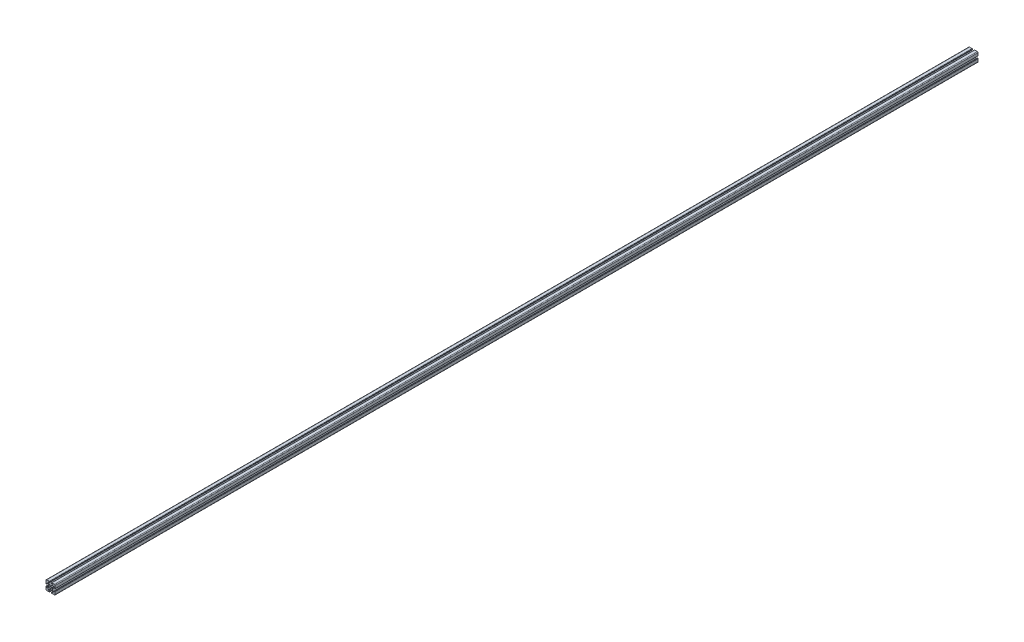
ISO-10303-21;
HEADER;
FILE_DESCRIPTION(('STEP AP214'),'2;1');
FILE_NAME('part.step','',(''),(''),'','','');
FILE_SCHEMA(('AUTOMOTIVE_DESIGN { 1 0 10303 214 1 1 1 1 }'));
ENDSEC;
DATA;
#1=APPLICATION_CONTEXT('core data for automotive mechanical design processes');
#2=APPLICATION_PROTOCOL_DEFINITION('international standard','automotive_design',2000,#1);
#3=PRODUCT_CONTEXT('',#1,'mechanical');
#4=PRODUCT('Part','Part','',(#3));
#5=PRODUCT_RELATED_PRODUCT_CATEGORY('part','',(#4));
#6=PRODUCT_DEFINITION_FORMATION('','',#4);
#7=PRODUCT_DEFINITION_CONTEXT('part definition',#1,'design');
#8=PRODUCT_DEFINITION('design','',#6,#7);
#9=PRODUCT_DEFINITION_SHAPE('','',#8);
#10=(LENGTH_UNIT() NAMED_UNIT(*) SI_UNIT(.MILLI.,.METRE.));
#11=(NAMED_UNIT(*) PLANE_ANGLE_UNIT() SI_UNIT($,.RADIAN.));
#12=(NAMED_UNIT(*) SI_UNIT($,.STERADIAN.) SOLID_ANGLE_UNIT());
#13=UNCERTAINTY_MEASURE_WITH_UNIT(LENGTH_MEASURE(1.E-05),#10,'distance_accuracy_value','');
#14=(GEOMETRIC_REPRESENTATION_CONTEXT(3) GLOBAL_UNCERTAINTY_ASSIGNED_CONTEXT((#13)) GLOBAL_UNIT_ASSIGNED_CONTEXT((#10,
#11,#12)) REPRESENTATION_CONTEXT('',''));
#15=CARTESIAN_POINT('',(0.,0.,0.));
#16=DIRECTION('',(0.,0.,1.));
#17=DIRECTION('',(1.,0.,0.));
#18=AXIS2_PLACEMENT_3D('',#15,#16,#17);
#19=CARTESIAN_POINT('',(-5.62999999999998,-17.0946150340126,-4000.));
#20=DIRECTION('',(0.,0.,1.));
#21=DIRECTION('',(1.,0.,0.));
#22=AXIS2_PLACEMENT_3D('',#19,#20,#21);
#23=CYLINDRICAL_SURFACE('',#22,1.56999999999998);
#24=CARTESIAN_POINT('',(-5.62999999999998,-17.0946150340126,0.));
#25=DIRECTION('',(0.,0.,1.));
#26=DIRECTION('',(-1.,0.,0.));
#27=AXIS2_PLACEMENT_3D('',#24,#25,#26);
#28=CIRCLE('',#27,1.56999999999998);
#29=CARTESIAN_POINT('',(-4.06,-17.0946150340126,0.));
#30=VERTEX_POINT('',#29);
#31=CARTESIAN_POINT('',(-5.62999999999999,-15.5246150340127,0.));
#32=VERTEX_POINT('',#31);
#33=EDGE_CURVE('E610',#30,#32,#28,.T.);
#34=ORIENTED_EDGE('',*,*,#33,.F.);
#35=DIRECTION('',(0.,0.,1.));
#36=VECTOR('',#35,1.);
#37=CARTESIAN_POINT('',(-4.06,-17.0946150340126,-4000.));
#38=LINE('',#37,#36);
#39=CARTESIAN_POINT('',(-4.06,-17.0946150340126,-4000.));
#40=VERTEX_POINT('',#39);
#41=EDGE_CURVE('E11',#40,#30,#38,.T.);
#42=ORIENTED_EDGE('',*,*,#41,.F.);
#43=CARTESIAN_POINT('',(-5.62999999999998,-17.0946150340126,-4000.));
#44=DIRECTION('',(0.,0.,1.));
#45=DIRECTION('',(-1.,0.,0.));
#46=AXIS2_PLACEMENT_3D('',#43,#44,#45);
#47=CIRCLE('',#46,1.56999999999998);
#48=CARTESIAN_POINT('',(-5.62999999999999,-15.5246150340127,-4000.));
#49=VERTEX_POINT('',#48);
#50=EDGE_CURVE('E871',#40,#49,#47,.T.);
#51=ORIENTED_EDGE('',*,*,#50,.T.);
#52=DIRECTION('',(0.,0.,1.));
#53=VECTOR('',#52,1.);
#54=CARTESIAN_POINT('',(-5.62999999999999,-15.5246150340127,-4000.));
#55=LINE('',#54,#53);
#56=EDGE_CURVE('E36',#49,#32,#55,.T.);
#57=ORIENTED_EDGE('',*,*,#56,.T.);
#58=EDGE_LOOP('',(#34,#42,#51,#57));
#59=FACE_BOUND('',#58,.T.);
#60=ADVANCED_FACE('F33',(#59),#23,.T.);
#61=CARTESIAN_POINT('',(-4.06,-18.43,-4000.));
#62=DIRECTION('',(1.,0.,0.));
#63=DIRECTION('',(0.,0.,-1.));
#64=AXIS2_PLACEMENT_3D('',#61,#62,#63);
#65=PLANE('',#64);
#66=DIRECTION('',(0.,1.,0.));
#67=VECTOR('',#66,1.);
#68=CARTESIAN_POINT('',(-4.06,-18.43,0.));
#69=LINE('',#68,#67);
#70=CARTESIAN_POINT('',(-4.05999999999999,-18.43,0.));
#71=VERTEX_POINT('',#70);
#72=EDGE_CURVE('E869',#71,#30,#69,.T.);
#73=ORIENTED_EDGE('',*,*,#72,.F.);
#74=DIRECTION('',(0.,0.,1.));
#75=VECTOR('',#74,1.);
#76=CARTESIAN_POINT('',(-4.05999999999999,-18.43,-4000.));
#77=LINE('',#76,#75);
#78=CARTESIAN_POINT('',(-4.05999999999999,-18.43,-4000.));
#79=VERTEX_POINT('',#78);
#80=EDGE_CURVE('E42',#79,#71,#77,.T.);
#81=ORIENTED_EDGE('',*,*,#80,.F.);
#82=DIRECTION('',(0.,1.,0.));
#83=VECTOR('',#82,1.);
#84=CARTESIAN_POINT('',(-4.06,-18.43,-4000.));
#85=LINE('',#84,#83);
#86=EDGE_CURVE('E600',#79,#40,#85,.T.);
#87=ORIENTED_EDGE('',*,*,#86,.T.);
#88=ORIENTED_EDGE('',*,*,#41,.T.);
#89=EDGE_LOOP('',(#73,#81,#87,#88));
#90=FACE_BOUND('',#89,.T.);
#91=ADVANCED_FACE('F1047',(#90),#65,.T.);
#92=CARTESIAN_POINT('',(-5.62999999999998,-18.43,-4000.));
#93=DIRECTION('',(0.,0.,1.));
#94=DIRECTION('',(1.,0.,0.));
#95=AXIS2_PLACEMENT_3D('',#92,#93,#94);
#96=CYLINDRICAL_SURFACE('',#95,1.56999999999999);
#97=CARTESIAN_POINT('',(-5.62999999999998,-18.43,0.));
#98=DIRECTION('',(0.,0.,1.));
#99=DIRECTION('',(-1.,0.,0.));
#100=AXIS2_PLACEMENT_3D('',#97,#98,#99);
#101=CIRCLE('',#100,1.56999999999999);
#102=CARTESIAN_POINT('',(-5.62999999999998,-20.,0.));
#103=VERTEX_POINT('',#102);
#104=EDGE_CURVE('E587',#103,#71,#101,.T.);
#105=ORIENTED_EDGE('',*,*,#104,.F.);
#106=DIRECTION('',(0.,0.,1.));
#107=VECTOR('',#106,1.);
#108=CARTESIAN_POINT('',(-5.62999999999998,-20.,-4000.));
#109=LINE('',#108,#107);
#110=CARTESIAN_POINT('',(-5.62999999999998,-20.,-4000.));
#111=VERTEX_POINT('',#110);
#112=EDGE_CURVE('E582',#111,#103,#109,.T.);
#113=ORIENTED_EDGE('',*,*,#112,.F.);
#114=CARTESIAN_POINT('',(-5.62999999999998,-18.43,-4000.));
#115=DIRECTION('',(0.,0.,1.));
#116=DIRECTION('',(-1.,0.,0.));
#117=AXIS2_PLACEMENT_3D('',#114,#115,#116);
#118=CIRCLE('',#117,1.56999999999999);
#119=EDGE_CURVE('E585',#111,#79,#118,.T.);
#120=ORIENTED_EDGE('',*,*,#119,.T.);
#121=ORIENTED_EDGE('',*,*,#80,.T.);
#122=EDGE_LOOP('',(#105,#113,#120,#121));
#123=FACE_BOUND('',#122,.T.);
#124=ADVANCED_FACE('F584',(#123),#96,.T.);
#125=CARTESIAN_POINT('',(-16.6746150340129,-20.,-4000.));
#126=DIRECTION('',(0.,-1.,0.));
#127=DIRECTION('',(1.,0.,0.));
#128=AXIS2_PLACEMENT_3D('',#125,#126,#127);
#129=PLANE('',#128);
#130=DIRECTION('',(1.,0.,0.));
#131=VECTOR('',#130,1.);
#132=CARTESIAN_POINT('',(-16.6746150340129,-20.,0.));
#133=LINE('',#132,#131);
#134=CARTESIAN_POINT('',(-16.6746150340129,-20.,0.));
#135=VERTEX_POINT('',#134);
#136=EDGE_CURVE('E866',#135,#103,#133,.T.);
#137=ORIENTED_EDGE('',*,*,#136,.F.);
#138=DIRECTION('',(0.,0.,1.));
#139=VECTOR('',#138,1.);
#140=CARTESIAN_POINT('',(-16.6746150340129,-20.,-4000.));
#141=LINE('',#140,#139);
#142=CARTESIAN_POINT('',(-16.6746150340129,-20.,-4000.));
#143=VERTEX_POINT('',#142);
#144=EDGE_CURVE('E592',#143,#135,#141,.T.);
#145=ORIENTED_EDGE('',*,*,#144,.F.);
#146=DIRECTION('',(1.,0.,0.));
#147=VECTOR('',#146,1.);
#148=CARTESIAN_POINT('',(-16.6746150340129,-20.,-4000.));
#149=LINE('',#148,#147);
#150=EDGE_CURVE('E598',#143,#111,#149,.T.);
#151=ORIENTED_EDGE('',*,*,#150,.T.);
#152=ORIENTED_EDGE('',*,*,#112,.T.);
#153=EDGE_LOOP('',(#137,#145,#151,#152));
#154=FACE_BOUND('',#153,.T.);
#155=ADVANCED_FACE('F602',(#154),#129,.T.);
#156=CARTESIAN_POINT('',(-16.8353614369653,-16.8340782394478,-4000.));
#157=DIRECTION('',(0.,0.,1.));
#158=DIRECTION('',(1.,0.,0.));
#159=AXIS2_PLACEMENT_3D('',#156,#157,#158);
#160=CYLINDRICAL_SURFACE('',#159,3.16999999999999);
#161=CARTESIAN_POINT('',(-16.8353614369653,-16.8340782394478,0.));
#162=DIRECTION('',(0.,0.,1.));
#163=DIRECTION('',(1.,0.,0.));
#164=AXIS2_PLACEMENT_3D('',#161,#162,#163);
#165=CIRCLE('',#164,3.16999999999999);
#166=CARTESIAN_POINT('',(-20.0000000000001,-17.0183681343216,0.));
#167=VERTEX_POINT('',#166);
#168=EDGE_CURVE('E863',#167,#135,#165,.T.);
#169=ORIENTED_EDGE('',*,*,#168,.F.);
#170=DIRECTION('',(0.,0.,1.));
#171=VECTOR('',#170,1.);
#172=CARTESIAN_POINT('',(-20.0000000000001,-17.0183681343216,-4000.));
#173=LINE('',#172,#171);
#174=CARTESIAN_POINT('',(-20.0000000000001,-17.0183681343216,-4000.));
#175=VERTEX_POINT('',#174);
#176=EDGE_CURVE('E875',#175,#167,#173,.T.);
#177=ORIENTED_EDGE('',*,*,#176,.F.);
#178=CARTESIAN_POINT('',(-16.8353614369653,-16.8340782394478,-4000.));
#179=DIRECTION('',(0.,0.,1.));
#180=DIRECTION('',(1.,0.,0.));
#181=AXIS2_PLACEMENT_3D('',#178,#179,#180);
#182=CIRCLE('',#181,3.16999999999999);
#183=EDGE_CURVE('E603',#175,#143,#182,.T.);
#184=ORIENTED_EDGE('',*,*,#183,.T.);
#185=ORIENTED_EDGE('',*,*,#144,.T.);
#186=EDGE_LOOP('',(#169,#177,#184,#185));
#187=FACE_BOUND('',#186,.T.);
#188=ADVANCED_FACE('F1060',(#187),#160,.T.);
#189=CARTESIAN_POINT('',(-20.0000000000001,-17.0183681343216,-4000.));
#190=DIRECTION('',(-1.,0.,0.));
#191=DIRECTION('',(0.,-1.,0.));
#192=AXIS2_PLACEMENT_3D('',#189,#190,#191);
#193=PLANE('',#192);
#194=DIRECTION('',(0.,-1.,0.));
#195=VECTOR('',#194,1.);
#196=CARTESIAN_POINT('',(-20.0000000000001,-17.0183681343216,0.));
#197=LINE('',#196,#195);
#198=CARTESIAN_POINT('',(-20.0000000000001,-5.75791880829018,0.));
#199=VERTEX_POINT('',#198);
#200=EDGE_CURVE('E860',#199,#167,#197,.T.);
#201=ORIENTED_EDGE('',*,*,#200,.F.);
#202=DIRECTION('',(0.,0.,1.));
#203=VECTOR('',#202,1.);
#204=CARTESIAN_POINT('',(-20.0000000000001,-5.75791880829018,-4000.));
#205=LINE('',#204,#203);
#206=CARTESIAN_POINT('',(-20.0000000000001,-5.75791880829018,-4000.));
#207=VERTEX_POINT('',#206);
#208=EDGE_CURVE('E877',#207,#199,#205,.T.);
#209=ORIENTED_EDGE('',*,*,#208,.F.);
#210=DIRECTION('',(0.,-1.,0.));
#211=VECTOR('',#210,1.);
#212=CARTESIAN_POINT('',(-20.0000000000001,-17.0183681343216,-4000.));
#213=LINE('',#212,#211);
#214=EDGE_CURVE('E605',#207,#175,#213,.T.);
#215=ORIENTED_EDGE('',*,*,#214,.T.);
#216=ORIENTED_EDGE('',*,*,#176,.T.);
#217=EDGE_LOOP('',(#201,#209,#215,#216));
#218=FACE_BOUND('',#217,.T.);
#219=ADVANCED_FACE('F1063',(#218),#193,.T.);
#220=CARTESIAN_POINT('',(-18.4314504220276,-5.69044865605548,-4000.));
#221=DIRECTION('',(0.,0.,1.));
#222=DIRECTION('',(1.,0.,0.));
#223=AXIS2_PLACEMENT_3D('',#220,#221,#222);
#224=CYLINDRICAL_SURFACE('',#223,1.57000000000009);
#225=CARTESIAN_POINT('',(-18.4314504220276,-5.69044865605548,0.));
#226=DIRECTION('',(0.,0.,1.));
#227=DIRECTION('',(1.,0.,0.));
#228=AXIS2_PLACEMENT_3D('',#225,#226,#227);
#229=CIRCLE('',#228,1.57000000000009);
#230=CARTESIAN_POINT('',(-18.43,-4.12044932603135,0.));
#231=VERTEX_POINT('',#230);
#232=EDGE_CURVE('E857',#231,#199,#229,.T.);
#233=ORIENTED_EDGE('',*,*,#232,.F.);
#234=DIRECTION('',(0.,0.,1.));
#235=VECTOR('',#234,1.);
#236=CARTESIAN_POINT('',(-18.43,-4.12044932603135,-4000.));
#237=LINE('',#236,#235);
#238=CARTESIAN_POINT('',(-18.43,-4.12044932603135,-4000.));
#239=VERTEX_POINT('',#238);
#240=EDGE_CURVE('E879',#239,#231,#237,.T.);
#241=ORIENTED_EDGE('',*,*,#240,.F.);
#242=CARTESIAN_POINT('',(-18.4314504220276,-5.69044865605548,-4000.));
#243=DIRECTION('',(0.,0.,1.));
#244=DIRECTION('',(1.,0.,0.));
#245=AXIS2_PLACEMENT_3D('',#242,#243,#244);
#246=CIRCLE('',#245,1.57000000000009);
#247=EDGE_CURVE('E1654',#239,#207,#246,.T.);
#248=ORIENTED_EDGE('',*,*,#247,.T.);
#249=ORIENTED_EDGE('',*,*,#208,.T.);
#250=EDGE_LOOP('',(#233,#241,#248,#249));
#251=FACE_BOUND('',#250,.T.);
#252=ADVANCED_FACE('F1067',(#251),#224,.T.);
#253=CARTESIAN_POINT('',(-17.25,-4.12044932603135,-4000.));
#254=DIRECTION('',(0.,1.,0.));
#255=DIRECTION('',(0.,0.,1.));
#256=AXIS2_PLACEMENT_3D('',#253,#254,#255);
#257=PLANE('',#256);
#258=DIRECTION('',(-1.,0.,0.));
#259=VECTOR('',#258,1.);
#260=CARTESIAN_POINT('',(-17.25,-4.12044932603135,0.));
#261=LINE('',#260,#259);
#262=CARTESIAN_POINT('',(-17.25,-4.12044932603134,0.));
#263=VERTEX_POINT('',#262);
#264=EDGE_CURVE('E854',#263,#231,#261,.T.);
#265=ORIENTED_EDGE('',*,*,#264,.F.);
#266=DIRECTION('',(0.,0.,1.));
#267=VECTOR('',#266,1.);
#268=CARTESIAN_POINT('',(-17.25,-4.12044932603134,-4000.));
#269=LINE('',#268,#267);
#270=CARTESIAN_POINT('',(-17.25,-4.12044932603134,-4000.));
#271=VERTEX_POINT('',#270);
#272=EDGE_CURVE('E881',#271,#263,#269,.T.);
#273=ORIENTED_EDGE('',*,*,#272,.F.);
#274=DIRECTION('',(-1.,0.,0.));
#275=VECTOR('',#274,1.);
#276=CARTESIAN_POINT('',(-17.25,-4.12044932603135,-4000.));
#277=LINE('',#276,#275);
#278=EDGE_CURVE('E1651',#271,#239,#277,.T.);
#279=ORIENTED_EDGE('',*,*,#278,.T.);
#280=ORIENTED_EDGE('',*,*,#240,.T.);
#281=EDGE_LOOP('',(#265,#273,#279,#280));
#282=FACE_BOUND('',#281,.T.);
#283=ADVANCED_FACE('F1071',(#282),#257,.T.);
#284=CARTESIAN_POINT('',(-17.2485458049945,-5.6904486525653,-4000.));
#285=DIRECTION('',(0.,0.,1.));
#286=DIRECTION('',(1.,0.,0.));
#287=AXIS2_PLACEMENT_3D('',#284,#285,#286);
#288=CYLINDRICAL_SURFACE('',#287,1.57000000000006);
#289=CARTESIAN_POINT('',(-17.2485458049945,-5.6904486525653,0.));
#290=DIRECTION('',(0.,0.,1.));
#291=DIRECTION('',(1.,0.,0.));
#292=AXIS2_PLACEMENT_3D('',#289,#290,#291);
#293=CIRCLE('',#292,1.57000000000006);
#294=CARTESIAN_POINT('',(-15.6799962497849,-5.75791933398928,0.));
#295=VERTEX_POINT('',#294);
#296=EDGE_CURVE('E851',#295,#263,#293,.T.);
#297=ORIENTED_EDGE('',*,*,#296,.F.);
#298=DIRECTION('',(0.,0.,1.));
#299=VECTOR('',#298,1.);
#300=CARTESIAN_POINT('',(-15.6799962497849,-5.75791933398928,-4000.));
#301=LINE('',#300,#299);
#302=CARTESIAN_POINT('',(-15.6799962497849,-5.75791933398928,-4000.));
#303=VERTEX_POINT('',#302);
#304=EDGE_CURVE('E883',#303,#295,#301,.T.);
#305=ORIENTED_EDGE('',*,*,#304,.F.);
#306=CARTESIAN_POINT('',(-17.2485458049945,-5.6904486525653,-4000.));
#307=DIRECTION('',(0.,0.,1.));
#308=DIRECTION('',(1.,0.,0.));
#309=AXIS2_PLACEMENT_3D('',#306,#307,#308);
#310=CIRCLE('',#309,1.57000000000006);
#311=EDGE_CURVE('E1648',#303,#271,#310,.T.);
#312=ORIENTED_EDGE('',*,*,#311,.T.);
#313=ORIENTED_EDGE('',*,*,#272,.T.);
#314=EDGE_LOOP('',(#297,#305,#312,#313));
#315=FACE_BOUND('',#314,.T.);
#316=ADVANCED_FACE('F1075',(#315),#288,.T.);
#317=CARTESIAN_POINT('',(-15.6799962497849,-8.71539949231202,-4000.));
#318=DIRECTION('',(1.,0.,0.));
#319=DIRECTION('',(0.,0.,-1.));
#320=AXIS2_PLACEMENT_3D('',#317,#318,#319);
#321=PLANE('',#320);
#322=DIRECTION('',(0.,1.,0.));
#323=VECTOR('',#322,1.);
#324=CARTESIAN_POINT('',(-15.6799962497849,-8.71539949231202,0.));
#325=LINE('',#324,#323);
#326=CARTESIAN_POINT('',(-15.6799962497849,-8.71539949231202,0.));
#327=VERTEX_POINT('',#326);
#328=EDGE_CURVE('E848',#327,#295,#325,.T.);
#329=ORIENTED_EDGE('',*,*,#328,.F.);
#330=DIRECTION('',(0.,0.,1.));
#331=VECTOR('',#330,1.);
#332=CARTESIAN_POINT('',(-15.6799962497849,-8.71539949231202,-4000.));
#333=LINE('',#332,#331);
#334=CARTESIAN_POINT('',(-15.6799962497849,-8.71539949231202,-4000.));
#335=VERTEX_POINT('',#334);
#336=EDGE_CURVE('E885',#335,#327,#333,.T.);
#337=ORIENTED_EDGE('',*,*,#336,.F.);
#338=DIRECTION('',(0.,1.,0.));
#339=VECTOR('',#338,1.);
#340=CARTESIAN_POINT('',(-15.6799962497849,-8.71539949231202,-4000.));
#341=LINE('',#340,#339);
#342=EDGE_CURVE('E1645',#335,#303,#341,.T.);
#343=ORIENTED_EDGE('',*,*,#342,.T.);
#344=ORIENTED_EDGE('',*,*,#304,.T.);
#345=EDGE_LOOP('',(#329,#337,#343,#344));
#346=FACE_BOUND('',#345,.T.);
#347=ADVANCED_FACE('F1079',(#346),#321,.T.);
#348=CARTESIAN_POINT('',(-14.1099962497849,-8.71539949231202,-4000.));
#349=DIRECTION('',(0.,0.,1.));
#350=DIRECTION('',(1.,0.,0.));
#351=AXIS2_PLACEMENT_3D('',#348,#349,#350);
#352=CYLINDRICAL_SURFACE('',#351,1.56999999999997);
#353=CARTESIAN_POINT('',(-14.1099962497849,-8.71539949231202,0.));
#354=DIRECTION('',(0.,0.,-1.));
#355=DIRECTION('',(1.,0.,0.));
#356=AXIS2_PLACEMENT_3D('',#353,#354,#355);
#357=CIRCLE('',#356,1.56999999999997);
#358=CARTESIAN_POINT('',(-14.1099962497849,-10.285399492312,0.));
#359=VERTEX_POINT('',#358);
#360=EDGE_CURVE('E845',#359,#327,#357,.T.);
#361=ORIENTED_EDGE('',*,*,#360,.F.);
#362=DIRECTION('',(0.,0.,1.));
#363=VECTOR('',#362,1.);
#364=CARTESIAN_POINT('',(-14.1099962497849,-10.285399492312,-4000.));
#365=LINE('',#364,#363);
#366=CARTESIAN_POINT('',(-14.1099962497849,-10.285399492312,-4000.));
#367=VERTEX_POINT('',#366);
#368=EDGE_CURVE('E887',#367,#359,#365,.T.);
#369=ORIENTED_EDGE('',*,*,#368,.F.);
#370=CARTESIAN_POINT('',(-14.1099962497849,-8.71539949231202,-4000.));
#371=DIRECTION('',(0.,0.,-1.));
#372=DIRECTION('',(1.,0.,0.));
#373=AXIS2_PLACEMENT_3D('',#370,#371,#372);
#374=CIRCLE('',#373,1.56999999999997);
#375=EDGE_CURVE('E1642',#367,#335,#374,.T.);
#376=ORIENTED_EDGE('',*,*,#375,.T.);
#377=ORIENTED_EDGE('',*,*,#336,.T.);
#378=EDGE_LOOP('',(#361,#369,#376,#377));
#379=FACE_BOUND('',#378,.T.);
#380=ADVANCED_FACE('F1083',(#379),#352,.F.);
#381=CARTESIAN_POINT('',(-14.1099962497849,-10.285399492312,-4000.));
#382=DIRECTION('',(0.,1.,0.));
#383=DIRECTION('',(0.,0.,1.));
#384=AXIS2_PLACEMENT_3D('',#381,#382,#383);
#385=PLANE('',#384);
#386=DIRECTION('',(-1.,0.,0.));
#387=VECTOR('',#386,1.);
#388=CARTESIAN_POINT('',(-14.1099962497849,-10.285399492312,0.));
#389=LINE('',#388,#387);
#390=CARTESIAN_POINT('',(-13.8168988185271,-10.285399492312,0.));
#391=VERTEX_POINT('',#390);
#392=EDGE_CURVE('E842',#391,#359,#389,.T.);
#393=ORIENTED_EDGE('',*,*,#392,.F.);
#394=DIRECTION('',(0.,0.,1.));
#395=VECTOR('',#394,1.);
#396=CARTESIAN_POINT('',(-13.8168988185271,-10.285399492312,-4000.));
#397=LINE('',#396,#395);
#398=CARTESIAN_POINT('',(-13.8168988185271,-10.285399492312,-4000.));
#399=VERTEX_POINT('',#398);
#400=EDGE_CURVE('E889',#399,#391,#397,.T.);
#401=ORIENTED_EDGE('',*,*,#400,.F.);
#402=DIRECTION('',(-1.,0.,0.));
#403=VECTOR('',#402,1.);
#404=CARTESIAN_POINT('',(-14.1099962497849,-10.285399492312,-4000.));
#405=LINE('',#404,#403);
#406=EDGE_CURVE('E1639',#399,#367,#405,.T.);
#407=ORIENTED_EDGE('',*,*,#406,.T.);
#408=ORIENTED_EDGE('',*,*,#368,.T.);
#409=EDGE_LOOP('',(#393,#401,#407,#408));
#410=FACE_BOUND('',#409,.T.);
#411=ADVANCED_FACE('F1087',(#410),#385,.T.);
#412=CARTESIAN_POINT('',(-13.8169030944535,-9.52539949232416,-4000.));
#413=DIRECTION('',(0.,0.,1.));
#414=DIRECTION('',(1.,0.,0.));
#415=AXIS2_PLACEMENT_3D('',#412,#413,#414);
#416=CYLINDRICAL_SURFACE('',#415,0.759999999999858);
#417=CARTESIAN_POINT('',(-13.8169030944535,-9.52539949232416,0.));
#418=DIRECTION('',(0.,0.,-1.));
#419=DIRECTION('',(1.,0.,0.));
#420=AXIS2_PLACEMENT_3D('',#417,#418,#419);
#421=CIRCLE('',#420,0.759999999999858);
#422=CARTESIAN_POINT('',(-13.2795019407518,-10.0628006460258,0.));
#423=VERTEX_POINT('',#422);
#424=EDGE_CURVE('E839',#423,#391,#421,.T.);
#425=ORIENTED_EDGE('',*,*,#424,.F.);
#426=DIRECTION('',(0.,0.,1.));
#427=VECTOR('',#426,1.);
#428=CARTESIAN_POINT('',(-13.2795019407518,-10.0628006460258,-4000.));
#429=LINE('',#428,#427);
#430=CARTESIAN_POINT('',(-13.2795019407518,-10.0628006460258,-4000.));
#431=VERTEX_POINT('',#430);
#432=EDGE_CURVE('E891',#431,#423,#429,.T.);
#433=ORIENTED_EDGE('',*,*,#432,.F.);
#434=CARTESIAN_POINT('',(-13.8169030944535,-9.52539949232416,-4000.));
#435=DIRECTION('',(0.,0.,-1.));
#436=DIRECTION('',(1.,0.,0.));
#437=AXIS2_PLACEMENT_3D('',#434,#435,#436);
#438=CIRCLE('',#437,0.759999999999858);
#439=EDGE_CURVE('E1636',#431,#399,#438,.T.);
#440=ORIENTED_EDGE('',*,*,#439,.T.);
#441=ORIENTED_EDGE('',*,*,#400,.T.);
#442=EDGE_LOOP('',(#425,#433,#440,#441));
#443=FACE_BOUND('',#442,.T.);
#444=ADVANCED_FACE('F1091',(#443),#416,.F.);
#445=CARTESIAN_POINT('',(-9.0762427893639,-5.85954149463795,-4000.));
#446=DIRECTION('',(-0.707106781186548,0.707106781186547,0.));
#447=DIRECTION('',(-0.707106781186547,-0.707106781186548,0.));
#448=AXIS2_PLACEMENT_3D('',#445,#446,#447);
#449=PLANE('',#448);
#450=DIRECTION('',(-0.707106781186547,-0.707106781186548,0.));
#451=VECTOR('',#450,1.);
#452=CARTESIAN_POINT('',(-9.0762427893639,-5.85954149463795,0.));
#453=LINE('',#452,#451);
#454=CARTESIAN_POINT('',(-9.0762427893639,-5.85954149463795,0.));
#455=VERTEX_POINT('',#454);
#456=EDGE_CURVE('E836',#455,#423,#453,.T.);
#457=ORIENTED_EDGE('',*,*,#456,.F.);
#458=DIRECTION('',(0.,0.,1.));
#459=VECTOR('',#458,1.);
#460=CARTESIAN_POINT('',(-9.0762427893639,-5.85954149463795,-4000.));
#461=LINE('',#460,#459);
#462=CARTESIAN_POINT('',(-9.0762427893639,-5.85954149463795,-4000.));
#463=VERTEX_POINT('',#462);
#464=EDGE_CURVE('E893',#463,#455,#461,.T.);
#465=ORIENTED_EDGE('',*,*,#464,.F.);
#466=DIRECTION('',(-0.707106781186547,-0.707106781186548,0.));
#467=VECTOR('',#466,1.);
#468=CARTESIAN_POINT('',(-9.0762427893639,-5.85954149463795,-4000.));
#469=LINE('',#468,#467);
#470=EDGE_CURVE('E1633',#463,#431,#469,.T.);
#471=ORIENTED_EDGE('',*,*,#470,.T.);
#472=ORIENTED_EDGE('',*,*,#432,.T.);
#473=EDGE_LOOP('',(#457,#465,#471,#472));
#474=FACE_BOUND('',#473,.T.);
#475=ADVANCED_FACE('F1095',(#474),#449,.T.);
#476=CARTESIAN_POINT('',(-12.435,-2.50078428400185,-4000.));
#477=DIRECTION('',(0.,0.,1.));
#478=DIRECTION('',(1.,0.,0.));
#479=AXIS2_PLACEMENT_3D('',#476,#477,#478);
#480=CYLINDRICAL_SURFACE('',#479,4.75);
#481=CARTESIAN_POINT('',(-12.435,-2.50078428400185,0.));
#482=DIRECTION('',(0.,0.,-1.));
#483=DIRECTION('',(1.,0.,0.));
#484=AXIS2_PLACEMENT_3D('',#481,#482,#483);
#485=CIRCLE('',#484,4.75);
#486=CARTESIAN_POINT('',(-7.685,-2.50078428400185,0.));
#487=VERTEX_POINT('',#486);
#488=EDGE_CURVE('E833',#487,#455,#485,.T.);
#489=ORIENTED_EDGE('',*,*,#488,.F.);
#490=DIRECTION('',(0.,0.,1.));
#491=VECTOR('',#490,1.);
#492=CARTESIAN_POINT('',(-7.685,-2.50078428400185,-4000.));
#493=LINE('',#492,#491);
#494=CARTESIAN_POINT('',(-7.685,-2.50078428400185,-4000.));
#495=VERTEX_POINT('',#494);
#496=EDGE_CURVE('E895',#495,#487,#493,.T.);
#497=ORIENTED_EDGE('',*,*,#496,.F.);
#498=CARTESIAN_POINT('',(-12.435,-2.50078428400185,-4000.));
#499=DIRECTION('',(0.,0.,-1.));
#500=DIRECTION('',(1.,0.,0.));
#501=AXIS2_PLACEMENT_3D('',#498,#499,#500);
#502=CIRCLE('',#501,4.75);
#503=EDGE_CURVE('E1630',#495,#463,#502,.T.);
#504=ORIENTED_EDGE('',*,*,#503,.T.);
#505=ORIENTED_EDGE('',*,*,#464,.T.);
#506=EDGE_LOOP('',(#489,#497,#504,#505));
#507=FACE_BOUND('',#506,.T.);
#508=ADVANCED_FACE('F1099',(#507),#480,.F.);
#509=CARTESIAN_POINT('',(-7.685,2.50078428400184,-4000.));
#510=DIRECTION('',(-1.,0.,0.));
#511=DIRECTION('',(0.,-1.,0.));
#512=AXIS2_PLACEMENT_3D('',#509,#510,#511);
#513=PLANE('',#512);
#514=DIRECTION('',(0.,-1.,0.));
#515=VECTOR('',#514,1.);
#516=CARTESIAN_POINT('',(-7.685,2.50078428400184,0.));
#517=LINE('',#516,#515);
#518=CARTESIAN_POINT('',(-7.685,2.50078428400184,0.));
#519=VERTEX_POINT('',#518);
#520=EDGE_CURVE('E830',#519,#487,#517,.T.);
#521=ORIENTED_EDGE('',*,*,#520,.F.);
#522=DIRECTION('',(0.,0.,1.));
#523=VECTOR('',#522,1.);
#524=CARTESIAN_POINT('',(-7.685,2.50078428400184,-4000.));
#525=LINE('',#524,#523);
#526=CARTESIAN_POINT('',(-7.685,2.50078428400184,-4000.));
#527=VERTEX_POINT('',#526);
#528=EDGE_CURVE('E897',#527,#519,#525,.T.);
#529=ORIENTED_EDGE('',*,*,#528,.F.);
#530=DIRECTION('',(0.,-1.,0.));
#531=VECTOR('',#530,1.);
#532=CARTESIAN_POINT('',(-7.685,2.50078428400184,-4000.));
#533=LINE('',#532,#531);
#534=EDGE_CURVE('E1627',#527,#495,#533,.T.);
#535=ORIENTED_EDGE('',*,*,#534,.T.);
#536=ORIENTED_EDGE('',*,*,#496,.T.);
#537=EDGE_LOOP('',(#521,#529,#535,#536));
#538=FACE_BOUND('',#537,.T.);
#539=ADVANCED_FACE('F1103',(#538),#513,.T.);
#540=CARTESIAN_POINT('',(-12.435,2.50078428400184,-4000.));
#541=DIRECTION('',(0.,0.,1.));
#542=DIRECTION('',(1.,0.,0.));
#543=AXIS2_PLACEMENT_3D('',#540,#541,#542);
#544=CYLINDRICAL_SURFACE('',#543,4.75);
#545=CARTESIAN_POINT('',(-12.435,2.50078428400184,0.));
#546=DIRECTION('',(0.,0.,-1.));
#547=DIRECTION('',(1.,0.,0.));
#548=AXIS2_PLACEMENT_3D('',#545,#546,#547);
#549=CIRCLE('',#548,4.75);
#550=CARTESIAN_POINT('',(-9.0762427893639,5.85954149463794,0.));
#551=VERTEX_POINT('',#550);
#552=EDGE_CURVE('E827',#551,#519,#549,.T.);
#553=ORIENTED_EDGE('',*,*,#552,.F.);
#554=DIRECTION('',(0.,0.,1.));
#555=VECTOR('',#554,1.);
#556=CARTESIAN_POINT('',(-9.0762427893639,5.85954149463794,-4000.));
#557=LINE('',#556,#555);
#558=CARTESIAN_POINT('',(-9.0762427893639,5.85954149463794,-4000.));
#559=VERTEX_POINT('',#558);
#560=EDGE_CURVE('E899',#559,#551,#557,.T.);
#561=ORIENTED_EDGE('',*,*,#560,.F.);
#562=CARTESIAN_POINT('',(-12.435,2.50078428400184,-4000.));
#563=DIRECTION('',(0.,0.,-1.));
#564=DIRECTION('',(1.,0.,0.));
#565=AXIS2_PLACEMENT_3D('',#562,#563,#564);
#566=CIRCLE('',#565,4.75);
#567=EDGE_CURVE('E1624',#559,#527,#566,.T.);
#568=ORIENTED_EDGE('',*,*,#567,.T.);
#569=ORIENTED_EDGE('',*,*,#528,.T.);
#570=EDGE_LOOP('',(#553,#561,#568,#569));
#571=FACE_BOUND('',#570,.T.);
#572=ADVANCED_FACE('F1107',(#571),#544,.F.);
#573=CARTESIAN_POINT('',(-13.0404891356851,9.82378784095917,-4000.));
#574=DIRECTION('',(-0.707106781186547,-0.707106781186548,0.));
#575=DIRECTION('',(0.707106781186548,-0.707106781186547,0.));
#576=AXIS2_PLACEMENT_3D('',#573,#574,#575);
#577=PLANE('',#576);
#578=DIRECTION('',(0.707106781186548,-0.707106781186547,0.));
#579=VECTOR('',#578,1.);
#580=CARTESIAN_POINT('',(-13.0404891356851,9.82378784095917,0.));
#581=LINE('',#580,#579);
#582=CARTESIAN_POINT('',(-13.0404891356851,9.82378784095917,0.));
#583=VERTEX_POINT('',#582);
#584=EDGE_CURVE('E824',#583,#551,#581,.T.);
#585=ORIENTED_EDGE('',*,*,#584,.F.);
#586=DIRECTION('',(0.,0.,1.));
#587=VECTOR('',#586,1.);
#588=CARTESIAN_POINT('',(-13.0404891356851,9.82378784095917,-4000.));
#589=LINE('',#588,#587);
#590=CARTESIAN_POINT('',(-13.0404891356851,9.82378784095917,-4000.));
#591=VERTEX_POINT('',#590);
#592=EDGE_CURVE('E901',#591,#583,#589,.T.);
#593=ORIENTED_EDGE('',*,*,#592,.F.);
#594=DIRECTION('',(0.707106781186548,-0.707106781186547,0.));
#595=VECTOR('',#594,1.);
#596=CARTESIAN_POINT('',(-13.0404891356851,9.82378784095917,-4000.));
#597=LINE('',#596,#595);
#598=EDGE_CURVE('E1621',#591,#559,#597,.T.);
#599=ORIENTED_EDGE('',*,*,#598,.T.);
#600=ORIENTED_EDGE('',*,*,#560,.T.);
#601=EDGE_LOOP('',(#585,#593,#599,#600));
#602=FACE_BOUND('',#601,.T.);
#603=ADVANCED_FACE('F1111',(#602),#577,.T.);
#604=CARTESIAN_POINT('',(-13.577890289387,9.28638668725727,-4000.));
#605=DIRECTION('',(0.,0.,1.));
#606=DIRECTION('',(1.,0.,0.));
#607=AXIS2_PLACEMENT_3D('',#604,#605,#606);
#608=CYLINDRICAL_SURFACE('',#607,0.760000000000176);
#609=CARTESIAN_POINT('',(-13.577890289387,9.28638668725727,0.));
#610=DIRECTION('',(0.,0.,-1.));
#611=DIRECTION('',(1.,0.,0.));
#612=AXIS2_PLACEMENT_3D('',#609,#610,#611);
#613=CIRCLE('',#612,0.760000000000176);
#614=CARTESIAN_POINT('',(-13.7198991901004,10.0330013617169,0.));
#615=VERTEX_POINT('',#614);
#616=EDGE_CURVE('E821',#615,#583,#613,.T.);
#617=ORIENTED_EDGE('',*,*,#616,.F.);
#618=DIRECTION('',(0.,0.,1.));
#619=VECTOR('',#618,1.);
#620=CARTESIAN_POINT('',(-13.7198991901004,10.0330013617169,-4000.));
#621=LINE('',#620,#619);
#622=CARTESIAN_POINT('',(-13.7198991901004,10.0330013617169,-4000.));
#623=VERTEX_POINT('',#622);
#624=EDGE_CURVE('E903',#623,#615,#621,.T.);
#625=ORIENTED_EDGE('',*,*,#624,.F.);
#626=CARTESIAN_POINT('',(-13.577890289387,9.28638668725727,-4000.));
#627=DIRECTION('',(0.,0.,-1.));
#628=DIRECTION('',(1.,0.,0.));
#629=AXIS2_PLACEMENT_3D('',#626,#627,#628);
#630=CIRCLE('',#629,0.760000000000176);
#631=EDGE_CURVE('E1618',#623,#591,#630,.T.);
#632=ORIENTED_EDGE('',*,*,#631,.T.);
#633=ORIENTED_EDGE('',*,*,#592,.T.);
#634=EDGE_LOOP('',(#617,#625,#632,#633));
#635=FACE_BOUND('',#634,.T.);
#636=ADVANCED_FACE('F1115',(#635),#608,.F.);
#637=CARTESIAN_POINT('',(-14.0552077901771,10.0447105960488,-4000.));
#638=DIRECTION('',(-0.0348994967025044,-0.999390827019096,0.));
#639=DIRECTION('',(0.999390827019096,-0.0348994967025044,0.));
#640=AXIS2_PLACEMENT_3D('',#637,#638,#639);
#641=PLANE('',#640);
#642=DIRECTION('',(0.999390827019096,-0.0348994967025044,0.));
#643=VECTOR('',#642,1.);
#644=CARTESIAN_POINT('',(-14.0552077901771,10.0447105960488,0.));
#645=LINE('',#644,#643);
#646=CARTESIAN_POINT('',(-14.0552077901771,10.0447105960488,0.));
#647=VERTEX_POINT('',#646);
#648=EDGE_CURVE('E818',#647,#615,#645,.T.);
#649=ORIENTED_EDGE('',*,*,#648,.F.);
#650=DIRECTION('',(0.,0.,1.));
#651=VECTOR('',#650,1.);
#652=CARTESIAN_POINT('',(-14.0552077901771,10.0447105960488,-4000.));
#653=LINE('',#652,#651);
#654=CARTESIAN_POINT('',(-14.0552077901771,10.0447105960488,-4000.));
#655=VERTEX_POINT('',#654);
#656=EDGE_CURVE('E905',#655,#647,#653,.T.);
#657=ORIENTED_EDGE('',*,*,#656,.F.);
#658=DIRECTION('',(0.999390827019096,-0.0348994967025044,0.));
#659=VECTOR('',#658,1.);
#660=CARTESIAN_POINT('',(-14.0552077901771,10.0447105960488,-4000.));
#661=LINE('',#660,#659);
#662=EDGE_CURVE('E1615',#655,#623,#661,.T.);
#663=ORIENTED_EDGE('',*,*,#662,.T.);
#664=ORIENTED_EDGE('',*,*,#624,.T.);
#665=EDGE_LOOP('',(#649,#657,#663,#664));
#666=FACE_BOUND('',#665,.T.);
#667=ADVANCED_FACE('F1119',(#666),#641,.T.);
#668=CARTESIAN_POINT('',(-14.11,8.47566699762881,-4000.));
#669=DIRECTION('',(0.,0.,1.));
#670=DIRECTION('',(1.,0.,0.));
#671=AXIS2_PLACEMENT_3D('',#668,#669,#670);
#672=CYLINDRICAL_SURFACE('',#671,1.56999999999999);
#673=CARTESIAN_POINT('',(-14.11,8.47566699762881,0.));
#674=DIRECTION('',(0.,0.,-1.));
#675=DIRECTION('',(1.,0.,0.));
#676=AXIS2_PLACEMENT_3D('',#673,#674,#675);
#677=CIRCLE('',#676,1.56999999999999);
#678=CARTESIAN_POINT('',(-15.68,8.47566699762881,0.));
#679=VERTEX_POINT('',#678);
#680=EDGE_CURVE('E815',#679,#647,#677,.T.);
#681=ORIENTED_EDGE('',*,*,#680,.F.);
#682=DIRECTION('',(0.,0.,1.));
#683=VECTOR('',#682,1.);
#684=CARTESIAN_POINT('',(-15.68,8.47566699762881,-4000.));
#685=LINE('',#684,#683);
#686=CARTESIAN_POINT('',(-15.68,8.47566699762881,-4000.));
#687=VERTEX_POINT('',#686);
#688=EDGE_CURVE('E907',#687,#679,#685,.T.);
#689=ORIENTED_EDGE('',*,*,#688,.F.);
#690=CARTESIAN_POINT('',(-14.11,8.47566699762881,-4000.));
#691=DIRECTION('',(0.,0.,-1.));
#692=DIRECTION('',(1.,0.,0.));
#693=AXIS2_PLACEMENT_3D('',#690,#691,#692);
#694=CIRCLE('',#693,1.56999999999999);
#695=EDGE_CURVE('E1612',#687,#655,#694,.T.);
#696=ORIENTED_EDGE('',*,*,#695,.T.);
#697=ORIENTED_EDGE('',*,*,#656,.T.);
#698=EDGE_LOOP('',(#681,#689,#696,#697));
#699=FACE_BOUND('',#698,.T.);
#700=ADVANCED_FACE('F1123',(#699),#672,.F.);
#701=CARTESIAN_POINT('',(-15.68,5.57297904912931,-4000.));
#702=DIRECTION('',(1.,0.,0.));
#703=DIRECTION('',(0.,1.,0.));
#704=AXIS2_PLACEMENT_3D('',#701,#702,#703);
#705=PLANE('',#704);
#706=DIRECTION('',(0.,1.,0.));
#707=VECTOR('',#706,1.);
#708=CARTESIAN_POINT('',(-15.68,5.57297904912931,0.));
#709=LINE('',#708,#707);
#710=CARTESIAN_POINT('',(-15.68,5.57297904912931,0.));
#711=VERTEX_POINT('',#710);
#712=EDGE_CURVE('E812',#711,#679,#709,.T.);
#713=ORIENTED_EDGE('',*,*,#712,.F.);
#714=DIRECTION('',(0.,0.,1.));
#715=VECTOR('',#714,1.);
#716=CARTESIAN_POINT('',(-15.68,5.57297904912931,-4000.));
#717=LINE('',#716,#715);
#718=CARTESIAN_POINT('',(-15.68,5.57297904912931,-4000.));
#719=VERTEX_POINT('',#718);
#720=EDGE_CURVE('E909',#719,#711,#717,.T.);
#721=ORIENTED_EDGE('',*,*,#720,.F.);
#722=DIRECTION('',(0.,1.,0.));
#723=VECTOR('',#722,1.);
#724=CARTESIAN_POINT('',(-15.68,5.57297904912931,-4000.));
#725=LINE('',#724,#723);
#726=EDGE_CURVE('E1609',#719,#687,#725,.T.);
#727=ORIENTED_EDGE('',*,*,#726,.T.);
#728=ORIENTED_EDGE('',*,*,#688,.T.);
#729=EDGE_LOOP('',(#713,#721,#727,#728));
#730=FACE_BOUND('',#729,.T.);
#731=ADVANCED_FACE('F1127',(#730),#705,.T.);
#732=CARTESIAN_POINT('',(-17.25,5.5729790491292,-4000.));
#733=DIRECTION('',(0.,0.,1.));
#734=DIRECTION('',(1.,0.,0.));
#735=AXIS2_PLACEMENT_3D('',#732,#733,#734);
#736=CYLINDRICAL_SURFACE('',#735,1.56999999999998);
#737=CARTESIAN_POINT('',(-17.25,5.5729790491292,0.));
#738=DIRECTION('',(0.,0.,1.));
#739=DIRECTION('',(1.,0.,0.));
#740=AXIS2_PLACEMENT_3D('',#737,#738,#739);
#741=CIRCLE('',#740,1.56999999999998);
#742=CARTESIAN_POINT('',(-17.25,4.00297904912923,0.));
#743=VERTEX_POINT('',#742);
#744=EDGE_CURVE('E809',#743,#711,#741,.T.);
#745=ORIENTED_EDGE('',*,*,#744,.F.);
#746=DIRECTION('',(0.,0.,1.));
#747=VECTOR('',#746,1.);
#748=CARTESIAN_POINT('',(-17.25,4.00297904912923,-4000.));
#749=LINE('',#748,#747);
#750=CARTESIAN_POINT('',(-17.25,4.00297904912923,-4000.));
#751=VERTEX_POINT('',#750);
#752=EDGE_CURVE('E911',#751,#743,#749,.T.);
#753=ORIENTED_EDGE('',*,*,#752,.F.);
#754=CARTESIAN_POINT('',(-17.25,5.5729790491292,-4000.));
#755=DIRECTION('',(0.,0.,1.));
#756=DIRECTION('',(1.,0.,0.));
#757=AXIS2_PLACEMENT_3D('',#754,#755,#756);
#758=CIRCLE('',#757,1.56999999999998);
#759=EDGE_CURVE('E1606',#751,#719,#758,.T.);
#760=ORIENTED_EDGE('',*,*,#759,.T.);
#761=ORIENTED_EDGE('',*,*,#720,.T.);
#762=EDGE_LOOP('',(#745,#753,#760,#761));
#763=FACE_BOUND('',#762,.T.);
#764=ADVANCED_FACE('F1131',(#763),#736,.T.);
#765=CARTESIAN_POINT('',(-18.43,4.00297904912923,-4000.));
#766=DIRECTION('',(0.,-1.,0.));
#767=DIRECTION('',(1.,0.,0.));
#768=AXIS2_PLACEMENT_3D('',#765,#766,#767);
#769=PLANE('',#768);
#770=DIRECTION('',(1.,0.,0.));
#771=VECTOR('',#770,1.);
#772=CARTESIAN_POINT('',(-18.43,4.00297904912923,0.));
#773=LINE('',#772,#771);
#774=CARTESIAN_POINT('',(-18.43,4.00297904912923,0.));
#775=VERTEX_POINT('',#774);
#776=EDGE_CURVE('E806',#775,#743,#773,.T.);
#777=ORIENTED_EDGE('',*,*,#776,.F.);
#778=DIRECTION('',(0.,0.,1.));
#779=VECTOR('',#778,1.);
#780=CARTESIAN_POINT('',(-18.43,4.00297904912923,-4000.));
#781=LINE('',#780,#779);
#782=CARTESIAN_POINT('',(-18.43,4.00297904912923,-4000.));
#783=VERTEX_POINT('',#782);
#784=EDGE_CURVE('E913',#783,#775,#781,.T.);
#785=ORIENTED_EDGE('',*,*,#784,.F.);
#786=DIRECTION('',(1.,0.,0.));
#787=VECTOR('',#786,1.);
#788=CARTESIAN_POINT('',(-18.43,4.00297904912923,-4000.));
#789=LINE('',#788,#787);
#790=EDGE_CURVE('E1603',#783,#751,#789,.T.);
#791=ORIENTED_EDGE('',*,*,#790,.T.);
#792=ORIENTED_EDGE('',*,*,#752,.T.);
#793=EDGE_LOOP('',(#777,#785,#791,#792));
#794=FACE_BOUND('',#793,.T.);
#795=ADVANCED_FACE('F1135',(#794),#769,.T.);
#796=CARTESIAN_POINT('',(-18.43,5.57297904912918,-4000.));
#797=DIRECTION('',(0.,0.,1.));
#798=DIRECTION('',(1.,0.,0.));
#799=AXIS2_PLACEMENT_3D('',#796,#797,#798);
#800=CYLINDRICAL_SURFACE('',#799,1.56999999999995);
#801=CARTESIAN_POINT('',(-18.43,5.57297904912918,0.));
#802=DIRECTION('',(0.,0.,1.));
#803=DIRECTION('',(1.,0.,0.));
#804=AXIS2_PLACEMENT_3D('',#801,#802,#803);
#805=CIRCLE('',#804,1.56999999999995);
#806=CARTESIAN_POINT('',(-20.,5.57297904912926,0.));
#807=VERTEX_POINT('',#806);
#808=EDGE_CURVE('E803',#807,#775,#805,.T.);
#809=ORIENTED_EDGE('',*,*,#808,.F.);
#810=DIRECTION('',(0.,0.,1.));
#811=VECTOR('',#810,1.);
#812=CARTESIAN_POINT('',(-20.,5.57297904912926,-4000.));
#813=LINE('',#812,#811);
#814=CARTESIAN_POINT('',(-20.,5.57297904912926,-4000.));
#815=VERTEX_POINT('',#814);
#816=EDGE_CURVE('E915',#815,#807,#813,.T.);
#817=ORIENTED_EDGE('',*,*,#816,.F.);
#818=CARTESIAN_POINT('',(-18.43,5.57297904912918,-4000.));
#819=DIRECTION('',(0.,0.,1.));
#820=DIRECTION('',(1.,0.,0.));
#821=AXIS2_PLACEMENT_3D('',#818,#819,#820);
#822=CIRCLE('',#821,1.56999999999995);
#823=EDGE_CURVE('E1600',#815,#783,#822,.T.);
#824=ORIENTED_EDGE('',*,*,#823,.T.);
#825=ORIENTED_EDGE('',*,*,#784,.T.);
#826=EDGE_LOOP('',(#809,#817,#824,#825));
#827=FACE_BOUND('',#826,.T.);
#828=ADVANCED_FACE('F1139',(#827),#800,.T.);
#829=CARTESIAN_POINT('',(-20.,5.57297904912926,-4000.));
#830=DIRECTION('',(-1.,0.,0.));
#831=DIRECTION('',(0.,-1.,0.));
#832=AXIS2_PLACEMENT_3D('',#829,#830,#831);
#833=PLANE('',#832);
#834=DIRECTION('',(0.,-1.,0.));
#835=VECTOR('',#834,1.);
#836=CARTESIAN_POINT('',(-20.,5.57297904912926,0.));
#837=LINE('',#836,#835);
#838=CARTESIAN_POINT('',(-20.,16.83,0.));
#839=VERTEX_POINT('',#838);
#840=EDGE_CURVE('E800',#839,#807,#837,.T.);
#841=ORIENTED_EDGE('',*,*,#840,.F.);
#842=DIRECTION('',(0.,0.,1.));
#843=VECTOR('',#842,1.);
#844=CARTESIAN_POINT('',(-20.,16.83,-4000.));
#845=LINE('',#844,#843);
#846=CARTESIAN_POINT('',(-20.,16.83,-4000.));
#847=VERTEX_POINT('',#846);
#848=EDGE_CURVE('E917',#847,#839,#845,.T.);
#849=ORIENTED_EDGE('',*,*,#848,.F.);
#850=DIRECTION('',(0.,-1.,0.));
#851=VECTOR('',#850,1.);
#852=CARTESIAN_POINT('',(-20.,16.83,-4000.));
#853=LINE('',#852,#851);
#854=EDGE_CURVE('E1598',#847,#815,#853,.T.);
#855=ORIENTED_EDGE('',*,*,#854,.T.);
#856=ORIENTED_EDGE('',*,*,#816,.T.);
#857=EDGE_LOOP('',(#841,#849,#855,#856));
#858=FACE_BOUND('',#857,.T.);
#859=ADVANCED_FACE('F1143',(#858),#833,.T.);
#860=CARTESIAN_POINT('',(-16.83,16.83,-4000.));
#861=DIRECTION('',(0.,0.,1.));
#862=DIRECTION('',(1.,0.,0.));
#863=AXIS2_PLACEMENT_3D('',#860,#861,#862);
#864=CYLINDRICAL_SURFACE('',#863,3.16999999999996);
#865=CARTESIAN_POINT('',(-16.83,16.83,0.));
#866=DIRECTION('',(0.,0.,1.));
#867=DIRECTION('',(1.,0.,0.));
#868=AXIS2_PLACEMENT_3D('',#865,#866,#867);
#869=CIRCLE('',#868,3.16999999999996);
#870=CARTESIAN_POINT('',(-16.83,20.,0.));
#871=VERTEX_POINT('',#870);
#872=EDGE_CURVE('E797',#871,#839,#869,.T.);
#873=ORIENTED_EDGE('',*,*,#872,.F.);
#874=DIRECTION('',(0.,0.,1.));
#875=VECTOR('',#874,1.);
#876=CARTESIAN_POINT('',(-16.83,20.,-4000.));
#877=LINE('',#876,#875);
#878=CARTESIAN_POINT('',(-16.83,20.,-4000.));
#879=VERTEX_POINT('',#878);
#880=EDGE_CURVE('E920',#879,#871,#877,.T.);
#881=ORIENTED_EDGE('',*,*,#880,.F.);
#882=CARTESIAN_POINT('',(-16.83,16.83,-4000.));
#883=DIRECTION('',(0.,0.,1.));
#884=DIRECTION('',(1.,0.,0.));
#885=AXIS2_PLACEMENT_3D('',#882,#883,#884);
#886=CIRCLE('',#885,3.16999999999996);
#887=EDGE_CURVE('E1595',#879,#847,#886,.T.);
#888=ORIENTED_EDGE('',*,*,#887,.T.);
#889=ORIENTED_EDGE('',*,*,#848,.T.);
#890=EDGE_LOOP('',(#873,#881,#888,#889));
#891=FACE_BOUND('',#890,.T.);
#892=ADVANCED_FACE('F1147',(#891),#864,.T.);
#893=CARTESIAN_POINT('',(-16.83,20.,-4000.));
#894=DIRECTION('',(0.,1.,0.));
#895=DIRECTION('',(-1.,0.,0.));
#896=AXIS2_PLACEMENT_3D('',#893,#894,#895);
#897=PLANE('',#896);
#898=DIRECTION('',(-1.,0.,0.));
#899=VECTOR('',#898,1.);
#900=CARTESIAN_POINT('',(-16.83,20.,0.));
#901=LINE('',#900,#899);
#902=CARTESIAN_POINT('',(-5.62999999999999,20.,0.));
#903=VERTEX_POINT('',#902);
#904=EDGE_CURVE('E794',#903,#871,#901,.T.);
#905=ORIENTED_EDGE('',*,*,#904,.F.);
#906=DIRECTION('',(0.,0.,1.));
#907=VECTOR('',#906,1.);
#908=CARTESIAN_POINT('',(-5.62999999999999,20.,-4000.));
#909=LINE('',#908,#907);
#910=CARTESIAN_POINT('',(-5.62999999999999,20.,-4000.));
#911=VERTEX_POINT('',#910);
#912=EDGE_CURVE('E922',#911,#903,#909,.T.);
#913=ORIENTED_EDGE('',*,*,#912,.F.);
#914=DIRECTION('',(-1.,0.,0.));
#915=VECTOR('',#914,1.);
#916=CARTESIAN_POINT('',(-16.83,20.,-4000.));
#917=LINE('',#916,#915);
#918=EDGE_CURVE('E1592',#911,#879,#917,.T.);
#919=ORIENTED_EDGE('',*,*,#918,.T.);
#920=ORIENTED_EDGE('',*,*,#880,.T.);
#921=EDGE_LOOP('',(#905,#913,#919,#920));
#922=FACE_BOUND('',#921,.T.);
#923=ADVANCED_FACE('F1151',(#922),#897,.T.);
#924=CARTESIAN_POINT('',(-5.62999999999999,18.43,-4000.));
#925=DIRECTION('',(0.,0.,1.));
#926=DIRECTION('',(1.,0.,0.));
#927=AXIS2_PLACEMENT_3D('',#924,#925,#926);
#928=CYLINDRICAL_SURFACE('',#927,1.56999999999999);
#929=CARTESIAN_POINT('',(-5.62999999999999,18.43,0.));
#930=DIRECTION('',(0.,0.,1.));
#931=DIRECTION('',(1.,0.,0.));
#932=AXIS2_PLACEMENT_3D('',#929,#930,#931);
#933=CIRCLE('',#932,1.56999999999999);
#934=CARTESIAN_POINT('',(-4.06000000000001,18.43,0.));
#935=VERTEX_POINT('',#934);
#936=EDGE_CURVE('E791',#935,#903,#933,.T.);
#937=ORIENTED_EDGE('',*,*,#936,.F.);
#938=DIRECTION('',(0.,0.,1.));
#939=VECTOR('',#938,1.);
#940=CARTESIAN_POINT('',(-4.06000000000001,18.43,-4000.));
#941=LINE('',#940,#939);
#942=CARTESIAN_POINT('',(-4.06000000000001,18.43,-4000.));
#943=VERTEX_POINT('',#942);
#944=EDGE_CURVE('E924',#943,#935,#941,.T.);
#945=ORIENTED_EDGE('',*,*,#944,.F.);
#946=CARTESIAN_POINT('',(-5.62999999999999,18.43,-4000.));
#947=DIRECTION('',(0.,0.,1.));
#948=DIRECTION('',(1.,0.,0.));
#949=AXIS2_PLACEMENT_3D('',#946,#947,#948);
#950=CIRCLE('',#949,1.56999999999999);
#951=EDGE_CURVE('E1589',#943,#911,#950,.T.);
#952=ORIENTED_EDGE('',*,*,#951,.T.);
#953=ORIENTED_EDGE('',*,*,#912,.T.);
#954=EDGE_LOOP('',(#937,#945,#952,#953));
#955=FACE_BOUND('',#954,.T.);
#956=ADVANCED_FACE('F1155',(#955),#928,.T.);
#957=CARTESIAN_POINT('',(-4.06000000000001,17.0946150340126,-4000.));
#958=DIRECTION('',(1.,0.,0.));
#959=DIRECTION('',(0.,0.,-1.));
#960=AXIS2_PLACEMENT_3D('',#957,#958,#959);
#961=PLANE('',#960);
#962=DIRECTION('',(0.,1.,0.));
#963=VECTOR('',#962,1.);
#964=CARTESIAN_POINT('',(-4.06000000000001,17.0946150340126,0.));
#965=LINE('',#964,#963);
#966=CARTESIAN_POINT('',(-4.06,17.0946150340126,0.));
#967=VERTEX_POINT('',#966);
#968=EDGE_CURVE('E788',#967,#935,#965,.T.);
#969=ORIENTED_EDGE('',*,*,#968,.F.);
#970=DIRECTION('',(0.,0.,1.));
#971=VECTOR('',#970,1.);
#972=CARTESIAN_POINT('',(-4.06,17.0946150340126,-4000.));
#973=LINE('',#972,#971);
#974=CARTESIAN_POINT('',(-4.06,17.0946150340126,-4000.));
#975=VERTEX_POINT('',#974);
#976=EDGE_CURVE('E926',#975,#967,#973,.T.);
#977=ORIENTED_EDGE('',*,*,#976,.F.);
#978=DIRECTION('',(0.,1.,0.));
#979=VECTOR('',#978,1.);
#980=CARTESIAN_POINT('',(-4.06000000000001,17.0946150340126,-4000.));
#981=LINE('',#980,#979);
#982=EDGE_CURVE('E1586',#975,#943,#981,.T.);
#983=ORIENTED_EDGE('',*,*,#982,.T.);
#984=ORIENTED_EDGE('',*,*,#944,.T.);
#985=EDGE_LOOP('',(#969,#977,#983,#984));
#986=FACE_BOUND('',#985,.T.);
#987=ADVANCED_FACE('F1159',(#986),#961,.T.);
#988=CARTESIAN_POINT('',(-5.62999999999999,17.0946150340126,-4000.));
#989=DIRECTION('',(0.,0.,1.));
#990=DIRECTION('',(1.,0.,0.));
#991=AXIS2_PLACEMENT_3D('',#988,#989,#990);
#992=CYLINDRICAL_SURFACE('',#991,1.56999999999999);
#993=CARTESIAN_POINT('',(-5.62999999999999,17.0946150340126,0.));
#994=DIRECTION('',(0.,0.,1.));
#995=DIRECTION('',(1.,0.,0.));
#996=AXIS2_PLACEMENT_3D('',#993,#994,#995);
#997=CIRCLE('',#996,1.56999999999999);
#998=CARTESIAN_POINT('',(-5.62999999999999,15.5246150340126,0.));
#999=VERTEX_POINT('',#998);
#1000=EDGE_CURVE('E785',#999,#967,#997,.T.);
#1001=ORIENTED_EDGE('',*,*,#1000,.F.);
#1002=DIRECTION('',(0.,0.,1.));
#1003=VECTOR('',#1002,1.);
#1004=CARTESIAN_POINT('',(-5.62999999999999,15.5246150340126,-4000.));
#1005=LINE('',#1004,#1003);
#1006=CARTESIAN_POINT('',(-5.62999999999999,15.5246150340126,-4000.));
#1007=VERTEX_POINT('',#1006);
#1008=EDGE_CURVE('E928',#1007,#999,#1005,.T.);
#1009=ORIENTED_EDGE('',*,*,#1008,.F.);
#1010=CARTESIAN_POINT('',(-5.62999999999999,17.0946150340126,-4000.));
#1011=DIRECTION('',(0.,0.,1.));
#1012=DIRECTION('',(1.,0.,0.));
#1013=AXIS2_PLACEMENT_3D('',#1010,#1011,#1012);
#1014=CIRCLE('',#1013,1.56999999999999);
#1015=EDGE_CURVE('E1583',#1007,#975,#1014,.T.);
#1016=ORIENTED_EDGE('',*,*,#1015,.T.);
#1017=ORIENTED_EDGE('',*,*,#976,.T.);
#1018=EDGE_LOOP('',(#1001,#1009,#1016,#1017));
#1019=FACE_BOUND('',#1018,.T.);
#1020=ADVANCED_FACE('F1163',(#1019),#992,.T.);
#1021=CARTESIAN_POINT('',(-8.71500000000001,15.5246150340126,-4000.));
#1022=DIRECTION('',(0.,-1.,0.));
#1023=DIRECTION('',(0.,0.,-1.));
#1024=AXIS2_PLACEMENT_3D('',#1021,#1022,#1023);
#1025=PLANE('',#1024);
#1026=DIRECTION('',(1.,0.,0.));
#1027=VECTOR('',#1026,1.);
#1028=CARTESIAN_POINT('',(-8.71500000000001,15.5246150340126,0.));
#1029=LINE('',#1028,#1027);
#1030=CARTESIAN_POINT('',(-8.71500000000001,15.5246150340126,0.));
#1031=VERTEX_POINT('',#1030);
#1032=EDGE_CURVE('E782',#1031,#999,#1029,.T.);
#1033=ORIENTED_EDGE('',*,*,#1032,.F.);
#1034=DIRECTION('',(0.,0.,1.));
#1035=VECTOR('',#1034,1.);
#1036=CARTESIAN_POINT('',(-8.71500000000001,15.5246150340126,-4000.));
#1037=LINE('',#1036,#1035);
#1038=CARTESIAN_POINT('',(-8.71500000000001,15.5246150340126,-4000.));
#1039=VERTEX_POINT('',#1038);
#1040=EDGE_CURVE('E930',#1039,#1031,#1037,.T.);
#1041=ORIENTED_EDGE('',*,*,#1040,.F.);
#1042=DIRECTION('',(1.,0.,0.));
#1043=VECTOR('',#1042,1.);
#1044=CARTESIAN_POINT('',(-8.71500000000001,15.5246150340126,-4000.));
#1045=LINE('',#1044,#1043);
#1046=EDGE_CURVE('E1580',#1039,#1007,#1045,.T.);
#1047=ORIENTED_EDGE('',*,*,#1046,.T.);
#1048=ORIENTED_EDGE('',*,*,#1008,.T.);
#1049=EDGE_LOOP('',(#1033,#1041,#1047,#1048));
#1050=FACE_BOUND('',#1049,.T.);
#1051=ADVANCED_FACE('F1167',(#1050),#1025,.T.);
#1052=CARTESIAN_POINT('',(-8.71500000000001,13.9546150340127,-4000.));
#1053=DIRECTION('',(0.,0.,1.));
#1054=DIRECTION('',(1.,0.,0.));
#1055=AXIS2_PLACEMENT_3D('',#1052,#1053,#1054);
#1056=CYLINDRICAL_SURFACE('',#1055,1.56999999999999);
#1057=CARTESIAN_POINT('',(-8.71500000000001,13.9546150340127,0.));
#1058=DIRECTION('',(0.,0.,-1.));
#1059=DIRECTION('',(1.,0.,0.));
#1060=AXIS2_PLACEMENT_3D('',#1057,#1058,#1059);
#1061=CIRCLE('',#1060,1.56999999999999);
#1062=CARTESIAN_POINT('',(-10.285,13.9546150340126,0.));
#1063=VERTEX_POINT('',#1062);
#1064=EDGE_CURVE('E779',#1063,#1031,#1061,.T.);
#1065=ORIENTED_EDGE('',*,*,#1064,.F.);
#1066=DIRECTION('',(0.,0.,1.));
#1067=VECTOR('',#1066,1.);
#1068=CARTESIAN_POINT('',(-10.285,13.9546150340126,-4000.));
#1069=LINE('',#1068,#1067);
#1070=CARTESIAN_POINT('',(-10.285,13.9546150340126,-4000.));
#1071=VERTEX_POINT('',#1070);
#1072=EDGE_CURVE('E932',#1071,#1063,#1069,.T.);
#1073=ORIENTED_EDGE('',*,*,#1072,.F.);
#1074=CARTESIAN_POINT('',(-8.71500000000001,13.9546150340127,-4000.));
#1075=DIRECTION('',(0.,0.,-1.));
#1076=DIRECTION('',(1.,0.,0.));
#1077=AXIS2_PLACEMENT_3D('',#1074,#1075,#1076);
#1078=CIRCLE('',#1077,1.56999999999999);
#1079=EDGE_CURVE('E1577',#1071,#1039,#1078,.T.);
#1080=ORIENTED_EDGE('',*,*,#1079,.T.);
#1081=ORIENTED_EDGE('',*,*,#1040,.T.);
#1082=EDGE_LOOP('',(#1065,#1073,#1080,#1081));
#1083=FACE_BOUND('',#1082,.T.);
#1084=ADVANCED_FACE('F1171',(#1083),#1056,.F.);
#1085=CARTESIAN_POINT('',(-10.285,13.4925036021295,-4000.));
#1086=DIRECTION('',(1.,0.,0.));
#1087=DIRECTION('',(0.,1.,0.));
#1088=AXIS2_PLACEMENT_3D('',#1085,#1086,#1087);
#1089=PLANE('',#1088);
#1090=DIRECTION('',(0.,1.,0.));
#1091=VECTOR('',#1090,1.);
#1092=CARTESIAN_POINT('',(-10.285,13.4925036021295,0.));
#1093=LINE('',#1092,#1091);
#1094=CARTESIAN_POINT('',(-10.285,13.4925036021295,0.));
#1095=VERTEX_POINT('',#1094);
#1096=EDGE_CURVE('E776',#1095,#1063,#1093,.T.);
#1097=ORIENTED_EDGE('',*,*,#1096,.F.);
#1098=DIRECTION('',(0.,0.,1.));
#1099=VECTOR('',#1098,1.);
#1100=CARTESIAN_POINT('',(-10.285,13.4925036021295,-4000.));
#1101=LINE('',#1100,#1099);
#1102=CARTESIAN_POINT('',(-10.285,13.4925036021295,-4000.));
#1103=VERTEX_POINT('',#1102);
#1104=EDGE_CURVE('E934',#1103,#1095,#1101,.T.);
#1105=ORIENTED_EDGE('',*,*,#1104,.F.);
#1106=DIRECTION('',(0.,1.,0.));
#1107=VECTOR('',#1106,1.);
#1108=CARTESIAN_POINT('',(-10.285,13.4925036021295,-4000.));
#1109=LINE('',#1108,#1107);
#1110=EDGE_CURVE('E1574',#1103,#1071,#1109,.T.);
#1111=ORIENTED_EDGE('',*,*,#1110,.T.);
#1112=ORIENTED_EDGE('',*,*,#1072,.T.);
#1113=EDGE_LOOP('',(#1097,#1105,#1111,#1112));
#1114=FACE_BOUND('',#1113,.T.);
#1115=ADVANCED_FACE('F1175',(#1114),#1089,.T.);
#1116=CARTESIAN_POINT('',(-9.52499999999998,13.4925036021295,-4000.));
#1117=DIRECTION('',(0.,0.,1.));
#1118=DIRECTION('',(1.,0.,0.));
#1119=AXIS2_PLACEMENT_3D('',#1116,#1117,#1118);
#1120=CYLINDRICAL_SURFACE('',#1119,0.76000000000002);
#1121=CARTESIAN_POINT('',(-9.52499999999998,13.4925036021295,0.));
#1122=DIRECTION('',(0.,0.,-1.));
#1123=DIRECTION('',(1.,0.,0.));
#1124=AXIS2_PLACEMENT_3D('',#1121,#1122,#1123);
#1125=CIRCLE('',#1124,0.76000000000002);
#1126=CARTESIAN_POINT('',(-10.0624011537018,12.9551024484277,0.));
#1127=VERTEX_POINT('',#1126);
#1128=EDGE_CURVE('E773',#1127,#1095,#1125,.T.);
#1129=ORIENTED_EDGE('',*,*,#1128,.F.);
#1130=DIRECTION('',(0.,0.,1.));
#1131=VECTOR('',#1130,1.);
#1132=CARTESIAN_POINT('',(-10.0624011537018,12.9551024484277,-4000.));
#1133=LINE('',#1132,#1131);
#1134=CARTESIAN_POINT('',(-10.0624011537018,12.9551024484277,-4000.));
#1135=VERTEX_POINT('',#1134);
#1136=EDGE_CURVE('E936',#1135,#1127,#1133,.T.);
#1137=ORIENTED_EDGE('',*,*,#1136,.F.);
#1138=CARTESIAN_POINT('',(-9.52499999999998,13.4925036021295,-4000.));
#1139=DIRECTION('',(0.,0.,-1.));
#1140=DIRECTION('',(1.,0.,0.));
#1141=AXIS2_PLACEMENT_3D('',#1138,#1139,#1140);
#1142=CIRCLE('',#1141,0.76000000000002);
#1143=EDGE_CURVE('E1571',#1135,#1103,#1142,.T.);
#1144=ORIENTED_EDGE('',*,*,#1143,.T.);
#1145=ORIENTED_EDGE('',*,*,#1104,.T.);
#1146=EDGE_LOOP('',(#1129,#1137,#1144,#1145));
#1147=FACE_BOUND('',#1146,.T.);
#1148=ADVANCED_FACE('F1179',(#1147),#1120,.F.);
#1149=CARTESIAN_POINT('',(-6.21709279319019,9.10979408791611,-4000.));
#1150=DIRECTION('',(0.707106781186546,0.707106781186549,0.));
#1151=DIRECTION('',(-0.707106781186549,0.707106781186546,0.));
#1152=AXIS2_PLACEMENT_3D('',#1149,#1150,#1151);
#1153=PLANE('',#1152);
#1154=DIRECTION('',(-0.707106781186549,0.707106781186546,0.));
#1155=VECTOR('',#1154,1.);
#1156=CARTESIAN_POINT('',(-6.21709279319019,9.10979408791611,0.));
#1157=LINE('',#1156,#1155);
#1158=CARTESIAN_POINT('',(-6.21709279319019,9.10979408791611,0.));
#1159=VERTEX_POINT('',#1158);
#1160=EDGE_CURVE('E770',#1159,#1127,#1157,.T.);
#1161=ORIENTED_EDGE('',*,*,#1160,.F.);
#1162=DIRECTION('',(0.,0.,1.));
#1163=VECTOR('',#1162,1.);
#1164=CARTESIAN_POINT('',(-6.21709279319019,9.10979408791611,-4000.));
#1165=LINE('',#1164,#1163);
#1166=CARTESIAN_POINT('',(-6.21709279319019,9.10979408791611,-4000.));
#1167=VERTEX_POINT('',#1166);
#1168=EDGE_CURVE('E938',#1167,#1159,#1165,.T.);
#1169=ORIENTED_EDGE('',*,*,#1168,.F.);
#1170=DIRECTION('',(-0.707106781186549,0.707106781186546,0.));
#1171=VECTOR('',#1170,1.);
#1172=CARTESIAN_POINT('',(-6.21709279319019,9.10979408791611,-4000.));
#1173=LINE('',#1172,#1171);
#1174=EDGE_CURVE('E1568',#1167,#1135,#1173,.T.);
#1175=ORIENTED_EDGE('',*,*,#1174,.T.);
#1176=ORIENTED_EDGE('',*,*,#1136,.T.);
#1177=EDGE_LOOP('',(#1161,#1169,#1175,#1176));
#1178=FACE_BOUND('',#1177,.T.);
#1179=ADVANCED_FACE('F1183',(#1178),#1153,.T.);
#1180=CARTESIAN_POINT('',(-2.77733558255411,12.5495512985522,-4000.));
#1181=DIRECTION('',(0.,0.,1.));
#1182=DIRECTION('',(1.,0.,0.));
#1183=AXIS2_PLACEMENT_3D('',#1180,#1181,#1182);
#1184=CYLINDRICAL_SURFACE('',#1183,4.86455129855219);
#1185=CARTESIAN_POINT('',(-2.77733558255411,12.5495512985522,0.));
#1186=DIRECTION('',(0.,0.,-1.));
#1187=DIRECTION('',(1.,0.,0.));
#1188=AXIS2_PLACEMENT_3D('',#1185,#1186,#1187);
#1189=CIRCLE('',#1188,4.86455129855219);
#1190=CARTESIAN_POINT('',(-2.77733558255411,7.685,0.));
#1191=VERTEX_POINT('',#1190);
#1192=EDGE_CURVE('E767',#1191,#1159,#1189,.T.);
#1193=ORIENTED_EDGE('',*,*,#1192,.F.);
#1194=DIRECTION('',(0.,0.,1.));
#1195=VECTOR('',#1194,1.);
#1196=CARTESIAN_POINT('',(-2.77733558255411,7.685,-4000.));
#1197=LINE('',#1196,#1195);
#1198=CARTESIAN_POINT('',(-2.77733558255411,7.685,-4000.));
#1199=VERTEX_POINT('',#1198);
#1200=EDGE_CURVE('E940',#1199,#1191,#1197,.T.);
#1201=ORIENTED_EDGE('',*,*,#1200,.F.);
#1202=CARTESIAN_POINT('',(-2.77733558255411,12.5495512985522,-4000.));
#1203=DIRECTION('',(0.,0.,-1.));
#1204=DIRECTION('',(1.,0.,0.));
#1205=AXIS2_PLACEMENT_3D('',#1202,#1203,#1204);
#1206=CIRCLE('',#1205,4.86455129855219);
#1207=EDGE_CURVE('E1565',#1199,#1167,#1206,.T.);
#1208=ORIENTED_EDGE('',*,*,#1207,.T.);
#1209=ORIENTED_EDGE('',*,*,#1168,.T.);
#1210=EDGE_LOOP('',(#1193,#1201,#1208,#1209));
#1211=FACE_BOUND('',#1210,.T.);
#1212=ADVANCED_FACE('F1187',(#1211),#1184,.F.);
#1213=CARTESIAN_POINT('',(2.77733558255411,7.685,-4000.));
#1214=DIRECTION('',(0.,1.,0.));
#1215=DIRECTION('',(-1.,0.,0.));
#1216=AXIS2_PLACEMENT_3D('',#1213,#1214,#1215);
#1217=PLANE('',#1216);
#1218=DIRECTION('',(-1.,0.,0.));
#1219=VECTOR('',#1218,1.);
#1220=CARTESIAN_POINT('',(2.77733558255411,7.685,0.));
#1221=LINE('',#1220,#1219);
#1222=CARTESIAN_POINT('',(2.77733558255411,7.685,0.));
#1223=VERTEX_POINT('',#1222);
#1224=EDGE_CURVE('E764',#1223,#1191,#1221,.T.);
#1225=ORIENTED_EDGE('',*,*,#1224,.F.);
#1226=DIRECTION('',(0.,0.,1.));
#1227=VECTOR('',#1226,1.);
#1228=CARTESIAN_POINT('',(2.77733558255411,7.685,-4000.));
#1229=LINE('',#1228,#1227);
#1230=CARTESIAN_POINT('',(2.77733558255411,7.685,-4000.));
#1231=VERTEX_POINT('',#1230);
#1232=EDGE_CURVE('E942',#1231,#1223,#1229,.T.);
#1233=ORIENTED_EDGE('',*,*,#1232,.F.);
#1234=DIRECTION('',(-1.,0.,0.));
#1235=VECTOR('',#1234,1.);
#1236=CARTESIAN_POINT('',(2.77733558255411,7.685,-4000.));
#1237=LINE('',#1236,#1235);
#1238=EDGE_CURVE('E1562',#1231,#1199,#1237,.T.);
#1239=ORIENTED_EDGE('',*,*,#1238,.T.);
#1240=ORIENTED_EDGE('',*,*,#1200,.T.);
#1241=EDGE_LOOP('',(#1225,#1233,#1239,#1240));
#1242=FACE_BOUND('',#1241,.T.);
#1243=ADVANCED_FACE('F1191',(#1242),#1217,.T.);
#1244=CARTESIAN_POINT('',(2.77733558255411,12.5495512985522,-4000.));
#1245=DIRECTION('',(0.,0.,1.));
#1246=DIRECTION('',(1.,0.,0.));
#1247=AXIS2_PLACEMENT_3D('',#1244,#1245,#1246);
#1248=CYLINDRICAL_SURFACE('',#1247,4.86455129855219);
#1249=CARTESIAN_POINT('',(2.77733558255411,12.5495512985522,0.));
#1250=DIRECTION('',(0.,0.,-1.));
#1251=DIRECTION('',(1.,0.,0.));
#1252=AXIS2_PLACEMENT_3D('',#1249,#1250,#1251);
#1253=CIRCLE('',#1252,4.86455129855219);
#1254=CARTESIAN_POINT('',(6.21709279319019,9.10979408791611,0.));
#1255=VERTEX_POINT('',#1254);
#1256=EDGE_CURVE('E761',#1255,#1223,#1253,.T.);
#1257=ORIENTED_EDGE('',*,*,#1256,.F.);
#1258=DIRECTION('',(0.,0.,1.));
#1259=VECTOR('',#1258,1.);
#1260=CARTESIAN_POINT('',(6.21709279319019,9.10979408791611,-4000.));
#1261=LINE('',#1260,#1259);
#1262=CARTESIAN_POINT('',(6.21709279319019,9.10979408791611,-4000.));
#1263=VERTEX_POINT('',#1262);
#1264=EDGE_CURVE('E944',#1263,#1255,#1261,.T.);
#1265=ORIENTED_EDGE('',*,*,#1264,.F.);
#1266=CARTESIAN_POINT('',(2.77733558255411,12.5495512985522,-4000.));
#1267=DIRECTION('',(0.,0.,-1.));
#1268=DIRECTION('',(1.,0.,0.));
#1269=AXIS2_PLACEMENT_3D('',#1266,#1267,#1268);
#1270=CIRCLE('',#1269,4.86455129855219);
#1271=EDGE_CURVE('E1559',#1263,#1231,#1270,.T.);
#1272=ORIENTED_EDGE('',*,*,#1271,.T.);
#1273=ORIENTED_EDGE('',*,*,#1232,.T.);
#1274=EDGE_LOOP('',(#1257,#1265,#1272,#1273));
#1275=FACE_BOUND('',#1274,.T.);
#1276=ADVANCED_FACE('F1195',(#1275),#1248,.F.);
#1277=CARTESIAN_POINT('',(10.0624011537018,12.9551024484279,-4000.));
#1278=DIRECTION('',(-0.707106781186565,0.70710678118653,0.));
#1279=DIRECTION('',(-0.70710678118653,-0.707106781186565,0.));
#1280=AXIS2_PLACEMENT_3D('',#1277,#1278,#1279);
#1281=PLANE('',#1280);
#1282=DIRECTION('',(-0.70710678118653,-0.707106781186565,0.));
#1283=VECTOR('',#1282,1.);
#1284=CARTESIAN_POINT('',(10.0624011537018,12.9551024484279,0.));
#1285=LINE('',#1284,#1283);
#1286=CARTESIAN_POINT('',(10.0624011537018,12.9551024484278,0.));
#1287=VERTEX_POINT('',#1286);
#1288=EDGE_CURVE('E758',#1287,#1255,#1285,.T.);
#1289=ORIENTED_EDGE('',*,*,#1288,.F.);
#1290=DIRECTION('',(0.,0.,1.));
#1291=VECTOR('',#1290,1.);
#1292=CARTESIAN_POINT('',(10.0624011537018,12.9551024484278,-4000.));
#1293=LINE('',#1292,#1291);
#1294=CARTESIAN_POINT('',(10.0624011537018,12.9551024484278,-4000.));
#1295=VERTEX_POINT('',#1294);
#1296=EDGE_CURVE('E946',#1295,#1287,#1293,.T.);
#1297=ORIENTED_EDGE('',*,*,#1296,.F.);
#1298=DIRECTION('',(-0.70710678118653,-0.707106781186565,0.));
#1299=VECTOR('',#1298,1.);
#1300=CARTESIAN_POINT('',(10.0624011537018,12.9551024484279,-4000.));
#1301=LINE('',#1300,#1299);
#1302=EDGE_CURVE('E1556',#1295,#1263,#1301,.T.);
#1303=ORIENTED_EDGE('',*,*,#1302,.T.);
#1304=ORIENTED_EDGE('',*,*,#1264,.T.);
#1305=EDGE_LOOP('',(#1289,#1297,#1303,#1304));
#1306=FACE_BOUND('',#1305,.T.);
#1307=ADVANCED_FACE('F1199',(#1306),#1281,.T.);
#1308=CARTESIAN_POINT('',(9.52499999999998,13.4925036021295,-4000.));
#1309=DIRECTION('',(0.,0.,1.));
#1310=DIRECTION('',(1.,0.,0.));
#1311=AXIS2_PLACEMENT_3D('',#1308,#1309,#1310);
#1312=CYLINDRICAL_SURFACE('',#1311,0.759999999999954);
#1313=CARTESIAN_POINT('',(9.52499999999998,13.4925036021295,0.));
#1314=DIRECTION('',(0.,0.,-1.));
#1315=DIRECTION('',(1.,0.,0.));
#1316=AXIS2_PLACEMENT_3D('',#1313,#1314,#1315);
#1317=CIRCLE('',#1316,0.759999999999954);
#1318=CARTESIAN_POINT('',(10.285,13.4925036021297,0.));
#1319=VERTEX_POINT('',#1318);
#1320=EDGE_CURVE('E755',#1319,#1287,#1317,.T.);
#1321=ORIENTED_EDGE('',*,*,#1320,.F.);
#1322=DIRECTION('',(0.,0.,1.));
#1323=VECTOR('',#1322,1.);
#1324=CARTESIAN_POINT('',(10.285,13.4925036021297,-4000.));
#1325=LINE('',#1324,#1323);
#1326=CARTESIAN_POINT('',(10.285,13.4925036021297,-4000.));
#1327=VERTEX_POINT('',#1326);
#1328=EDGE_CURVE('E948',#1327,#1319,#1325,.T.);
#1329=ORIENTED_EDGE('',*,*,#1328,.F.);
#1330=CARTESIAN_POINT('',(9.52499999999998,13.4925036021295,-4000.));
#1331=DIRECTION('',(0.,0.,-1.));
#1332=DIRECTION('',(1.,0.,0.));
#1333=AXIS2_PLACEMENT_3D('',#1330,#1331,#1332);
#1334=CIRCLE('',#1333,0.759999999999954);
#1335=EDGE_CURVE('E1553',#1327,#1295,#1334,.T.);
#1336=ORIENTED_EDGE('',*,*,#1335,.T.);
#1337=ORIENTED_EDGE('',*,*,#1296,.T.);
#1338=EDGE_LOOP('',(#1321,#1329,#1336,#1337));
#1339=FACE_BOUND('',#1338,.T.);
#1340=ADVANCED_FACE('F1203',(#1339),#1312,.F.);
#1341=CARTESIAN_POINT('',(10.285,13.9546150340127,-4000.));
#1342=DIRECTION('',(-1.,0.,0.));
#1343=DIRECTION('',(0.,-1.,0.));
#1344=AXIS2_PLACEMENT_3D('',#1341,#1342,#1343);
#1345=PLANE('',#1344);
#1346=DIRECTION('',(0.,-1.,0.));
#1347=VECTOR('',#1346,1.);
#1348=CARTESIAN_POINT('',(10.285,13.9546150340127,0.));
#1349=LINE('',#1348,#1347);
#1350=CARTESIAN_POINT('',(10.285,13.9546150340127,0.));
#1351=VERTEX_POINT('',#1350);
#1352=EDGE_CURVE('E752',#1351,#1319,#1349,.T.);
#1353=ORIENTED_EDGE('',*,*,#1352,.F.);
#1354=DIRECTION('',(0.,0.,1.));
#1355=VECTOR('',#1354,1.);
#1356=CARTESIAN_POINT('',(10.285,13.9546150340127,-4000.));
#1357=LINE('',#1356,#1355);
#1358=CARTESIAN_POINT('',(10.285,13.9546150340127,-4000.));
#1359=VERTEX_POINT('',#1358);
#1360=EDGE_CURVE('E950',#1359,#1351,#1357,.T.);
#1361=ORIENTED_EDGE('',*,*,#1360,.F.);
#1362=DIRECTION('',(0.,-1.,0.));
#1363=VECTOR('',#1362,1.);
#1364=CARTESIAN_POINT('',(10.285,13.9546150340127,-4000.));
#1365=LINE('',#1364,#1363);
#1366=EDGE_CURVE('E1550',#1359,#1327,#1365,.T.);
#1367=ORIENTED_EDGE('',*,*,#1366,.T.);
#1368=ORIENTED_EDGE('',*,*,#1328,.T.);
#1369=EDGE_LOOP('',(#1353,#1361,#1367,#1368));
#1370=FACE_BOUND('',#1369,.T.);
#1371=ADVANCED_FACE('F1207',(#1370),#1345,.T.);
#1372=CARTESIAN_POINT('',(8.71500000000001,13.9546150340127,-4000.));
#1373=DIRECTION('',(0.,0.,1.));
#1374=DIRECTION('',(1.,0.,0.));
#1375=AXIS2_PLACEMENT_3D('',#1372,#1373,#1374);
#1376=CYLINDRICAL_SURFACE('',#1375,1.56999999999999);
#1377=CARTESIAN_POINT('',(8.71500000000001,13.9546150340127,0.));
#1378=DIRECTION('',(0.,0.,-1.));
#1379=DIRECTION('',(1.,0.,0.));
#1380=AXIS2_PLACEMENT_3D('',#1377,#1378,#1379);
#1381=CIRCLE('',#1380,1.56999999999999);
#1382=CARTESIAN_POINT('',(8.71500000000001,15.5246150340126,0.));
#1383=VERTEX_POINT('',#1382);
#1384=EDGE_CURVE('E749',#1383,#1351,#1381,.T.);
#1385=ORIENTED_EDGE('',*,*,#1384,.F.);
#1386=DIRECTION('',(0.,0.,1.));
#1387=VECTOR('',#1386,1.);
#1388=CARTESIAN_POINT('',(8.71500000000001,15.5246150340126,-4000.));
#1389=LINE('',#1388,#1387);
#1390=CARTESIAN_POINT('',(8.71500000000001,15.5246150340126,-4000.));
#1391=VERTEX_POINT('',#1390);
#1392=EDGE_CURVE('E952',#1391,#1383,#1389,.T.);
#1393=ORIENTED_EDGE('',*,*,#1392,.F.);
#1394=CARTESIAN_POINT('',(8.71500000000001,13.9546150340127,-4000.));
#1395=DIRECTION('',(0.,0.,-1.));
#1396=DIRECTION('',(1.,0.,0.));
#1397=AXIS2_PLACEMENT_3D('',#1394,#1395,#1396);
#1398=CIRCLE('',#1397,1.56999999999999);
#1399=EDGE_CURVE('E1547',#1391,#1359,#1398,.T.);
#1400=ORIENTED_EDGE('',*,*,#1399,.T.);
#1401=ORIENTED_EDGE('',*,*,#1360,.T.);
#1402=EDGE_LOOP('',(#1385,#1393,#1400,#1401));
#1403=FACE_BOUND('',#1402,.T.);
#1404=ADVANCED_FACE('F1211',(#1403),#1376,.F.);
#1405=CARTESIAN_POINT('',(5.62999999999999,15.5246150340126,-4000.));
#1406=DIRECTION('',(0.,-1.,0.));
#1407=DIRECTION('',(0.,0.,-1.));
#1408=AXIS2_PLACEMENT_3D('',#1405,#1406,#1407);
#1409=PLANE('',#1408);
#1410=DIRECTION('',(1.,0.,0.));
#1411=VECTOR('',#1410,1.);
#1412=CARTESIAN_POINT('',(5.62999999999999,15.5246150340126,0.));
#1413=LINE('',#1412,#1411);
#1414=CARTESIAN_POINT('',(5.62999999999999,15.5246150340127,0.));
#1415=VERTEX_POINT('',#1414);
#1416=EDGE_CURVE('E746',#1415,#1383,#1413,.T.);
#1417=ORIENTED_EDGE('',*,*,#1416,.F.);
#1418=DIRECTION('',(0.,0.,1.));
#1419=VECTOR('',#1418,1.);
#1420=CARTESIAN_POINT('',(5.62999999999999,15.5246150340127,-4000.));
#1421=LINE('',#1420,#1419);
#1422=CARTESIAN_POINT('',(5.62999999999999,15.5246150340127,-4000.));
#1423=VERTEX_POINT('',#1422);
#1424=EDGE_CURVE('E954',#1423,#1415,#1421,.T.);
#1425=ORIENTED_EDGE('',*,*,#1424,.F.);
#1426=DIRECTION('',(1.,0.,0.));
#1427=VECTOR('',#1426,1.);
#1428=CARTESIAN_POINT('',(5.62999999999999,15.5246150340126,-4000.));
#1429=LINE('',#1428,#1427);
#1430=EDGE_CURVE('E1544',#1423,#1391,#1429,.T.);
#1431=ORIENTED_EDGE('',*,*,#1430,.T.);
#1432=ORIENTED_EDGE('',*,*,#1392,.T.);
#1433=EDGE_LOOP('',(#1417,#1425,#1431,#1432));
#1434=FACE_BOUND('',#1433,.T.);
#1435=ADVANCED_FACE('F1215',(#1434),#1409,.T.);
#1436=CARTESIAN_POINT('',(5.62999999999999,17.0946150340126,-4000.));
#1437=DIRECTION('',(0.,0.,1.));
#1438=DIRECTION('',(1.,0.,0.));
#1439=AXIS2_PLACEMENT_3D('',#1436,#1437,#1438);
#1440=CYLINDRICAL_SURFACE('',#1439,1.56999999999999);
#1441=CARTESIAN_POINT('',(5.62999999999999,17.0946150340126,0.));
#1442=DIRECTION('',(0.,0.,1.));
#1443=DIRECTION('',(1.,0.,0.));
#1444=AXIS2_PLACEMENT_3D('',#1441,#1442,#1443);
#1445=CIRCLE('',#1444,1.56999999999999);
#1446=CARTESIAN_POINT('',(4.06000000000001,17.0946150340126,0.));
#1447=VERTEX_POINT('',#1446);
#1448=EDGE_CURVE('E743',#1447,#1415,#1445,.T.);
#1449=ORIENTED_EDGE('',*,*,#1448,.F.);
#1450=DIRECTION('',(0.,0.,1.));
#1451=VECTOR('',#1450,1.);
#1452=CARTESIAN_POINT('',(4.06000000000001,17.0946150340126,-4000.));
#1453=LINE('',#1452,#1451);
#1454=CARTESIAN_POINT('',(4.06000000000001,17.0946150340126,-4000.));
#1455=VERTEX_POINT('',#1454);
#1456=EDGE_CURVE('E956',#1455,#1447,#1453,.T.);
#1457=ORIENTED_EDGE('',*,*,#1456,.F.);
#1458=CARTESIAN_POINT('',(5.62999999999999,17.0946150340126,-4000.));
#1459=DIRECTION('',(0.,0.,1.));
#1460=DIRECTION('',(1.,0.,0.));
#1461=AXIS2_PLACEMENT_3D('',#1458,#1459,#1460);
#1462=CIRCLE('',#1461,1.56999999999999);
#1463=EDGE_CURVE('E1541',#1455,#1423,#1462,.T.);
#1464=ORIENTED_EDGE('',*,*,#1463,.T.);
#1465=ORIENTED_EDGE('',*,*,#1424,.T.);
#1466=EDGE_LOOP('',(#1449,#1457,#1464,#1465));
#1467=FACE_BOUND('',#1466,.T.);
#1468=ADVANCED_FACE('F1219',(#1467),#1440,.T.);
#1469=CARTESIAN_POINT('',(4.06000000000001,18.43,-4000.));
#1470=DIRECTION('',(-1.,0.,0.));
#1471=DIRECTION('',(0.,0.,1.));
#1472=AXIS2_PLACEMENT_3D('',#1469,#1470,#1471);
#1473=PLANE('',#1472);
#1474=DIRECTION('',(0.,-1.,0.));
#1475=VECTOR('',#1474,1.);
#1476=CARTESIAN_POINT('',(4.06000000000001,18.43,0.));
#1477=LINE('',#1476,#1475);
#1478=CARTESIAN_POINT('',(4.06,18.43,0.));
#1479=VERTEX_POINT('',#1478);
#1480=EDGE_CURVE('E740',#1479,#1447,#1477,.T.);
#1481=ORIENTED_EDGE('',*,*,#1480,.F.);
#1482=DIRECTION('',(0.,0.,1.));
#1483=VECTOR('',#1482,1.);
#1484=CARTESIAN_POINT('',(4.06,18.43,-4000.));
#1485=LINE('',#1484,#1483);
#1486=CARTESIAN_POINT('',(4.06,18.43,-4000.));
#1487=VERTEX_POINT('',#1486);
#1488=EDGE_CURVE('E958',#1487,#1479,#1485,.T.);
#1489=ORIENTED_EDGE('',*,*,#1488,.F.);
#1490=DIRECTION('',(0.,-1.,0.));
#1491=VECTOR('',#1490,1.);
#1492=CARTESIAN_POINT('',(4.06000000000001,18.43,-4000.));
#1493=LINE('',#1492,#1491);
#1494=EDGE_CURVE('E1538',#1487,#1455,#1493,.T.);
#1495=ORIENTED_EDGE('',*,*,#1494,.T.);
#1496=ORIENTED_EDGE('',*,*,#1456,.T.);
#1497=EDGE_LOOP('',(#1481,#1489,#1495,#1496));
#1498=FACE_BOUND('',#1497,.T.);
#1499=ADVANCED_FACE('F1223',(#1498),#1473,.T.);
#1500=CARTESIAN_POINT('',(5.62999999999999,18.43,-4000.));
#1501=DIRECTION('',(0.,0.,1.));
#1502=DIRECTION('',(1.,0.,0.));
#1503=AXIS2_PLACEMENT_3D('',#1500,#1501,#1502);
#1504=CYLINDRICAL_SURFACE('',#1503,1.56999999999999);
#1505=CARTESIAN_POINT('',(5.62999999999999,18.43,0.));
#1506=DIRECTION('',(0.,0.,1.));
#1507=DIRECTION('',(1.,0.,0.));
#1508=AXIS2_PLACEMENT_3D('',#1505,#1506,#1507);
#1509=CIRCLE('',#1508,1.56999999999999);
#1510=CARTESIAN_POINT('',(5.62999999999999,20.,0.));
#1511=VERTEX_POINT('',#1510);
#1512=EDGE_CURVE('E737',#1511,#1479,#1509,.T.);
#1513=ORIENTED_EDGE('',*,*,#1512,.F.);
#1514=DIRECTION('',(0.,0.,1.));
#1515=VECTOR('',#1514,1.);
#1516=CARTESIAN_POINT('',(5.62999999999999,20.,-4000.));
#1517=LINE('',#1516,#1515);
#1518=CARTESIAN_POINT('',(5.62999999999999,20.,-4000.));
#1519=VERTEX_POINT('',#1518);
#1520=EDGE_CURVE('E960',#1519,#1511,#1517,.T.);
#1521=ORIENTED_EDGE('',*,*,#1520,.F.);
#1522=CARTESIAN_POINT('',(5.62999999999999,18.43,-4000.));
#1523=DIRECTION('',(0.,0.,1.));
#1524=DIRECTION('',(1.,0.,0.));
#1525=AXIS2_PLACEMENT_3D('',#1522,#1523,#1524);
#1526=CIRCLE('',#1525,1.56999999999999);
#1527=EDGE_CURVE('E1535',#1519,#1487,#1526,.T.);
#1528=ORIENTED_EDGE('',*,*,#1527,.T.);
#1529=ORIENTED_EDGE('',*,*,#1488,.T.);
#1530=EDGE_LOOP('',(#1513,#1521,#1528,#1529));
#1531=FACE_BOUND('',#1530,.T.);
#1532=ADVANCED_FACE('F1227',(#1531),#1504,.T.);
#1533=CARTESIAN_POINT('',(5.62999999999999,20.,-4000.));
#1534=DIRECTION('',(0.,1.,0.));
#1535=DIRECTION('',(-1.,0.,0.));
#1536=AXIS2_PLACEMENT_3D('',#1533,#1534,#1535);
#1537=PLANE('',#1536);
#1538=DIRECTION('',(-1.,0.,0.));
#1539=VECTOR('',#1538,1.);
#1540=CARTESIAN_POINT('',(5.62999999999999,20.,0.));
#1541=LINE('',#1540,#1539);
#1542=CARTESIAN_POINT('',(16.83,20.,0.));
#1543=VERTEX_POINT('',#1542);
#1544=EDGE_CURVE('E734',#1543,#1511,#1541,.T.);
#1545=ORIENTED_EDGE('',*,*,#1544,.F.);
#1546=DIRECTION('',(0.,0.,1.));
#1547=VECTOR('',#1546,1.);
#1548=CARTESIAN_POINT('',(16.83,20.,-4000.));
#1549=LINE('',#1548,#1547);
#1550=CARTESIAN_POINT('',(16.83,20.,-4000.));
#1551=VERTEX_POINT('',#1550);
#1552=EDGE_CURVE('E962',#1551,#1543,#1549,.T.);
#1553=ORIENTED_EDGE('',*,*,#1552,.F.);
#1554=DIRECTION('',(-1.,0.,0.));
#1555=VECTOR('',#1554,1.);
#1556=CARTESIAN_POINT('',(16.83,20.,-4000.));
#1557=LINE('',#1556,#1555);
#1558=EDGE_CURVE('E1533',#1551,#1519,#1557,.T.);
#1559=ORIENTED_EDGE('',*,*,#1558,.T.);
#1560=ORIENTED_EDGE('',*,*,#1520,.T.);
#1561=EDGE_LOOP('',(#1545,#1553,#1559,#1560));
#1562=FACE_BOUND('',#1561,.T.);
#1563=ADVANCED_FACE('F1231',(#1562),#1537,.T.);
#1564=CARTESIAN_POINT('',(16.83,16.83,-4000.));
#1565=DIRECTION('',(0.,0.,1.));
#1566=DIRECTION('',(1.,0.,0.));
#1567=AXIS2_PLACEMENT_3D('',#1564,#1565,#1566);
#1568=CYLINDRICAL_SURFACE('',#1567,3.16999999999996);
#1569=CARTESIAN_POINT('',(16.83,16.83,0.));
#1570=DIRECTION('',(0.,0.,1.));
#1571=DIRECTION('',(1.,0.,0.));
#1572=AXIS2_PLACEMENT_3D('',#1569,#1570,#1571);
#1573=CIRCLE('',#1572,3.16999999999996);
#1574=CARTESIAN_POINT('',(20.,16.83,0.));
#1575=VERTEX_POINT('',#1574);
#1576=EDGE_CURVE('E731',#1575,#1543,#1573,.T.);
#1577=ORIENTED_EDGE('',*,*,#1576,.F.);
#1578=DIRECTION('',(0.,0.,1.));
#1579=VECTOR('',#1578,1.);
#1580=CARTESIAN_POINT('',(20.,16.83,-4000.));
#1581=LINE('',#1580,#1579);
#1582=CARTESIAN_POINT('',(20.,16.83,-4000.));
#1583=VERTEX_POINT('',#1582);
#1584=EDGE_CURVE('E965',#1583,#1575,#1581,.T.);
#1585=ORIENTED_EDGE('',*,*,#1584,.F.);
#1586=CARTESIAN_POINT('',(16.83,16.83,-4000.));
#1587=DIRECTION('',(0.,0.,1.));
#1588=DIRECTION('',(1.,0.,0.));
#1589=AXIS2_PLACEMENT_3D('',#1586,#1587,#1588);
#1590=CIRCLE('',#1589,3.16999999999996);
#1591=EDGE_CURVE('E1530',#1583,#1551,#1590,.T.);
#1592=ORIENTED_EDGE('',*,*,#1591,.T.);
#1593=ORIENTED_EDGE('',*,*,#1552,.T.);
#1594=EDGE_LOOP('',(#1577,#1585,#1592,#1593));
#1595=FACE_BOUND('',#1594,.T.);
#1596=ADVANCED_FACE('F1235',(#1595),#1568,.T.);
#1597=CARTESIAN_POINT('',(20.,13.0010984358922,-4000.));
#1598=DIRECTION('',(1.,0.,0.));
#1599=DIRECTION('',(0.,1.,0.));
#1600=AXIS2_PLACEMENT_3D('',#1597,#1598,#1599);
#1601=PLANE('',#1600);
#1602=DIRECTION('',(0.,1.,0.));
#1603=VECTOR('',#1602,1.);
#1604=CARTESIAN_POINT('',(20.,13.0010984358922,0.));
#1605=LINE('',#1604,#1603);
#1606=CARTESIAN_POINT('',(20.,5.62999999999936,0.));
#1607=VERTEX_POINT('',#1606);
#1608=EDGE_CURVE('E728',#1607,#1575,#1605,.T.);
#1609=ORIENTED_EDGE('',*,*,#1608,.F.);
#1610=DIRECTION('',(0.,0.,1.));
#1611=VECTOR('',#1610,1.);
#1612=CARTESIAN_POINT('',(20.,5.62999999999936,-4000.));
#1613=LINE('',#1612,#1611);
#1614=CARTESIAN_POINT('',(20.,5.62999999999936,-4000.));
#1615=VERTEX_POINT('',#1614);
#1616=EDGE_CURVE('E967',#1615,#1607,#1613,.T.);
#1617=ORIENTED_EDGE('',*,*,#1616,.F.);
#1618=DIRECTION('',(0.,1.,0.));
#1619=VECTOR('',#1618,1.);
#1620=CARTESIAN_POINT('',(20.,5.62999999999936,-4000.));
#1621=LINE('',#1620,#1619);
#1622=EDGE_CURVE('E1528',#1615,#1583,#1621,.T.);
#1623=ORIENTED_EDGE('',*,*,#1622,.T.);
#1624=ORIENTED_EDGE('',*,*,#1584,.T.);
#1625=EDGE_LOOP('',(#1609,#1617,#1623,#1624));
#1626=FACE_BOUND('',#1625,.T.);
#1627=ADVANCED_FACE('F1239',(#1626),#1601,.T.);
#1628=CARTESIAN_POINT('',(18.4300000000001,5.63000052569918,-4000.));
#1629=DIRECTION('',(0.,0.,1.));
#1630=DIRECTION('',(1.,0.,0.));
#1631=AXIS2_PLACEMENT_3D('',#1628,#1629,#1630);
#1632=CYLINDRICAL_SURFACE('',#1631,1.56999999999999);
#1633=CARTESIAN_POINT('',(18.4300000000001,5.63000052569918,0.));
#1634=DIRECTION('',(0.,0.,1.));
#1635=DIRECTION('',(1.,0.,0.));
#1636=AXIS2_PLACEMENT_3D('',#1633,#1634,#1635);
#1637=CIRCLE('',#1636,1.56999999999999);
#1638=CARTESIAN_POINT('',(18.4300000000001,4.06000052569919,0.));
#1639=VERTEX_POINT('',#1638);
#1640=EDGE_CURVE('E725',#1639,#1607,#1637,.T.);
#1641=ORIENTED_EDGE('',*,*,#1640,.F.);
#1642=DIRECTION('',(0.,0.,1.));
#1643=VECTOR('',#1642,1.);
#1644=CARTESIAN_POINT('',(18.4300000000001,4.06000052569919,-4000.));
#1645=LINE('',#1644,#1643);
#1646=CARTESIAN_POINT('',(18.4300000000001,4.06000052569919,-4000.));
#1647=VERTEX_POINT('',#1646);
#1648=EDGE_CURVE('E970',#1647,#1639,#1645,.T.);
#1649=ORIENTED_EDGE('',*,*,#1648,.F.);
#1650=CARTESIAN_POINT('',(18.4300000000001,5.63000052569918,-4000.));
#1651=DIRECTION('',(0.,0.,1.));
#1652=DIRECTION('',(1.,0.,0.));
#1653=AXIS2_PLACEMENT_3D('',#1650,#1651,#1652);
#1654=CIRCLE('',#1653,1.56999999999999);
#1655=EDGE_CURVE('E1525',#1647,#1615,#1654,.T.);
#1656=ORIENTED_EDGE('',*,*,#1655,.T.);
#1657=ORIENTED_EDGE('',*,*,#1616,.T.);
#1658=EDGE_LOOP('',(#1641,#1649,#1656,#1657));
#1659=FACE_BOUND('',#1658,.T.);
#1660=ADVANCED_FACE('F1243',(#1659),#1632,.T.);
#1661=CARTESIAN_POINT('',(17.2499962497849,4.06000052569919,-4000.));
#1662=DIRECTION('',(0.,-1.,0.));
#1663=DIRECTION('',(1.,0.,0.));
#1664=AXIS2_PLACEMENT_3D('',#1661,#1662,#1663);
#1665=PLANE('',#1664);
#1666=DIRECTION('',(1.,0.,0.));
#1667=VECTOR('',#1666,1.);
#1668=CARTESIAN_POINT('',(17.2499962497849,4.06000052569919,0.));
#1669=LINE('',#1668,#1667);
#1670=CARTESIAN_POINT('',(17.2499962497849,4.06000052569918,0.));
#1671=VERTEX_POINT('',#1670);
#1672=EDGE_CURVE('E722',#1671,#1639,#1669,.T.);
#1673=ORIENTED_EDGE('',*,*,#1672,.F.);
#1674=DIRECTION('',(0.,0.,1.));
#1675=VECTOR('',#1674,1.);
#1676=CARTESIAN_POINT('',(17.2499962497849,4.06000052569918,-4000.));
#1677=LINE('',#1676,#1675);
#1678=CARTESIAN_POINT('',(17.2499962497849,4.06000052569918,-4000.));
#1679=VERTEX_POINT('',#1678);
#1680=EDGE_CURVE('E972',#1679,#1671,#1677,.T.);
#1681=ORIENTED_EDGE('',*,*,#1680,.F.);
#1682=DIRECTION('',(1.,0.,0.));
#1683=VECTOR('',#1682,1.);
#1684=CARTESIAN_POINT('',(17.2499962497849,4.06000052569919,-4000.));
#1685=LINE('',#1684,#1683);
#1686=EDGE_CURVE('E1522',#1679,#1647,#1685,.T.);
#1687=ORIENTED_EDGE('',*,*,#1686,.T.);
#1688=ORIENTED_EDGE('',*,*,#1648,.T.);
#1689=EDGE_LOOP('',(#1673,#1681,#1687,#1688));
#1690=FACE_BOUND('',#1689,.T.);
#1691=ADVANCED_FACE('F1247',(#1690),#1665,.T.);
#1692=CARTESIAN_POINT('',(17.2499962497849,5.6300005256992,-4000.));
#1693=DIRECTION('',(0.,0.,1.));
#1694=DIRECTION('',(1.,0.,0.));
#1695=AXIS2_PLACEMENT_3D('',#1692,#1693,#1694);
#1696=CYLINDRICAL_SURFACE('',#1695,1.57000000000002);
#1697=CARTESIAN_POINT('',(17.2499962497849,5.6300005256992,0.));
#1698=DIRECTION('',(0.,0.,1.));
#1699=DIRECTION('',(1.,0.,0.));
#1700=AXIS2_PLACEMENT_3D('',#1697,#1698,#1699);
#1701=CIRCLE('',#1700,1.57000000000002);
#1702=CARTESIAN_POINT('',(15.6799962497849,5.6300005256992,0.));
#1703=VERTEX_POINT('',#1702);
#1704=EDGE_CURVE('E719',#1703,#1671,#1701,.T.);
#1705=ORIENTED_EDGE('',*,*,#1704,.F.);
#1706=DIRECTION('',(0.,0.,1.));
#1707=VECTOR('',#1706,1.);
#1708=CARTESIAN_POINT('',(15.6799962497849,5.6300005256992,-4000.));
#1709=LINE('',#1708,#1707);
#1710=CARTESIAN_POINT('',(15.6799962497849,5.6300005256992,-4000.));
#1711=VERTEX_POINT('',#1710);
#1712=EDGE_CURVE('E974',#1711,#1703,#1709,.T.);
#1713=ORIENTED_EDGE('',*,*,#1712,.F.);
#1714=CARTESIAN_POINT('',(17.2499962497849,5.6300005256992,-4000.));
#1715=DIRECTION('',(0.,0.,1.));
#1716=DIRECTION('',(1.,0.,0.));
#1717=AXIS2_PLACEMENT_3D('',#1714,#1715,#1716);
#1718=CIRCLE('',#1717,1.57000000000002);
#1719=EDGE_CURVE('E1519',#1711,#1679,#1718,.T.);
#1720=ORIENTED_EDGE('',*,*,#1719,.T.);
#1721=ORIENTED_EDGE('',*,*,#1680,.T.);
#1722=EDGE_LOOP('',(#1705,#1713,#1720,#1721));
#1723=FACE_BOUND('',#1722,.T.);
#1724=ADVANCED_FACE('F1251',(#1723),#1696,.T.);
#1725=CARTESIAN_POINT('',(15.6799962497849,8.71539949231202,-4000.));
#1726=DIRECTION('',(-1.,0.,0.));
#1727=DIRECTION('',(0.,-1.,0.));
#1728=AXIS2_PLACEMENT_3D('',#1725,#1726,#1727);
#1729=PLANE('',#1728);
#1730=DIRECTION('',(0.,-1.,0.));
#1731=VECTOR('',#1730,1.);
#1732=CARTESIAN_POINT('',(15.6799962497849,8.71539949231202,0.));
#1733=LINE('',#1732,#1731);
#1734=CARTESIAN_POINT('',(15.6799962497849,8.71539949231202,0.));
#1735=VERTEX_POINT('',#1734);
#1736=EDGE_CURVE('E716',#1735,#1703,#1733,.T.);
#1737=ORIENTED_EDGE('',*,*,#1736,.F.);
#1738=DIRECTION('',(0.,0.,1.));
#1739=VECTOR('',#1738,1.);
#1740=CARTESIAN_POINT('',(15.6799962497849,8.71539949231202,-4000.));
#1741=LINE('',#1740,#1739);
#1742=CARTESIAN_POINT('',(15.6799962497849,8.71539949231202,-4000.));
#1743=VERTEX_POINT('',#1742);
#1744=EDGE_CURVE('E976',#1743,#1735,#1741,.T.);
#1745=ORIENTED_EDGE('',*,*,#1744,.F.);
#1746=DIRECTION('',(0.,-1.,0.));
#1747=VECTOR('',#1746,1.);
#1748=CARTESIAN_POINT('',(15.6799962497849,8.71539949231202,-4000.));
#1749=LINE('',#1748,#1747);
#1750=EDGE_CURVE('E1516',#1743,#1711,#1749,.T.);
#1751=ORIENTED_EDGE('',*,*,#1750,.T.);
#1752=ORIENTED_EDGE('',*,*,#1712,.T.);
#1753=EDGE_LOOP('',(#1737,#1745,#1751,#1752));
#1754=FACE_BOUND('',#1753,.T.);
#1755=ADVANCED_FACE('F1255',(#1754),#1729,.T.);
#1756=CARTESIAN_POINT('',(14.1099962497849,8.71539949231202,-4000.));
#1757=DIRECTION('',(0.,0.,1.));
#1758=DIRECTION('',(1.,0.,0.));
#1759=AXIS2_PLACEMENT_3D('',#1756,#1757,#1758);
#1760=CYLINDRICAL_SURFACE('',#1759,1.56999999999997);
#1761=CARTESIAN_POINT('',(14.1099962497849,8.71539949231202,0.));
#1762=DIRECTION('',(0.,0.,-1.));
#1763=DIRECTION('',(1.,0.,0.));
#1764=AXIS2_PLACEMENT_3D('',#1761,#1762,#1763);
#1765=CIRCLE('',#1764,1.56999999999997);
#1766=CARTESIAN_POINT('',(14.1099962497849,10.285399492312,0.));
#1767=VERTEX_POINT('',#1766);
#1768=EDGE_CURVE('E713',#1767,#1735,#1765,.T.);
#1769=ORIENTED_EDGE('',*,*,#1768,.F.);
#1770=DIRECTION('',(0.,0.,1.));
#1771=VECTOR('',#1770,1.);
#1772=CARTESIAN_POINT('',(14.1099962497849,10.285399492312,-4000.));
#1773=LINE('',#1772,#1771);
#1774=CARTESIAN_POINT('',(14.1099962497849,10.285399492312,-4000.));
#1775=VERTEX_POINT('',#1774);
#1776=EDGE_CURVE('E978',#1775,#1767,#1773,.T.);
#1777=ORIENTED_EDGE('',*,*,#1776,.F.);
#1778=CARTESIAN_POINT('',(14.1099962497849,8.71539949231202,-4000.));
#1779=DIRECTION('',(0.,0.,-1.));
#1780=DIRECTION('',(1.,0.,0.));
#1781=AXIS2_PLACEMENT_3D('',#1778,#1779,#1780);
#1782=CIRCLE('',#1781,1.56999999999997);
#1783=EDGE_CURVE('E1513',#1775,#1743,#1782,.T.);
#1784=ORIENTED_EDGE('',*,*,#1783,.T.);
#1785=ORIENTED_EDGE('',*,*,#1744,.T.);
#1786=EDGE_LOOP('',(#1769,#1777,#1784,#1785));
#1787=FACE_BOUND('',#1786,.T.);
#1788=ADVANCED_FACE('F1259',(#1787),#1760,.F.);
#1789=CARTESIAN_POINT('',(13.8169030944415,10.285399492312,-4000.));
#1790=DIRECTION('',(0.,-1.,0.));
#1791=DIRECTION('',(1.,0.,0.));
#1792=AXIS2_PLACEMENT_3D('',#1789,#1790,#1791);
#1793=PLANE('',#1792);
#1794=DIRECTION('',(1.,0.,0.));
#1795=VECTOR('',#1794,1.);
#1796=CARTESIAN_POINT('',(13.8169030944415,10.285399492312,0.));
#1797=LINE('',#1796,#1795);
#1798=CARTESIAN_POINT('',(13.8169030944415,10.285399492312,0.));
#1799=VERTEX_POINT('',#1798);
#1800=EDGE_CURVE('E710',#1799,#1767,#1797,.T.);
#1801=ORIENTED_EDGE('',*,*,#1800,.F.);
#1802=DIRECTION('',(0.,0.,1.));
#1803=VECTOR('',#1802,1.);
#1804=CARTESIAN_POINT('',(13.8169030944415,10.285399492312,-4000.));
#1805=LINE('',#1804,#1803);
#1806=CARTESIAN_POINT('',(13.8169030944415,10.285399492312,-4000.));
#1807=VERTEX_POINT('',#1806);
#1808=EDGE_CURVE('E980',#1807,#1799,#1805,.T.);
#1809=ORIENTED_EDGE('',*,*,#1808,.F.);
#1810=DIRECTION('',(1.,0.,0.));
#1811=VECTOR('',#1810,1.);
#1812=CARTESIAN_POINT('',(13.8169030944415,10.285399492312,-4000.));
#1813=LINE('',#1812,#1811);
#1814=EDGE_CURVE('E1510',#1807,#1775,#1813,.T.);
#1815=ORIENTED_EDGE('',*,*,#1814,.T.);
#1816=ORIENTED_EDGE('',*,*,#1776,.T.);
#1817=EDGE_LOOP('',(#1801,#1809,#1815,#1816));
#1818=FACE_BOUND('',#1817,.T.);
#1819=ADVANCED_FACE('F1263',(#1818),#1793,.T.);
#1820=CARTESIAN_POINT('',(13.8169030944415,9.52539949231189,-4000.));
#1821=DIRECTION('',(0.,0.,1.));
#1822=DIRECTION('',(1.,0.,0.));
#1823=AXIS2_PLACEMENT_3D('',#1820,#1821,#1822);
#1824=CYLINDRICAL_SURFACE('',#1823,0.760000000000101);
#1825=CARTESIAN_POINT('',(13.8169030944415,9.52539949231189,0.));
#1826=DIRECTION('',(0.,0.,-1.));
#1827=DIRECTION('',(1.,0.,0.));
#1828=AXIS2_PLACEMENT_3D('',#1825,#1826,#1827);
#1829=CIRCLE('',#1828,0.760000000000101);
#1830=CARTESIAN_POINT('',(13.2795019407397,10.0628006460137,0.));
#1831=VERTEX_POINT('',#1830);
#1832=EDGE_CURVE('E707',#1831,#1799,#1829,.T.);
#1833=ORIENTED_EDGE('',*,*,#1832,.F.);
#1834=DIRECTION('',(0.,0.,1.));
#1835=VECTOR('',#1834,1.);
#1836=CARTESIAN_POINT('',(13.2795019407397,10.0628006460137,-4000.));
#1837=LINE('',#1836,#1835);
#1838=CARTESIAN_POINT('',(13.2795019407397,10.0628006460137,-4000.));
#1839=VERTEX_POINT('',#1838);
#1840=EDGE_CURVE('E982',#1839,#1831,#1837,.T.);
#1841=ORIENTED_EDGE('',*,*,#1840,.F.);
#1842=CARTESIAN_POINT('',(13.8169030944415,9.52539949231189,-4000.));
#1843=DIRECTION('',(0.,0.,-1.));
#1844=DIRECTION('',(1.,0.,0.));
#1845=AXIS2_PLACEMENT_3D('',#1842,#1843,#1844);
#1846=CIRCLE('',#1845,0.760000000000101);
#1847=EDGE_CURVE('E1507',#1839,#1807,#1846,.T.);
#1848=ORIENTED_EDGE('',*,*,#1847,.T.);
#1849=ORIENTED_EDGE('',*,*,#1808,.T.);
#1850=EDGE_LOOP('',(#1833,#1841,#1848,#1849));
#1851=FACE_BOUND('',#1850,.T.);
#1852=ADVANCED_FACE('F1267',(#1851),#1824,.F.);
#1853=CARTESIAN_POINT('',(9.0762427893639,5.85954149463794,-4000.));
#1854=DIRECTION('',(0.707106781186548,-0.707106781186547,0.));
#1855=DIRECTION('',(0.707106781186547,0.707106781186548,0.));
#1856=AXIS2_PLACEMENT_3D('',#1853,#1854,#1855);
#1857=PLANE('',#1856);
#1858=DIRECTION('',(0.707106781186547,0.707106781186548,0.));
#1859=VECTOR('',#1858,1.);
#1860=CARTESIAN_POINT('',(9.0762427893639,5.85954149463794,0.));
#1861=LINE('',#1860,#1859);
#1862=CARTESIAN_POINT('',(9.0762427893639,5.85954149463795,0.));
#1863=VERTEX_POINT('',#1862);
#1864=EDGE_CURVE('E704',#1863,#1831,#1861,.T.);
#1865=ORIENTED_EDGE('',*,*,#1864,.F.);
#1866=DIRECTION('',(0.,0.,1.));
#1867=VECTOR('',#1866,1.);
#1868=CARTESIAN_POINT('',(9.0762427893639,5.85954149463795,-4000.));
#1869=LINE('',#1868,#1867);
#1870=CARTESIAN_POINT('',(9.0762427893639,5.85954149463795,-4000.));
#1871=VERTEX_POINT('',#1870);
#1872=EDGE_CURVE('E984',#1871,#1863,#1869,.T.);
#1873=ORIENTED_EDGE('',*,*,#1872,.F.);
#1874=DIRECTION('',(0.707106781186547,0.707106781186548,0.));
#1875=VECTOR('',#1874,1.);
#1876=CARTESIAN_POINT('',(9.0762427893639,5.85954149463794,-4000.));
#1877=LINE('',#1876,#1875);
#1878=EDGE_CURVE('E1504',#1871,#1839,#1877,.T.);
#1879=ORIENTED_EDGE('',*,*,#1878,.T.);
#1880=ORIENTED_EDGE('',*,*,#1840,.T.);
#1881=EDGE_LOOP('',(#1865,#1873,#1879,#1880));
#1882=FACE_BOUND('',#1881,.T.);
#1883=ADVANCED_FACE('F1271',(#1882),#1857,.T.);
#1884=CARTESIAN_POINT('',(12.435,2.50078428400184,-4000.));
#1885=DIRECTION('',(0.,0.,1.));
#1886=DIRECTION('',(1.,0.,0.));
#1887=AXIS2_PLACEMENT_3D('',#1884,#1885,#1886);
#1888=CYLINDRICAL_SURFACE('',#1887,4.75);
#1889=CARTESIAN_POINT('',(12.435,2.50078428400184,0.));
#1890=DIRECTION('',(0.,0.,-1.));
#1891=DIRECTION('',(1.,0.,0.));
#1892=AXIS2_PLACEMENT_3D('',#1889,#1890,#1891);
#1893=CIRCLE('',#1892,4.75);
#1894=CARTESIAN_POINT('',(7.685,2.50078428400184,0.));
#1895=VERTEX_POINT('',#1894);
#1896=EDGE_CURVE('E701',#1895,#1863,#1893,.T.);
#1897=ORIENTED_EDGE('',*,*,#1896,.F.);
#1898=DIRECTION('',(0.,0.,1.));
#1899=VECTOR('',#1898,1.);
#1900=CARTESIAN_POINT('',(7.685,2.50078428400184,-4000.));
#1901=LINE('',#1900,#1899);
#1902=CARTESIAN_POINT('',(7.685,2.50078428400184,-4000.));
#1903=VERTEX_POINT('',#1902);
#1904=EDGE_CURVE('E986',#1903,#1895,#1901,.T.);
#1905=ORIENTED_EDGE('',*,*,#1904,.F.);
#1906=CARTESIAN_POINT('',(12.435,2.50078428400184,-4000.));
#1907=DIRECTION('',(0.,0.,-1.));
#1908=DIRECTION('',(1.,0.,0.));
#1909=AXIS2_PLACEMENT_3D('',#1906,#1907,#1908);
#1910=CIRCLE('',#1909,4.75);
#1911=EDGE_CURVE('E1501',#1903,#1871,#1910,.T.);
#1912=ORIENTED_EDGE('',*,*,#1911,.T.);
#1913=ORIENTED_EDGE('',*,*,#1872,.T.);
#1914=EDGE_LOOP('',(#1897,#1905,#1912,#1913));
#1915=FACE_BOUND('',#1914,.T.);
#1916=ADVANCED_FACE('F1275',(#1915),#1888,.F.);
#1917=CARTESIAN_POINT('',(7.685,-2.50078428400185,-4000.));
#1918=DIRECTION('',(1.,0.,0.));
#1919=DIRECTION('',(0.,1.,0.));
#1920=AXIS2_PLACEMENT_3D('',#1917,#1918,#1919);
#1921=PLANE('',#1920);
#1922=DIRECTION('',(0.,1.,0.));
#1923=VECTOR('',#1922,1.);
#1924=CARTESIAN_POINT('',(7.685,-2.50078428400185,0.));
#1925=LINE('',#1924,#1923);
#1926=CARTESIAN_POINT('',(7.685,-2.50078428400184,0.));
#1927=VERTEX_POINT('',#1926);
#1928=EDGE_CURVE('E698',#1927,#1895,#1925,.T.);
#1929=ORIENTED_EDGE('',*,*,#1928,.F.);
#1930=DIRECTION('',(0.,0.,1.));
#1931=VECTOR('',#1930,1.);
#1932=CARTESIAN_POINT('',(7.685,-2.50078428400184,-4000.));
#1933=LINE('',#1932,#1931);
#1934=CARTESIAN_POINT('',(7.685,-2.50078428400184,-4000.));
#1935=VERTEX_POINT('',#1934);
#1936=EDGE_CURVE('E988',#1935,#1927,#1933,.T.);
#1937=ORIENTED_EDGE('',*,*,#1936,.F.);
#1938=DIRECTION('',(0.,1.,0.));
#1939=VECTOR('',#1938,1.);
#1940=CARTESIAN_POINT('',(7.685,-2.50078428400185,-4000.));
#1941=LINE('',#1940,#1939);
#1942=EDGE_CURVE('E1498',#1935,#1903,#1941,.T.);
#1943=ORIENTED_EDGE('',*,*,#1942,.T.);
#1944=ORIENTED_EDGE('',*,*,#1904,.T.);
#1945=EDGE_LOOP('',(#1929,#1937,#1943,#1944));
#1946=FACE_BOUND('',#1945,.T.);
#1947=ADVANCED_FACE('F1279',(#1946),#1921,.T.);
#1948=CARTESIAN_POINT('',(12.435,-2.50078428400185,-4000.));
#1949=DIRECTION('',(0.,0.,1.));
#1950=DIRECTION('',(1.,0.,0.));
#1951=AXIS2_PLACEMENT_3D('',#1948,#1949,#1950);
#1952=CYLINDRICAL_SURFACE('',#1951,4.75);
#1953=CARTESIAN_POINT('',(12.435,-2.50078428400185,0.));
#1954=DIRECTION('',(0.,0.,-1.));
#1955=DIRECTION('',(1.,0.,0.));
#1956=AXIS2_PLACEMENT_3D('',#1953,#1954,#1955);
#1957=CIRCLE('',#1956,4.75);
#1958=CARTESIAN_POINT('',(9.0762427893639,-5.85954149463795,0.));
#1959=VERTEX_POINT('',#1958);
#1960=EDGE_CURVE('E695',#1959,#1927,#1957,.T.);
#1961=ORIENTED_EDGE('',*,*,#1960,.F.);
#1962=DIRECTION('',(0.,0.,1.));
#1963=VECTOR('',#1962,1.);
#1964=CARTESIAN_POINT('',(9.0762427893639,-5.85954149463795,-4000.));
#1965=LINE('',#1964,#1963);
#1966=CARTESIAN_POINT('',(9.0762427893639,-5.85954149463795,-4000.));
#1967=VERTEX_POINT('',#1966);
#1968=EDGE_CURVE('E990',#1967,#1959,#1965,.T.);
#1969=ORIENTED_EDGE('',*,*,#1968,.F.);
#1970=CARTESIAN_POINT('',(12.435,-2.50078428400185,-4000.));
#1971=DIRECTION('',(0.,0.,-1.));
#1972=DIRECTION('',(1.,0.,0.));
#1973=AXIS2_PLACEMENT_3D('',#1970,#1971,#1972);
#1974=CIRCLE('',#1973,4.75);
#1975=EDGE_CURVE('E1495',#1967,#1935,#1974,.T.);
#1976=ORIENTED_EDGE('',*,*,#1975,.T.);
#1977=ORIENTED_EDGE('',*,*,#1936,.T.);
#1978=EDGE_LOOP('',(#1961,#1969,#1976,#1977));
#1979=FACE_BOUND('',#1978,.T.);
#1980=ADVANCED_FACE('F1283',(#1979),#1952,.F.);
#1981=CARTESIAN_POINT('',(13.1636572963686,-9.94695600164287,-4000.));
#1982=DIRECTION('',(0.707106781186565,0.70710678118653,0.));
#1983=DIRECTION('',(-0.70710678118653,0.707106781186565,0.));
#1984=AXIS2_PLACEMENT_3D('',#1981,#1982,#1983);
#1985=PLANE('',#1984);
#1986=DIRECTION('',(-0.70710678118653,0.707106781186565,0.));
#1987=VECTOR('',#1986,1.);
#1988=CARTESIAN_POINT('',(13.1636572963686,-9.94695600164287,0.));
#1989=LINE('',#1988,#1987);
#1990=CARTESIAN_POINT('',(13.1636572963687,-9.94695600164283,0.));
#1991=VERTEX_POINT('',#1990);
#1992=EDGE_CURVE('E692',#1991,#1959,#1989,.T.);
#1993=ORIENTED_EDGE('',*,*,#1992,.F.);
#1994=DIRECTION('',(0.,0.,1.));
#1995=VECTOR('',#1994,1.);
#1996=CARTESIAN_POINT('',(13.1636572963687,-9.94695600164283,-4000.));
#1997=LINE('',#1996,#1995);
#1998=CARTESIAN_POINT('',(13.1636572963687,-9.94695600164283,-4000.));
#1999=VERTEX_POINT('',#1998);
#2000=EDGE_CURVE('E992',#1999,#1991,#1997,.T.);
#2001=ORIENTED_EDGE('',*,*,#2000,.F.);
#2002=DIRECTION('',(-0.70710678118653,0.707106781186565,0.));
#2003=VECTOR('',#2002,1.);
#2004=CARTESIAN_POINT('',(13.1636572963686,-9.94695600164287,-4000.));
#2005=LINE('',#2004,#2003);
#2006=EDGE_CURVE('E1492',#1999,#1967,#2005,.T.);
#2007=ORIENTED_EDGE('',*,*,#2006,.T.);
#2008=ORIENTED_EDGE('',*,*,#1968,.T.);
#2009=EDGE_LOOP('',(#1993,#2001,#2007,#2008));
#2010=FACE_BOUND('',#2009,.T.);
#2011=ADVANCED_FACE('F1287',(#2010),#1985,.T.);
#2012=CARTESIAN_POINT('',(13.8117315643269,-9.54996766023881,-4000.));
#2013=DIRECTION('',(0.,0.,1.));
#2014=DIRECTION('',(1.,0.,0.));
#2015=AXIS2_PLACEMENT_3D('',#2012,#2013,#2014);
#2016=CYLINDRICAL_SURFACE('',#2015,0.760000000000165);
#2017=CARTESIAN_POINT('',(13.8117315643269,-9.54996766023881,0.));
#2018=DIRECTION('',(0.,0.,-1.));
#2019=DIRECTION('',(1.,0.,0.));
#2020=AXIS2_PLACEMENT_3D('',#2017,#2018,#2019);
#2021=CIRCLE('',#2020,0.760000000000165);
#2022=CARTESIAN_POINT('',(13.6200546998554,-10.285399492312,0.));
#2023=VERTEX_POINT('',#2022);
#2024=EDGE_CURVE('E689',#2023,#1991,#2021,.T.);
#2025=ORIENTED_EDGE('',*,*,#2024,.F.);
#2026=DIRECTION('',(0.,0.,1.));
#2027=VECTOR('',#2026,1.);
#2028=CARTESIAN_POINT('',(13.6200546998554,-10.285399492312,-4000.));
#2029=LINE('',#2028,#2027);
#2030=CARTESIAN_POINT('',(13.6200546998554,-10.285399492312,-4000.));
#2031=VERTEX_POINT('',#2030);
#2032=EDGE_CURVE('E994',#2031,#2023,#2029,.T.);
#2033=ORIENTED_EDGE('',*,*,#2032,.F.);
#2034=CARTESIAN_POINT('',(13.8117315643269,-9.54996766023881,-4000.));
#2035=DIRECTION('',(0.,0.,-1.));
#2036=DIRECTION('',(1.,0.,0.));
#2037=AXIS2_PLACEMENT_3D('',#2034,#2035,#2036);
#2038=CIRCLE('',#2037,0.760000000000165);
#2039=EDGE_CURVE('E1489',#2031,#1999,#2038,.T.);
#2040=ORIENTED_EDGE('',*,*,#2039,.T.);
#2041=ORIENTED_EDGE('',*,*,#2000,.T.);
#2042=EDGE_LOOP('',(#2025,#2033,#2040,#2041));
#2043=FACE_BOUND('',#2042,.T.);
#2044=ADVANCED_FACE('F1291',(#2043),#2016,.F.);
#2045=CARTESIAN_POINT('',(14.1099962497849,-10.285399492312,-4000.));
#2046=DIRECTION('',(0.,1.,0.));
#2047=DIRECTION('',(0.,0.,1.));
#2048=AXIS2_PLACEMENT_3D('',#2045,#2046,#2047);
#2049=PLANE('',#2048);
#2050=DIRECTION('',(-1.,0.,0.));
#2051=VECTOR('',#2050,1.);
#2052=CARTESIAN_POINT('',(14.1099962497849,-10.285399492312,0.));
#2053=LINE('',#2052,#2051);
#2054=CARTESIAN_POINT('',(14.1099962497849,-10.285399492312,0.));
#2055=VERTEX_POINT('',#2054);
#2056=EDGE_CURVE('E686',#2055,#2023,#2053,.T.);
#2057=ORIENTED_EDGE('',*,*,#2056,.F.);
#2058=DIRECTION('',(0.,0.,1.));
#2059=VECTOR('',#2058,1.);
#2060=CARTESIAN_POINT('',(14.1099962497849,-10.285399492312,-4000.));
#2061=LINE('',#2060,#2059);
#2062=CARTESIAN_POINT('',(14.1099962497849,-10.285399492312,-4000.));
#2063=VERTEX_POINT('',#2062);
#2064=EDGE_CURVE('E996',#2063,#2055,#2061,.T.);
#2065=ORIENTED_EDGE('',*,*,#2064,.F.);
#2066=DIRECTION('',(-1.,0.,0.));
#2067=VECTOR('',#2066,1.);
#2068=CARTESIAN_POINT('',(14.1099962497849,-10.285399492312,-4000.));
#2069=LINE('',#2068,#2067);
#2070=EDGE_CURVE('E1486',#2063,#2031,#2069,.T.);
#2071=ORIENTED_EDGE('',*,*,#2070,.T.);
#2072=ORIENTED_EDGE('',*,*,#2032,.T.);
#2073=EDGE_LOOP('',(#2057,#2065,#2071,#2072));
#2074=FACE_BOUND('',#2073,.T.);
#2075=ADVANCED_FACE('F1295',(#2074),#2049,.T.);
#2076=CARTESIAN_POINT('',(14.1099962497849,-8.71539949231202,-4000.));
#2077=DIRECTION('',(0.,0.,1.));
#2078=DIRECTION('',(1.,0.,0.));
#2079=AXIS2_PLACEMENT_3D('',#2076,#2077,#2078);
#2080=CYLINDRICAL_SURFACE('',#2079,1.56999999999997);
#2081=CARTESIAN_POINT('',(14.1099962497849,-8.71539949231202,0.));
#2082=DIRECTION('',(0.,0.,-1.));
#2083=DIRECTION('',(1.,0.,0.));
#2084=AXIS2_PLACEMENT_3D('',#2081,#2082,#2083);
#2085=CIRCLE('',#2084,1.56999999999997);
#2086=CARTESIAN_POINT('',(15.6799962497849,-8.71539949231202,0.));
#2087=VERTEX_POINT('',#2086);
#2088=EDGE_CURVE('E683',#2087,#2055,#2085,.T.);
#2089=ORIENTED_EDGE('',*,*,#2088,.F.);
#2090=DIRECTION('',(0.,0.,1.));
#2091=VECTOR('',#2090,1.);
#2092=CARTESIAN_POINT('',(15.6799962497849,-8.71539949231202,-4000.));
#2093=LINE('',#2092,#2091);
#2094=CARTESIAN_POINT('',(15.6799962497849,-8.71539949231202,-4000.));
#2095=VERTEX_POINT('',#2094);
#2096=EDGE_CURVE('E998',#2095,#2087,#2093,.T.);
#2097=ORIENTED_EDGE('',*,*,#2096,.F.);
#2098=CARTESIAN_POINT('',(14.1099962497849,-8.71539949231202,-4000.));
#2099=DIRECTION('',(0.,0.,-1.));
#2100=DIRECTION('',(1.,0.,0.));
#2101=AXIS2_PLACEMENT_3D('',#2098,#2099,#2100);
#2102=CIRCLE('',#2101,1.56999999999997);
#2103=EDGE_CURVE('E1483',#2095,#2063,#2102,.T.);
#2104=ORIENTED_EDGE('',*,*,#2103,.T.);
#2105=ORIENTED_EDGE('',*,*,#2064,.T.);
#2106=EDGE_LOOP('',(#2089,#2097,#2104,#2105));
#2107=FACE_BOUND('',#2106,.T.);
#2108=ADVANCED_FACE('F1299',(#2107),#2080,.F.);
#2109=CARTESIAN_POINT('',(15.6799962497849,-8.71539949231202,-4000.));
#2110=DIRECTION('',(-1.,0.,0.));
#2111=DIRECTION('',(0.,-1.,0.));
#2112=AXIS2_PLACEMENT_3D('',#2109,#2110,#2111);
#2113=PLANE('',#2112);
#2114=DIRECTION('',(0.,-1.,0.));
#2115=VECTOR('',#2114,1.);
#2116=CARTESIAN_POINT('',(15.6799962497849,-8.71539949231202,0.));
#2117=LINE('',#2116,#2115);
#2118=CARTESIAN_POINT('',(15.6799962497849,-5.6300005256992,0.));
#2119=VERTEX_POINT('',#2118);
#2120=EDGE_CURVE('E680',#2119,#2087,#2117,.T.);
#2121=ORIENTED_EDGE('',*,*,#2120,.F.);
#2122=DIRECTION('',(0.,0.,1.));
#2123=VECTOR('',#2122,1.);
#2124=CARTESIAN_POINT('',(15.6799962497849,-5.6300005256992,-4000.));
#2125=LINE('',#2124,#2123);
#2126=CARTESIAN_POINT('',(15.6799962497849,-5.6300005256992,-4000.));
#2127=VERTEX_POINT('',#2126);
#2128=EDGE_CURVE('E1000',#2127,#2119,#2125,.T.);
#2129=ORIENTED_EDGE('',*,*,#2128,.F.);
#2130=DIRECTION('',(0.,-1.,0.));
#2131=VECTOR('',#2130,1.);
#2132=CARTESIAN_POINT('',(15.6799962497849,-8.71539949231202,-4000.));
#2133=LINE('',#2132,#2131);
#2134=EDGE_CURVE('E1480',#2127,#2095,#2133,.T.);
#2135=ORIENTED_EDGE('',*,*,#2134,.T.);
#2136=ORIENTED_EDGE('',*,*,#2096,.T.);
#2137=EDGE_LOOP('',(#2121,#2129,#2135,#2136));
#2138=FACE_BOUND('',#2137,.T.);
#2139=ADVANCED_FACE('F1303',(#2138),#2113,.T.);
#2140=CARTESIAN_POINT('',(17.2499962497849,-5.6300005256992,-4000.));
#2141=DIRECTION('',(0.,0.,1.));
#2142=DIRECTION('',(1.,0.,0.));
#2143=AXIS2_PLACEMENT_3D('',#2140,#2141,#2142);
#2144=CYLINDRICAL_SURFACE('',#2143,1.57000000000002);
#2145=CARTESIAN_POINT('',(17.2499962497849,-5.6300005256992,0.));
#2146=DIRECTION('',(0.,0.,1.));
#2147=DIRECTION('',(1.,0.,0.));
#2148=AXIS2_PLACEMENT_3D('',#2145,#2146,#2147);
#2149=CIRCLE('',#2148,1.57000000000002);
#2150=CARTESIAN_POINT('',(17.2499962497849,-4.06000052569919,0.));
#2151=VERTEX_POINT('',#2150);
#2152=EDGE_CURVE('E677',#2151,#2119,#2149,.T.);
#2153=ORIENTED_EDGE('',*,*,#2152,.F.);
#2154=DIRECTION('',(0.,0.,1.));
#2155=VECTOR('',#2154,1.);
#2156=CARTESIAN_POINT('',(17.2499962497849,-4.06000052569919,-4000.));
#2157=LINE('',#2156,#2155);
#2158=CARTESIAN_POINT('',(17.2499962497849,-4.06000052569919,-4000.));
#2159=VERTEX_POINT('',#2158);
#2160=EDGE_CURVE('E1002',#2159,#2151,#2157,.T.);
#2161=ORIENTED_EDGE('',*,*,#2160,.F.);
#2162=CARTESIAN_POINT('',(17.2499962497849,-5.6300005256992,-4000.));
#2163=DIRECTION('',(0.,0.,1.));
#2164=DIRECTION('',(1.,0.,0.));
#2165=AXIS2_PLACEMENT_3D('',#2162,#2163,#2164);
#2166=CIRCLE('',#2165,1.57000000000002);
#2167=EDGE_CURVE('E1477',#2159,#2127,#2166,.T.);
#2168=ORIENTED_EDGE('',*,*,#2167,.T.);
#2169=ORIENTED_EDGE('',*,*,#2128,.T.);
#2170=EDGE_LOOP('',(#2153,#2161,#2168,#2169));
#2171=FACE_BOUND('',#2170,.T.);
#2172=ADVANCED_FACE('F1307',(#2171),#2144,.T.);
#2173=CARTESIAN_POINT('',(18.4300000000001,-4.06000052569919,-4000.));
#2174=DIRECTION('',(0.,1.,0.));
#2175=DIRECTION('',(-1.,0.,0.));
#2176=AXIS2_PLACEMENT_3D('',#2173,#2174,#2175);
#2177=PLANE('',#2176);
#2178=DIRECTION('',(-1.,0.,0.));
#2179=VECTOR('',#2178,1.);
#2180=CARTESIAN_POINT('',(18.4300000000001,-4.06000052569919,0.));
#2181=LINE('',#2180,#2179);
#2182=CARTESIAN_POINT('',(18.4300000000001,-4.06000052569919,0.));
#2183=VERTEX_POINT('',#2182);
#2184=EDGE_CURVE('E674',#2183,#2151,#2181,.T.);
#2185=ORIENTED_EDGE('',*,*,#2184,.F.);
#2186=DIRECTION('',(0.,0.,1.));
#2187=VECTOR('',#2186,1.);
#2188=CARTESIAN_POINT('',(18.4300000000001,-4.06000052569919,-4000.));
#2189=LINE('',#2188,#2187);
#2190=CARTESIAN_POINT('',(18.4300000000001,-4.06000052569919,-4000.));
#2191=VERTEX_POINT('',#2190);
#2192=EDGE_CURVE('E1004',#2191,#2183,#2189,.T.);
#2193=ORIENTED_EDGE('',*,*,#2192,.F.);
#2194=DIRECTION('',(-1.,0.,0.));
#2195=VECTOR('',#2194,1.);
#2196=CARTESIAN_POINT('',(18.4300000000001,-4.06000052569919,-4000.));
#2197=LINE('',#2196,#2195);
#2198=EDGE_CURVE('E1474',#2191,#2159,#2197,.T.);
#2199=ORIENTED_EDGE('',*,*,#2198,.T.);
#2200=ORIENTED_EDGE('',*,*,#2160,.T.);
#2201=EDGE_LOOP('',(#2185,#2193,#2199,#2200));
#2202=FACE_BOUND('',#2201,.T.);
#2203=ADVANCED_FACE('F1311',(#2202),#2177,.T.);
#2204=CARTESIAN_POINT('',(18.4300000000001,-5.63000052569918,-4000.));
#2205=DIRECTION('',(0.,0.,1.));
#2206=DIRECTION('',(1.,0.,0.));
#2207=AXIS2_PLACEMENT_3D('',#2204,#2205,#2206);
#2208=CYLINDRICAL_SURFACE('',#2207,1.56999999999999);
#2209=CARTESIAN_POINT('',(18.4300000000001,-5.63000052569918,0.));
#2210=DIRECTION('',(0.,0.,1.));
#2211=DIRECTION('',(1.,0.,0.));
#2212=AXIS2_PLACEMENT_3D('',#2209,#2210,#2211);
#2213=CIRCLE('',#2212,1.56999999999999);
#2214=CARTESIAN_POINT('',(20.,-5.62999999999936,0.));
#2215=VERTEX_POINT('',#2214);
#2216=EDGE_CURVE('E671',#2215,#2183,#2213,.T.);
#2217=ORIENTED_EDGE('',*,*,#2216,.F.);
#2218=DIRECTION('',(0.,0.,1.));
#2219=VECTOR('',#2218,1.);
#2220=CARTESIAN_POINT('',(20.,-5.62999999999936,-4000.));
#2221=LINE('',#2220,#2219);
#2222=CARTESIAN_POINT('',(20.,-5.62999999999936,-4000.));
#2223=VERTEX_POINT('',#2222);
#2224=EDGE_CURVE('E1006',#2223,#2215,#2221,.T.);
#2225=ORIENTED_EDGE('',*,*,#2224,.F.);
#2226=CARTESIAN_POINT('',(18.4300000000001,-5.63000052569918,-4000.));
#2227=DIRECTION('',(0.,0.,1.));
#2228=DIRECTION('',(1.,0.,0.));
#2229=AXIS2_PLACEMENT_3D('',#2226,#2227,#2228);
#2230=CIRCLE('',#2229,1.56999999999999);
#2231=EDGE_CURVE('E1471',#2223,#2191,#2230,.T.);
#2232=ORIENTED_EDGE('',*,*,#2231,.T.);
#2233=ORIENTED_EDGE('',*,*,#2192,.T.);
#2234=EDGE_LOOP('',(#2217,#2225,#2232,#2233));
#2235=FACE_BOUND('',#2234,.T.);
#2236=ADVANCED_FACE('F1315',(#2235),#2208,.T.);
#2237=CARTESIAN_POINT('',(20.,-16.83,-4000.));
#2238=DIRECTION('',(1.,0.,0.));
#2239=DIRECTION('',(0.,1.,0.));
#2240=AXIS2_PLACEMENT_3D('',#2237,#2238,#2239);
#2241=PLANE('',#2240);
#2242=DIRECTION('',(0.,1.,0.));
#2243=VECTOR('',#2242,1.);
#2244=CARTESIAN_POINT('',(20.,-16.83,0.));
#2245=LINE('',#2244,#2243);
#2246=CARTESIAN_POINT('',(20.,-16.83,0.));
#2247=VERTEX_POINT('',#2246);
#2248=EDGE_CURVE('E668',#2247,#2215,#2245,.T.);
#2249=ORIENTED_EDGE('',*,*,#2248,.F.);
#2250=DIRECTION('',(0.,0.,1.));
#2251=VECTOR('',#2250,1.);
#2252=CARTESIAN_POINT('',(20.,-16.83,-4000.));
#2253=LINE('',#2252,#2251);
#2254=CARTESIAN_POINT('',(20.,-16.83,-4000.));
#2255=VERTEX_POINT('',#2254);
#2256=EDGE_CURVE('E1008',#2255,#2247,#2253,.T.);
#2257=ORIENTED_EDGE('',*,*,#2256,.F.);
#2258=DIRECTION('',(0.,1.,0.));
#2259=VECTOR('',#2258,1.);
#2260=CARTESIAN_POINT('',(20.,-16.83,-4000.));
#2261=LINE('',#2260,#2259);
#2262=EDGE_CURVE('E1468',#2255,#2223,#2261,.T.);
#2263=ORIENTED_EDGE('',*,*,#2262,.T.);
#2264=ORIENTED_EDGE('',*,*,#2224,.T.);
#2265=EDGE_LOOP('',(#2249,#2257,#2263,#2264));
#2266=FACE_BOUND('',#2265,.T.);
#2267=ADVANCED_FACE('F1319',(#2266),#2241,.T.);
#2268=CARTESIAN_POINT('',(16.83,-16.83,-4000.));
#2269=DIRECTION('',(0.,0.,1.));
#2270=DIRECTION('',(1.,0.,0.));
#2271=AXIS2_PLACEMENT_3D('',#2268,#2269,#2270);
#2272=CYLINDRICAL_SURFACE('',#2271,3.16999999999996);
#2273=CARTESIAN_POINT('',(16.83,-16.83,0.));
#2274=DIRECTION('',(0.,0.,1.));
#2275=DIRECTION('',(1.,0.,0.));
#2276=AXIS2_PLACEMENT_3D('',#2273,#2274,#2275);
#2277=CIRCLE('',#2276,3.16999999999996);
#2278=CARTESIAN_POINT('',(16.83,-20.,0.));
#2279=VERTEX_POINT('',#2278);
#2280=EDGE_CURVE('E665',#2279,#2247,#2277,.T.);
#2281=ORIENTED_EDGE('',*,*,#2280,.F.);
#2282=DIRECTION('',(0.,0.,1.));
#2283=VECTOR('',#2282,1.);
#2284=CARTESIAN_POINT('',(16.83,-20.,-4000.));
#2285=LINE('',#2284,#2283);
#2286=CARTESIAN_POINT('',(16.83,-20.,-4000.));
#2287=VERTEX_POINT('',#2286);
#2288=EDGE_CURVE('E1010',#2287,#2279,#2285,.T.);
#2289=ORIENTED_EDGE('',*,*,#2288,.F.);
#2290=CARTESIAN_POINT('',(16.83,-16.83,-4000.));
#2291=DIRECTION('',(0.,0.,1.));
#2292=DIRECTION('',(1.,0.,0.));
#2293=AXIS2_PLACEMENT_3D('',#2290,#2291,#2292);
#2294=CIRCLE('',#2293,3.16999999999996);
#2295=EDGE_CURVE('E1465',#2287,#2255,#2294,.T.);
#2296=ORIENTED_EDGE('',*,*,#2295,.T.);
#2297=ORIENTED_EDGE('',*,*,#2256,.T.);
#2298=EDGE_LOOP('',(#2281,#2289,#2296,#2297));
#2299=FACE_BOUND('',#2298,.T.);
#2300=ADVANCED_FACE('F1323',(#2299),#2272,.T.);
#2301=CARTESIAN_POINT('',(13.0000000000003,-20.,-4000.));
#2302=DIRECTION('',(0.,-1.,0.));
#2303=DIRECTION('',(0.,0.,-1.));
#2304=AXIS2_PLACEMENT_3D('',#2301,#2302,#2303);
#2305=PLANE('',#2304);
#2306=DIRECTION('',(1.,0.,0.));
#2307=VECTOR('',#2306,1.);
#2308=CARTESIAN_POINT('',(13.0000000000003,-20.,0.));
#2309=LINE('',#2308,#2307);
#2310=CARTESIAN_POINT('',(5.63,-20.,0.));
#2311=VERTEX_POINT('',#2310);
#2312=EDGE_CURVE('E662',#2311,#2279,#2309,.T.);
#2313=ORIENTED_EDGE('',*,*,#2312,.F.);
#2314=DIRECTION('',(0.,0.,1.));
#2315=VECTOR('',#2314,1.);
#2316=CARTESIAN_POINT('',(5.63,-20.,-4000.));
#2317=LINE('',#2316,#2315);
#2318=CARTESIAN_POINT('',(5.63,-20.,-4000.));
#2319=VERTEX_POINT('',#2318);
#2320=EDGE_CURVE('E1012',#2319,#2311,#2317,.T.);
#2321=ORIENTED_EDGE('',*,*,#2320,.F.);
#2322=DIRECTION('',(1.,0.,0.));
#2323=VECTOR('',#2322,1.);
#2324=CARTESIAN_POINT('',(5.63,-20.,-4000.));
#2325=LINE('',#2324,#2323);
#2326=EDGE_CURVE('E1463',#2319,#2287,#2325,.T.);
#2327=ORIENTED_EDGE('',*,*,#2326,.T.);
#2328=ORIENTED_EDGE('',*,*,#2288,.T.);
#2329=EDGE_LOOP('',(#2313,#2321,#2327,#2328));
#2330=FACE_BOUND('',#2329,.T.);
#2331=ADVANCED_FACE('F1327',(#2330),#2305,.T.);
#2332=CARTESIAN_POINT('',(5.62999999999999,-18.43,-4000.));
#2333=DIRECTION('',(0.,0.,1.));
#2334=DIRECTION('',(1.,0.,0.));
#2335=AXIS2_PLACEMENT_3D('',#2332,#2333,#2334);
#2336=CYLINDRICAL_SURFACE('',#2335,1.56999999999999);
#2337=CARTESIAN_POINT('',(5.62999999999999,-18.43,0.));
#2338=DIRECTION('',(0.,0.,1.));
#2339=DIRECTION('',(-1.,0.,0.));
#2340=AXIS2_PLACEMENT_3D('',#2337,#2338,#2339);
#2341=CIRCLE('',#2340,1.56999999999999);
#2342=CARTESIAN_POINT('',(4.06000000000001,-18.43,0.));
#2343=VERTEX_POINT('',#2342);
#2344=EDGE_CURVE('E659',#2343,#2311,#2341,.T.);
#2345=ORIENTED_EDGE('',*,*,#2344,.F.);
#2346=DIRECTION('',(0.,0.,1.));
#2347=VECTOR('',#2346,1.);
#2348=CARTESIAN_POINT('',(4.06000000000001,-18.43,-4000.));
#2349=LINE('',#2348,#2347);
#2350=CARTESIAN_POINT('',(4.06000000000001,-18.43,-4000.));
#2351=VERTEX_POINT('',#2350);
#2352=EDGE_CURVE('E1015',#2351,#2343,#2349,.T.);
#2353=ORIENTED_EDGE('',*,*,#2352,.F.);
#2354=CARTESIAN_POINT('',(5.62999999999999,-18.43,-4000.));
#2355=DIRECTION('',(0.,0.,1.));
#2356=DIRECTION('',(-1.,0.,0.));
#2357=AXIS2_PLACEMENT_3D('',#2354,#2355,#2356);
#2358=CIRCLE('',#2357,1.56999999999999);
#2359=EDGE_CURVE('E1460',#2351,#2319,#2358,.T.);
#2360=ORIENTED_EDGE('',*,*,#2359,.T.);
#2361=ORIENTED_EDGE('',*,*,#2320,.T.);
#2362=EDGE_LOOP('',(#2345,#2353,#2360,#2361));
#2363=FACE_BOUND('',#2362,.T.);
#2364=ADVANCED_FACE('F1331',(#2363),#2336,.T.);
#2365=CARTESIAN_POINT('',(4.06000000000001,-18.43,-4000.));
#2366=DIRECTION('',(-1.,0.,0.));
#2367=DIRECTION('',(0.,0.,1.));
#2368=AXIS2_PLACEMENT_3D('',#2365,#2366,#2367);
#2369=PLANE('',#2368);
#2370=DIRECTION('',(0.,-1.,0.));
#2371=VECTOR('',#2370,1.);
#2372=CARTESIAN_POINT('',(4.06000000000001,-18.43,0.));
#2373=LINE('',#2372,#2371);
#2374=CARTESIAN_POINT('',(4.06000000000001,-17.0946150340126,0.));
#2375=VERTEX_POINT('',#2374);
#2376=EDGE_CURVE('E656',#2375,#2343,#2373,.T.);
#2377=ORIENTED_EDGE('',*,*,#2376,.F.);
#2378=DIRECTION('',(0.,0.,1.));
#2379=VECTOR('',#2378,1.);
#2380=CARTESIAN_POINT('',(4.06000000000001,-17.0946150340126,-4000.));
#2381=LINE('',#2380,#2379);
#2382=CARTESIAN_POINT('',(4.06000000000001,-17.0946150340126,-4000.));
#2383=VERTEX_POINT('',#2382);
#2384=EDGE_CURVE('E1017',#2383,#2375,#2381,.T.);
#2385=ORIENTED_EDGE('',*,*,#2384,.F.);
#2386=DIRECTION('',(0.,-1.,0.));
#2387=VECTOR('',#2386,1.);
#2388=CARTESIAN_POINT('',(4.06000000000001,-18.43,-4000.));
#2389=LINE('',#2388,#2387);
#2390=EDGE_CURVE('E1457',#2383,#2351,#2389,.T.);
#2391=ORIENTED_EDGE('',*,*,#2390,.T.);
#2392=ORIENTED_EDGE('',*,*,#2352,.T.);
#2393=EDGE_LOOP('',(#2377,#2385,#2391,#2392));
#2394=FACE_BOUND('',#2393,.T.);
#2395=ADVANCED_FACE('F1335',(#2394),#2369,.T.);
#2396=CARTESIAN_POINT('',(5.62999999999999,-17.0946150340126,-4000.));
#2397=DIRECTION('',(0.,0.,1.));
#2398=DIRECTION('',(1.,0.,0.));
#2399=AXIS2_PLACEMENT_3D('',#2396,#2397,#2398);
#2400=CYLINDRICAL_SURFACE('',#2399,1.56999999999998);
#2401=CARTESIAN_POINT('',(5.62999999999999,-17.0946150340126,0.));
#2402=DIRECTION('',(0.,0.,1.));
#2403=DIRECTION('',(-1.,0.,0.));
#2404=AXIS2_PLACEMENT_3D('',#2401,#2402,#2403);
#2405=CIRCLE('',#2404,1.56999999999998);
#2406=CARTESIAN_POINT('',(5.63,-15.5246150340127,0.));
#2407=VERTEX_POINT('',#2406);
#2408=EDGE_CURVE('E653',#2407,#2375,#2405,.T.);
#2409=ORIENTED_EDGE('',*,*,#2408,.F.);
#2410=DIRECTION('',(0.,0.,1.));
#2411=VECTOR('',#2410,1.);
#2412=CARTESIAN_POINT('',(5.63,-15.5246150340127,-4000.));
#2413=LINE('',#2412,#2411);
#2414=CARTESIAN_POINT('',(5.63,-15.5246150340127,-4000.));
#2415=VERTEX_POINT('',#2414);
#2416=EDGE_CURVE('E1019',#2415,#2407,#2413,.T.);
#2417=ORIENTED_EDGE('',*,*,#2416,.F.);
#2418=CARTESIAN_POINT('',(5.62999999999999,-17.0946150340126,-4000.));
#2419=DIRECTION('',(0.,0.,1.));
#2420=DIRECTION('',(-1.,0.,0.));
#2421=AXIS2_PLACEMENT_3D('',#2418,#2419,#2420);
#2422=CIRCLE('',#2421,1.56999999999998);
#2423=EDGE_CURVE('E1454',#2415,#2383,#2422,.T.);
#2424=ORIENTED_EDGE('',*,*,#2423,.T.);
#2425=ORIENTED_EDGE('',*,*,#2384,.T.);
#2426=EDGE_LOOP('',(#2409,#2417,#2424,#2425));
#2427=FACE_BOUND('',#2426,.T.);
#2428=ADVANCED_FACE('F1339',(#2427),#2400,.T.);
#2429=CARTESIAN_POINT('',(5.63,-15.5246150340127,-4000.));
#2430=DIRECTION('',(0.,1.,0.));
#2431=DIRECTION('',(0.,0.,1.));
#2432=AXIS2_PLACEMENT_3D('',#2429,#2430,#2431);
#2433=PLANE('',#2432);
#2434=DIRECTION('',(-1.,0.,0.));
#2435=VECTOR('',#2434,1.);
#2436=CARTESIAN_POINT('',(5.63,-15.5246150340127,0.));
#2437=LINE('',#2436,#2435);
#2438=CARTESIAN_POINT('',(8.71500000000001,-15.5246150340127,0.));
#2439=VERTEX_POINT('',#2438);
#2440=EDGE_CURVE('E650',#2439,#2407,#2437,.T.);
#2441=ORIENTED_EDGE('',*,*,#2440,.F.);
#2442=DIRECTION('',(0.,0.,1.));
#2443=VECTOR('',#2442,1.);
#2444=CARTESIAN_POINT('',(8.71500000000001,-15.5246150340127,-4000.));
#2445=LINE('',#2444,#2443);
#2446=CARTESIAN_POINT('',(8.71500000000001,-15.5246150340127,-4000.));
#2447=VERTEX_POINT('',#2446);
#2448=EDGE_CURVE('E1021',#2447,#2439,#2445,.T.);
#2449=ORIENTED_EDGE('',*,*,#2448,.F.);
#2450=DIRECTION('',(-1.,0.,0.));
#2451=VECTOR('',#2450,1.);
#2452=CARTESIAN_POINT('',(5.63,-15.5246150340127,-4000.));
#2453=LINE('',#2452,#2451);
#2454=EDGE_CURVE('E1451',#2447,#2415,#2453,.T.);
#2455=ORIENTED_EDGE('',*,*,#2454,.T.);
#2456=ORIENTED_EDGE('',*,*,#2416,.T.);
#2457=EDGE_LOOP('',(#2441,#2449,#2455,#2456));
#2458=FACE_BOUND('',#2457,.T.);
#2459=ADVANCED_FACE('F1343',(#2458),#2433,.T.);
#2460=CARTESIAN_POINT('',(8.71500000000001,-13.9546150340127,-4000.));
#2461=DIRECTION('',(0.,0.,1.));
#2462=DIRECTION('',(1.,0.,0.));
#2463=AXIS2_PLACEMENT_3D('',#2460,#2461,#2462);
#2464=CYLINDRICAL_SURFACE('',#2463,1.56999999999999);
#2465=CARTESIAN_POINT('',(8.71500000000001,-13.9546150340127,0.));
#2466=DIRECTION('',(0.,0.,-1.));
#2467=DIRECTION('',(-1.,0.,0.));
#2468=AXIS2_PLACEMENT_3D('',#2465,#2466,#2467);
#2469=CIRCLE('',#2468,1.56999999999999);
#2470=CARTESIAN_POINT('',(10.285,-13.9546150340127,0.));
#2471=VERTEX_POINT('',#2470);
#2472=EDGE_CURVE('E647',#2471,#2439,#2469,.T.);
#2473=ORIENTED_EDGE('',*,*,#2472,.F.);
#2474=DIRECTION('',(0.,0.,1.));
#2475=VECTOR('',#2474,1.);
#2476=CARTESIAN_POINT('',(10.285,-13.9546150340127,-4000.));
#2477=LINE('',#2476,#2475);
#2478=CARTESIAN_POINT('',(10.285,-13.9546150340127,-4000.));
#2479=VERTEX_POINT('',#2478);
#2480=EDGE_CURVE('E1023',#2479,#2471,#2477,.T.);
#2481=ORIENTED_EDGE('',*,*,#2480,.F.);
#2482=CARTESIAN_POINT('',(8.71500000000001,-13.9546150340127,-4000.));
#2483=DIRECTION('',(0.,0.,-1.));
#2484=DIRECTION('',(-1.,0.,0.));
#2485=AXIS2_PLACEMENT_3D('',#2482,#2483,#2484);
#2486=CIRCLE('',#2485,1.56999999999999);
#2487=EDGE_CURVE('E1448',#2479,#2447,#2486,.T.);
#2488=ORIENTED_EDGE('',*,*,#2487,.T.);
#2489=ORIENTED_EDGE('',*,*,#2448,.T.);
#2490=EDGE_LOOP('',(#2473,#2481,#2488,#2489));
#2491=FACE_BOUND('',#2490,.T.);
#2492=ADVANCED_FACE('F1347',(#2491),#2464,.F.);
#2493=CARTESIAN_POINT('',(10.285,-13.9546150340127,-4000.));
#2494=DIRECTION('',(-1.,0.,0.));
#2495=DIRECTION('',(0.,-1.,0.));
#2496=AXIS2_PLACEMENT_3D('',#2493,#2494,#2495);
#2497=PLANE('',#2496);
#2498=DIRECTION('',(0.,-1.,0.));
#2499=VECTOR('',#2498,1.);
#2500=CARTESIAN_POINT('',(10.285,-13.9546150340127,0.));
#2501=LINE('',#2500,#2499);
#2502=CARTESIAN_POINT('',(10.285,-13.4925036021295,0.));
#2503=VERTEX_POINT('',#2502);
#2504=EDGE_CURVE('E644',#2503,#2471,#2501,.T.);
#2505=ORIENTED_EDGE('',*,*,#2504,.F.);
#2506=DIRECTION('',(0.,0.,1.));
#2507=VECTOR('',#2506,1.);
#2508=CARTESIAN_POINT('',(10.285,-13.4925036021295,-4000.));
#2509=LINE('',#2508,#2507);
#2510=CARTESIAN_POINT('',(10.285,-13.4925036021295,-4000.));
#2511=VERTEX_POINT('',#2510);
#2512=EDGE_CURVE('E1025',#2511,#2503,#2509,.T.);
#2513=ORIENTED_EDGE('',*,*,#2512,.F.);
#2514=DIRECTION('',(0.,-1.,0.));
#2515=VECTOR('',#2514,1.);
#2516=CARTESIAN_POINT('',(10.285,-13.9546150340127,-4000.));
#2517=LINE('',#2516,#2515);
#2518=EDGE_CURVE('E1445',#2511,#2479,#2517,.T.);
#2519=ORIENTED_EDGE('',*,*,#2518,.T.);
#2520=ORIENTED_EDGE('',*,*,#2480,.T.);
#2521=EDGE_LOOP('',(#2505,#2513,#2519,#2520));
#2522=FACE_BOUND('',#2521,.T.);
#2523=ADVANCED_FACE('F1351',(#2522),#2497,.T.);
#2524=CARTESIAN_POINT('',(9.52499999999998,-13.4925036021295,-4000.));
#2525=DIRECTION('',(0.,0.,1.));
#2526=DIRECTION('',(1.,0.,0.));
#2527=AXIS2_PLACEMENT_3D('',#2524,#2525,#2526);
#2528=CYLINDRICAL_SURFACE('',#2527,0.760000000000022);
#2529=CARTESIAN_POINT('',(9.52499999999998,-13.4925036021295,0.));
#2530=DIRECTION('',(0.,0.,-1.));
#2531=DIRECTION('',(-1.,0.,0.));
#2532=AXIS2_PLACEMENT_3D('',#2529,#2530,#2531);
#2533=CIRCLE('',#2532,0.760000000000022);
#2534=CARTESIAN_POINT('',(10.0624011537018,-12.9551024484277,0.));
#2535=VERTEX_POINT('',#2534);
#2536=EDGE_CURVE('E641',#2535,#2503,#2533,.T.);
#2537=ORIENTED_EDGE('',*,*,#2536,.F.);
#2538=DIRECTION('',(0.,0.,1.));
#2539=VECTOR('',#2538,1.);
#2540=CARTESIAN_POINT('',(10.0624011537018,-12.9551024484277,-4000.));
#2541=LINE('',#2540,#2539);
#2542=CARTESIAN_POINT('',(10.0624011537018,-12.9551024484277,-4000.));
#2543=VERTEX_POINT('',#2542);
#2544=EDGE_CURVE('E1027',#2543,#2535,#2541,.T.);
#2545=ORIENTED_EDGE('',*,*,#2544,.F.);
#2546=CARTESIAN_POINT('',(9.52499999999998,-13.4925036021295,-4000.));
#2547=DIRECTION('',(0.,0.,-1.));
#2548=DIRECTION('',(-1.,0.,0.));
#2549=AXIS2_PLACEMENT_3D('',#2546,#2547,#2548);
#2550=CIRCLE('',#2549,0.760000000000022);
#2551=EDGE_CURVE('E1442',#2543,#2511,#2550,.T.);
#2552=ORIENTED_EDGE('',*,*,#2551,.T.);
#2553=ORIENTED_EDGE('',*,*,#2512,.T.);
#2554=EDGE_LOOP('',(#2537,#2545,#2552,#2553));
#2555=FACE_BOUND('',#2554,.T.);
#2556=ADVANCED_FACE('F1355',(#2555),#2528,.F.);
#2557=CARTESIAN_POINT('',(10.0624011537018,-12.9551024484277,-4000.));
#2558=DIRECTION('',(-0.707106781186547,-0.707106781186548,0.));
#2559=DIRECTION('',(0.707106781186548,-0.707106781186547,0.));
#2560=AXIS2_PLACEMENT_3D('',#2557,#2558,#2559);
#2561=PLANE('',#2560);
#2562=DIRECTION('',(0.707106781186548,-0.707106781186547,0.));
#2563=VECTOR('',#2562,1.);
#2564=CARTESIAN_POINT('',(10.0624011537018,-12.9551024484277,0.));
#2565=LINE('',#2564,#2563);
#2566=CARTESIAN_POINT('',(6.2170927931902,-9.10979408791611,0.));
#2567=VERTEX_POINT('',#2566);
#2568=EDGE_CURVE('E638',#2567,#2535,#2565,.T.);
#2569=ORIENTED_EDGE('',*,*,#2568,.F.);
#2570=DIRECTION('',(0.,0.,1.));
#2571=VECTOR('',#2570,1.);
#2572=CARTESIAN_POINT('',(6.2170927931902,-9.10979408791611,-4000.));
#2573=LINE('',#2572,#2571);
#2574=CARTESIAN_POINT('',(6.2170927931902,-9.10979408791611,-4000.));
#2575=VERTEX_POINT('',#2574);
#2576=EDGE_CURVE('E1029',#2575,#2567,#2573,.T.);
#2577=ORIENTED_EDGE('',*,*,#2576,.F.);
#2578=DIRECTION('',(0.707106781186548,-0.707106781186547,0.));
#2579=VECTOR('',#2578,1.);
#2580=CARTESIAN_POINT('',(10.0624011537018,-12.9551024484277,-4000.));
#2581=LINE('',#2580,#2579);
#2582=EDGE_CURVE('E1439',#2575,#2543,#2581,.T.);
#2583=ORIENTED_EDGE('',*,*,#2582,.T.);
#2584=ORIENTED_EDGE('',*,*,#2544,.T.);
#2585=EDGE_LOOP('',(#2569,#2577,#2583,#2584));
#2586=FACE_BOUND('',#2585,.T.);
#2587=ADVANCED_FACE('F1359',(#2586),#2561,.T.);
#2588=CARTESIAN_POINT('',(2.77733558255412,-12.5495512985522,-4000.));
#2589=DIRECTION('',(0.,0.,1.));
#2590=DIRECTION('',(1.,0.,0.));
#2591=AXIS2_PLACEMENT_3D('',#2588,#2589,#2590);
#2592=CYLINDRICAL_SURFACE('',#2591,4.86455129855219);
#2593=CARTESIAN_POINT('',(2.77733558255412,-12.5495512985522,0.));
#2594=DIRECTION('',(0.,0.,-1.));
#2595=DIRECTION('',(-1.,0.,0.));
#2596=AXIS2_PLACEMENT_3D('',#2593,#2594,#2595);
#2597=CIRCLE('',#2596,4.86455129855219);
#2598=CARTESIAN_POINT('',(2.77733558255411,-7.685,0.));
#2599=VERTEX_POINT('',#2598);
#2600=EDGE_CURVE('E635',#2599,#2567,#2597,.T.);
#2601=ORIENTED_EDGE('',*,*,#2600,.F.);
#2602=DIRECTION('',(0.,0.,1.));
#2603=VECTOR('',#2602,1.);
#2604=CARTESIAN_POINT('',(2.77733558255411,-7.685,-4000.));
#2605=LINE('',#2604,#2603);
#2606=CARTESIAN_POINT('',(2.77733558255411,-7.685,-4000.));
#2607=VERTEX_POINT('',#2606);
#2608=EDGE_CURVE('E1031',#2607,#2599,#2605,.T.);
#2609=ORIENTED_EDGE('',*,*,#2608,.F.);
#2610=CARTESIAN_POINT('',(2.77733558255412,-12.5495512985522,-4000.));
#2611=DIRECTION('',(0.,0.,-1.));
#2612=DIRECTION('',(-1.,0.,0.));
#2613=AXIS2_PLACEMENT_3D('',#2610,#2611,#2612);
#2614=CIRCLE('',#2613,4.86455129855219);
#2615=EDGE_CURVE('E1436',#2607,#2575,#2614,.T.);
#2616=ORIENTED_EDGE('',*,*,#2615,.T.);
#2617=ORIENTED_EDGE('',*,*,#2576,.T.);
#2618=EDGE_LOOP('',(#2601,#2609,#2616,#2617));
#2619=FACE_BOUND('',#2618,.T.);
#2620=ADVANCED_FACE('F1363',(#2619),#2592,.F.);
#2621=CARTESIAN_POINT('',(2.77733558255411,-7.685,-4000.));
#2622=DIRECTION('',(0.,-1.,0.));
#2623=DIRECTION('',(1.,0.,0.));
#2624=AXIS2_PLACEMENT_3D('',#2621,#2622,#2623);
#2625=PLANE('',#2624);
#2626=DIRECTION('',(1.,0.,0.));
#2627=VECTOR('',#2626,1.);
#2628=CARTESIAN_POINT('',(2.77733558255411,-7.685,0.));
#2629=LINE('',#2628,#2627);
#2630=CARTESIAN_POINT('',(-2.77733558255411,-7.685,0.));
#2631=VERTEX_POINT('',#2630);
#2632=EDGE_CURVE('E632',#2631,#2599,#2629,.T.);
#2633=ORIENTED_EDGE('',*,*,#2632,.F.);
#2634=DIRECTION('',(0.,0.,1.));
#2635=VECTOR('',#2634,1.);
#2636=CARTESIAN_POINT('',(-2.77733558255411,-7.685,-4000.));
#2637=LINE('',#2636,#2635);
#2638=CARTESIAN_POINT('',(-2.77733558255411,-7.685,-4000.));
#2639=VERTEX_POINT('',#2638);
#2640=EDGE_CURVE('E1033',#2639,#2631,#2637,.T.);
#2641=ORIENTED_EDGE('',*,*,#2640,.F.);
#2642=DIRECTION('',(1.,0.,0.));
#2643=VECTOR('',#2642,1.);
#2644=CARTESIAN_POINT('',(2.77733558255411,-7.685,-4000.));
#2645=LINE('',#2644,#2643);
#2646=EDGE_CURVE('E1433',#2639,#2607,#2645,.T.);
#2647=ORIENTED_EDGE('',*,*,#2646,.T.);
#2648=ORIENTED_EDGE('',*,*,#2608,.T.);
#2649=EDGE_LOOP('',(#2633,#2641,#2647,#2648));
#2650=FACE_BOUND('',#2649,.T.);
#2651=ADVANCED_FACE('F1367',(#2650),#2625,.T.);
#2652=CARTESIAN_POINT('',(-2.77733558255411,-12.5495512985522,-4000.));
#2653=DIRECTION('',(0.,0.,1.));
#2654=DIRECTION('',(1.,0.,0.));
#2655=AXIS2_PLACEMENT_3D('',#2652,#2653,#2654);
#2656=CYLINDRICAL_SURFACE('',#2655,4.86455129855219);
#2657=CARTESIAN_POINT('',(-2.77733558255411,-12.5495512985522,0.));
#2658=DIRECTION('',(0.,0.,-1.));
#2659=DIRECTION('',(-1.,0.,0.));
#2660=AXIS2_PLACEMENT_3D('',#2657,#2658,#2659);
#2661=CIRCLE('',#2660,4.86455129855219);
#2662=CARTESIAN_POINT('',(-6.21709279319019,-9.10979408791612,0.));
#2663=VERTEX_POINT('',#2662);
#2664=EDGE_CURVE('E629',#2663,#2631,#2661,.T.);
#2665=ORIENTED_EDGE('',*,*,#2664,.F.);
#2666=DIRECTION('',(0.,0.,1.));
#2667=VECTOR('',#2666,1.);
#2668=CARTESIAN_POINT('',(-6.21709279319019,-9.10979408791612,-4000.));
#2669=LINE('',#2668,#2667);
#2670=CARTESIAN_POINT('',(-6.21709279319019,-9.10979408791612,-4000.));
#2671=VERTEX_POINT('',#2670);
#2672=EDGE_CURVE('E1035',#2671,#2663,#2669,.T.);
#2673=ORIENTED_EDGE('',*,*,#2672,.F.);
#2674=CARTESIAN_POINT('',(-2.77733558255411,-12.5495512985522,-4000.));
#2675=DIRECTION('',(0.,0.,-1.));
#2676=DIRECTION('',(-1.,0.,0.));
#2677=AXIS2_PLACEMENT_3D('',#2674,#2675,#2676);
#2678=CIRCLE('',#2677,4.86455129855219);
#2679=EDGE_CURVE('E1430',#2671,#2639,#2678,.T.);
#2680=ORIENTED_EDGE('',*,*,#2679,.T.);
#2681=ORIENTED_EDGE('',*,*,#2640,.T.);
#2682=EDGE_LOOP('',(#2665,#2673,#2680,#2681));
#2683=FACE_BOUND('',#2682,.T.);
#2684=ADVANCED_FACE('F1371',(#2683),#2656,.F.);
#2685=CARTESIAN_POINT('',(-6.21709279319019,-9.10979408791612,-4000.));
#2686=DIRECTION('',(0.707106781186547,-0.707106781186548,0.));
#2687=DIRECTION('',(0.707106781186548,0.707106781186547,0.));
#2688=AXIS2_PLACEMENT_3D('',#2685,#2686,#2687);
#2689=PLANE('',#2688);
#2690=DIRECTION('',(0.707106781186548,0.707106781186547,0.));
#2691=VECTOR('',#2690,1.);
#2692=CARTESIAN_POINT('',(-6.21709279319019,-9.10979408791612,0.));
#2693=LINE('',#2692,#2691);
#2694=CARTESIAN_POINT('',(-10.0624011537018,-12.9551024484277,0.));
#2695=VERTEX_POINT('',#2694);
#2696=EDGE_CURVE('E626',#2695,#2663,#2693,.T.);
#2697=ORIENTED_EDGE('',*,*,#2696,.F.);
#2698=DIRECTION('',(0.,0.,1.));
#2699=VECTOR('',#2698,1.);
#2700=CARTESIAN_POINT('',(-10.0624011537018,-12.9551024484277,-4000.));
#2701=LINE('',#2700,#2699);
#2702=CARTESIAN_POINT('',(-10.0624011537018,-12.9551024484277,-4000.));
#2703=VERTEX_POINT('',#2702);
#2704=EDGE_CURVE('E1037',#2703,#2695,#2701,.T.);
#2705=ORIENTED_EDGE('',*,*,#2704,.F.);
#2706=DIRECTION('',(0.707106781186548,0.707106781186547,0.));
#2707=VECTOR('',#2706,1.);
#2708=CARTESIAN_POINT('',(-6.21709279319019,-9.10979408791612,-4000.));
#2709=LINE('',#2708,#2707);
#2710=EDGE_CURVE('E1427',#2703,#2671,#2709,.T.);
#2711=ORIENTED_EDGE('',*,*,#2710,.T.);
#2712=ORIENTED_EDGE('',*,*,#2672,.T.);
#2713=EDGE_LOOP('',(#2697,#2705,#2711,#2712));
#2714=FACE_BOUND('',#2713,.T.);
#2715=ADVANCED_FACE('F1375',(#2714),#2689,.T.);
#2716=CARTESIAN_POINT('',(-9.52499999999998,-13.4925036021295,-4000.));
#2717=DIRECTION('',(0.,0.,1.));
#2718=DIRECTION('',(1.,0.,0.));
#2719=AXIS2_PLACEMENT_3D('',#2716,#2717,#2718);
#2720=CYLINDRICAL_SURFACE('',#2719,0.76000000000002);
#2721=CARTESIAN_POINT('',(-9.52499999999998,-13.4925036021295,0.));
#2722=DIRECTION('',(0.,0.,-1.));
#2723=DIRECTION('',(-1.,0.,0.));
#2724=AXIS2_PLACEMENT_3D('',#2721,#2722,#2723);
#2725=CIRCLE('',#2724,0.76000000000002);
#2726=CARTESIAN_POINT('',(-10.285,-13.4925036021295,0.));
#2727=VERTEX_POINT('',#2726);
#2728=EDGE_CURVE('E623',#2727,#2695,#2725,.T.);
#2729=ORIENTED_EDGE('',*,*,#2728,.F.);
#2730=DIRECTION('',(0.,0.,1.));
#2731=VECTOR('',#2730,1.);
#2732=CARTESIAN_POINT('',(-10.285,-13.4925036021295,-4000.));
#2733=LINE('',#2732,#2731);
#2734=CARTESIAN_POINT('',(-10.285,-13.4925036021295,-4000.));
#2735=VERTEX_POINT('',#2734);
#2736=EDGE_CURVE('E1039',#2735,#2727,#2733,.T.);
#2737=ORIENTED_EDGE('',*,*,#2736,.F.);
#2738=CARTESIAN_POINT('',(-9.52499999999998,-13.4925036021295,-4000.));
#2739=DIRECTION('',(0.,0.,-1.));
#2740=DIRECTION('',(-1.,0.,0.));
#2741=AXIS2_PLACEMENT_3D('',#2738,#2739,#2740);
#2742=CIRCLE('',#2741,0.76000000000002);
#2743=EDGE_CURVE('E1424',#2735,#2703,#2742,.T.);
#2744=ORIENTED_EDGE('',*,*,#2743,.T.);
#2745=ORIENTED_EDGE('',*,*,#2704,.T.);
#2746=EDGE_LOOP('',(#2729,#2737,#2744,#2745));
#2747=FACE_BOUND('',#2746,.T.);
#2748=ADVANCED_FACE('F1379',(#2747),#2720,.F.);
#2749=CARTESIAN_POINT('',(-10.285,-13.9546150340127,-4000.));
#2750=DIRECTION('',(1.,0.,0.));
#2751=DIRECTION('',(0.,1.,0.));
#2752=AXIS2_PLACEMENT_3D('',#2749,#2750,#2751);
#2753=PLANE('',#2752);
#2754=DIRECTION('',(0.,1.,0.));
#2755=VECTOR('',#2754,1.);
#2756=CARTESIAN_POINT('',(-10.285,-13.9546150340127,0.));
#2757=LINE('',#2756,#2755);
#2758=CARTESIAN_POINT('',(-10.285,-13.9546150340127,0.));
#2759=VERTEX_POINT('',#2758);
#2760=EDGE_CURVE('E620',#2759,#2727,#2757,.T.);
#2761=ORIENTED_EDGE('',*,*,#2760,.F.);
#2762=DIRECTION('',(0.,0.,1.));
#2763=VECTOR('',#2762,1.);
#2764=CARTESIAN_POINT('',(-10.285,-13.9546150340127,-4000.));
#2765=LINE('',#2764,#2763);
#2766=CARTESIAN_POINT('',(-10.285,-13.9546150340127,-4000.));
#2767=VERTEX_POINT('',#2766);
#2768=EDGE_CURVE('E1041',#2767,#2759,#2765,.T.);
#2769=ORIENTED_EDGE('',*,*,#2768,.F.);
#2770=DIRECTION('',(0.,1.,0.));
#2771=VECTOR('',#2770,1.);
#2772=CARTESIAN_POINT('',(-10.285,-13.9546150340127,-4000.));
#2773=LINE('',#2772,#2771);
#2774=EDGE_CURVE('E1421',#2767,#2735,#2773,.T.);
#2775=ORIENTED_EDGE('',*,*,#2774,.T.);
#2776=ORIENTED_EDGE('',*,*,#2736,.T.);
#2777=EDGE_LOOP('',(#2761,#2769,#2775,#2776));
#2778=FACE_BOUND('',#2777,.T.);
#2779=ADVANCED_FACE('F1383',(#2778),#2753,.T.);
#2780=CARTESIAN_POINT('',(-8.71500000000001,-13.9546150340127,-4000.));
#2781=DIRECTION('',(0.,0.,1.));
#2782=DIRECTION('',(1.,0.,0.));
#2783=AXIS2_PLACEMENT_3D('',#2780,#2781,#2782);
#2784=CYLINDRICAL_SURFACE('',#2783,1.56999999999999);
#2785=CARTESIAN_POINT('',(-8.71500000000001,-13.9546150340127,0.));
#2786=DIRECTION('',(0.,0.,-1.));
#2787=DIRECTION('',(-1.,0.,0.));
#2788=AXIS2_PLACEMENT_3D('',#2785,#2786,#2787);
#2789=CIRCLE('',#2788,1.56999999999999);
#2790=CARTESIAN_POINT('',(-8.71500000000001,-15.5246150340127,0.));
#2791=VERTEX_POINT('',#2790);
#2792=EDGE_CURVE('E617',#2791,#2759,#2789,.T.);
#2793=ORIENTED_EDGE('',*,*,#2792,.F.);
#2794=DIRECTION('',(0.,0.,1.));
#2795=VECTOR('',#2794,1.);
#2796=CARTESIAN_POINT('',(-8.71500000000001,-15.5246150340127,-4000.));
#2797=LINE('',#2796,#2795);
#2798=CARTESIAN_POINT('',(-8.71500000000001,-15.5246150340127,-4000.));
#2799=VERTEX_POINT('',#2798);
#2800=EDGE_CURVE('E1042',#2799,#2791,#2797,.T.);
#2801=ORIENTED_EDGE('',*,*,#2800,.F.);
#2802=CARTESIAN_POINT('',(-8.71500000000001,-13.9546150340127,-4000.));
#2803=DIRECTION('',(0.,0.,-1.));
#2804=DIRECTION('',(-1.,0.,0.));
#2805=AXIS2_PLACEMENT_3D('',#2802,#2803,#2804);
#2806=CIRCLE('',#2805,1.56999999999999);
#2807=EDGE_CURVE('E1418',#2799,#2767,#2806,.T.);
#2808=ORIENTED_EDGE('',*,*,#2807,.T.);
#2809=ORIENTED_EDGE('',*,*,#2768,.T.);
#2810=EDGE_LOOP('',(#2793,#2801,#2808,#2809));
#2811=FACE_BOUND('',#2810,.T.);
#2812=ADVANCED_FACE('F1387',(#2811),#2784,.F.);
#2813=CARTESIAN_POINT('',(-8.71500000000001,-15.5246150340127,-4000.));
#2814=DIRECTION('',(0.,1.,0.));
#2815=DIRECTION('',(0.,0.,1.));
#2816=AXIS2_PLACEMENT_3D('',#2813,#2814,#2815);
#2817=PLANE('',#2816);
#2818=DIRECTION('',(-1.,0.,0.));
#2819=VECTOR('',#2818,1.);
#2820=CARTESIAN_POINT('',(-8.71500000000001,-15.5246150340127,0.));
#2821=LINE('',#2820,#2819);
#2822=EDGE_CURVE('E613',#32,#2791,#2821,.T.);
#2823=ORIENTED_EDGE('',*,*,#2822,.F.);
#2824=ORIENTED_EDGE('',*,*,#56,.F.);
#2825=DIRECTION('',(-1.,0.,0.));
#2826=VECTOR('',#2825,1.);
#2827=CARTESIAN_POINT('',(-8.71500000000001,-15.5246150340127,-4000.));
#2828=LINE('',#2827,#2826);
#2829=EDGE_CURVE('E1416',#49,#2799,#2828,.T.);
#2830=ORIENTED_EDGE('',*,*,#2829,.T.);
#2831=ORIENTED_EDGE('',*,*,#2800,.T.);
#2832=EDGE_LOOP('',(#2823,#2824,#2830,#2831));
#2833=FACE_BOUND('',#2832,.T.);
#2834=ADVANCED_FACE('F1044',(#2833),#2817,.T.);
#2835=CARTESIAN_POINT('',(-5.62999999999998,-17.0946150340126,-4000.));
#2836=DIRECTION('',(0.,0.,-1.));
#2837=DIRECTION('',(-1.,0.,0.));
#2838=AXIS2_PLACEMENT_3D('',#2835,#2836,#2837);
#2839=PLANE('',#2838);
#2840=CARTESIAN_POINT('',(0.,0.,-4000.));
#2841=DIRECTION('',(0.,0.,1.));
#2842=DIRECTION('',(1.,0.,0.));
#2843=AXIS2_PLACEMENT_3D('',#2840,#2841,#2842);
#2844=CIRCLE('',#2843,3.4);
#2845=CARTESIAN_POINT('',(3.4,0.,-4000.));
#2846=VERTEX_POINT('',#2845);
#2847=EDGE_CURVE('E614',#2846,#2846,#2844,.T.);
#2848=ORIENTED_EDGE('',*,*,#2847,.T.);
#2849=EDGE_LOOP('',(#2848));
#2850=FACE_BOUND('',#2849,.T.);
#2851=ORIENTED_EDGE('',*,*,#50,.F.);
#2852=ORIENTED_EDGE('',*,*,#86,.F.);
#2853=ORIENTED_EDGE('',*,*,#119,.F.);
#2854=ORIENTED_EDGE('',*,*,#150,.F.);
#2855=ORIENTED_EDGE('',*,*,#183,.F.);
#2856=ORIENTED_EDGE('',*,*,#214,.F.);
#2857=ORIENTED_EDGE('',*,*,#247,.F.);
#2858=ORIENTED_EDGE('',*,*,#278,.F.);
#2859=ORIENTED_EDGE('',*,*,#311,.F.);
#2860=ORIENTED_EDGE('',*,*,#342,.F.);
#2861=ORIENTED_EDGE('',*,*,#375,.F.);
#2862=ORIENTED_EDGE('',*,*,#406,.F.);
#2863=ORIENTED_EDGE('',*,*,#439,.F.);
#2864=ORIENTED_EDGE('',*,*,#470,.F.);
#2865=ORIENTED_EDGE('',*,*,#503,.F.);
#2866=ORIENTED_EDGE('',*,*,#534,.F.);
#2867=ORIENTED_EDGE('',*,*,#567,.F.);
#2868=ORIENTED_EDGE('',*,*,#598,.F.);
#2869=ORIENTED_EDGE('',*,*,#631,.F.);
#2870=ORIENTED_EDGE('',*,*,#662,.F.);
#2871=ORIENTED_EDGE('',*,*,#695,.F.);
#2872=ORIENTED_EDGE('',*,*,#726,.F.);
#2873=ORIENTED_EDGE('',*,*,#759,.F.);
#2874=ORIENTED_EDGE('',*,*,#790,.F.);
#2875=ORIENTED_EDGE('',*,*,#823,.F.);
#2876=ORIENTED_EDGE('',*,*,#854,.F.);
#2877=ORIENTED_EDGE('',*,*,#887,.F.);
#2878=ORIENTED_EDGE('',*,*,#918,.F.);
#2879=ORIENTED_EDGE('',*,*,#951,.F.);
#2880=ORIENTED_EDGE('',*,*,#982,.F.);
#2881=ORIENTED_EDGE('',*,*,#1015,.F.);
#2882=ORIENTED_EDGE('',*,*,#1046,.F.);
#2883=ORIENTED_EDGE('',*,*,#1079,.F.);
#2884=ORIENTED_EDGE('',*,*,#1110,.F.);
#2885=ORIENTED_EDGE('',*,*,#1143,.F.);
#2886=ORIENTED_EDGE('',*,*,#1174,.F.);
#2887=ORIENTED_EDGE('',*,*,#1207,.F.);
#2888=ORIENTED_EDGE('',*,*,#1238,.F.);
#2889=ORIENTED_EDGE('',*,*,#1271,.F.);
#2890=ORIENTED_EDGE('',*,*,#1302,.F.);
#2891=ORIENTED_EDGE('',*,*,#1335,.F.);
#2892=ORIENTED_EDGE('',*,*,#1366,.F.);
#2893=ORIENTED_EDGE('',*,*,#1399,.F.);
#2894=ORIENTED_EDGE('',*,*,#1430,.F.);
#2895=ORIENTED_EDGE('',*,*,#1463,.F.);
#2896=ORIENTED_EDGE('',*,*,#1494,.F.);
#2897=ORIENTED_EDGE('',*,*,#1527,.F.);
#2898=ORIENTED_EDGE('',*,*,#1558,.F.);
#2899=ORIENTED_EDGE('',*,*,#1591,.F.);
#2900=ORIENTED_EDGE('',*,*,#1622,.F.);
#2901=ORIENTED_EDGE('',*,*,#1655,.F.);
#2902=ORIENTED_EDGE('',*,*,#1686,.F.);
#2903=ORIENTED_EDGE('',*,*,#1719,.F.);
#2904=ORIENTED_EDGE('',*,*,#1750,.F.);
#2905=ORIENTED_EDGE('',*,*,#1783,.F.);
#2906=ORIENTED_EDGE('',*,*,#1814,.F.);
#2907=ORIENTED_EDGE('',*,*,#1847,.F.);
#2908=ORIENTED_EDGE('',*,*,#1878,.F.);
#2909=ORIENTED_EDGE('',*,*,#1911,.F.);
#2910=ORIENTED_EDGE('',*,*,#1942,.F.);
#2911=ORIENTED_EDGE('',*,*,#1975,.F.);
#2912=ORIENTED_EDGE('',*,*,#2006,.F.);
#2913=ORIENTED_EDGE('',*,*,#2039,.F.);
#2914=ORIENTED_EDGE('',*,*,#2070,.F.);
#2915=ORIENTED_EDGE('',*,*,#2103,.F.);
#2916=ORIENTED_EDGE('',*,*,#2134,.F.);
#2917=ORIENTED_EDGE('',*,*,#2167,.F.);
#2918=ORIENTED_EDGE('',*,*,#2198,.F.);
#2919=ORIENTED_EDGE('',*,*,#2231,.F.);
#2920=ORIENTED_EDGE('',*,*,#2262,.F.);
#2921=ORIENTED_EDGE('',*,*,#2295,.F.);
#2922=ORIENTED_EDGE('',*,*,#2326,.F.);
#2923=ORIENTED_EDGE('',*,*,#2359,.F.);
#2924=ORIENTED_EDGE('',*,*,#2390,.F.);
#2925=ORIENTED_EDGE('',*,*,#2423,.F.);
#2926=ORIENTED_EDGE('',*,*,#2454,.F.);
#2927=ORIENTED_EDGE('',*,*,#2487,.F.);
#2928=ORIENTED_EDGE('',*,*,#2518,.F.);
#2929=ORIENTED_EDGE('',*,*,#2551,.F.);
#2930=ORIENTED_EDGE('',*,*,#2582,.F.);
#2931=ORIENTED_EDGE('',*,*,#2615,.F.);
#2932=ORIENTED_EDGE('',*,*,#2646,.F.);
#2933=ORIENTED_EDGE('',*,*,#2679,.F.);
#2934=ORIENTED_EDGE('',*,*,#2710,.F.);
#2935=ORIENTED_EDGE('',*,*,#2743,.F.);
#2936=ORIENTED_EDGE('',*,*,#2774,.F.);
#2937=ORIENTED_EDGE('',*,*,#2807,.F.);
#2938=ORIENTED_EDGE('',*,*,#2829,.F.);
#2939=EDGE_LOOP('',(#2851,#2852,#2853,#2854,#2855,#2856,#2857,#2858,#2859,#2860,#2861,#2862,
#2863,#2864,#2865,#2866,#2867,#2868,#2869,#2870,#2871,#2872,#2873,#2874,#2875,#2876,#2877,#2878,
#2879,#2880,#2881,#2882,#2883,#2884,#2885,#2886,#2887,#2888,#2889,#2890,#2891,#2892,#2893,#2894,
#2895,#2896,#2897,#2898,#2899,#2900,#2901,#2902,#2903,#2904,#2905,#2906,#2907,#2908,#2909,#2910,
#2911,#2912,#2913,#2914,#2915,#2916,#2917,#2918,#2919,#2920,#2921,#2922,#2923,#2924,#2925,#2926,
#2927,#2928,#2929,#2930,#2931,#2932,#2933,#2934,#2935,#2936,#2937,#2938));
#2940=FACE_BOUND('',#2939,.T.);
#2941=ADVANCED_FACE('F596',(#2850,#2940),#2839,.T.);
#2942=CARTESIAN_POINT('',(-5.62999999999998,-17.0946150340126,0.));
#2943=DIRECTION('',(0.,0.,-1.));
#2944=DIRECTION('',(-1.,0.,0.));
#2945=AXIS2_PLACEMENT_3D('',#2942,#2943,#2944);
#2946=PLANE('',#2945);
#2947=CARTESIAN_POINT('',(0.,0.,0.));
#2948=DIRECTION('',(0.,0.,1.));
#2949=DIRECTION('',(1.,0.,0.));
#2950=AXIS2_PLACEMENT_3D('',#2947,#2948,#2949);
#2951=CIRCLE('',#2950,3.4);
#2952=CARTESIAN_POINT('',(3.4,0.,0.));
#2953=VERTEX_POINT('',#2952);
#2954=EDGE_CURVE('E1411',#2953,#2953,#2951,.T.);
#2955=ORIENTED_EDGE('',*,*,#2954,.F.);
#2956=EDGE_LOOP('',(#2955));
#2957=FACE_BOUND('',#2956,.T.);
#2958=ORIENTED_EDGE('',*,*,#33,.T.);
#2959=ORIENTED_EDGE('',*,*,#2822,.T.);
#2960=ORIENTED_EDGE('',*,*,#2792,.T.);
#2961=ORIENTED_EDGE('',*,*,#2760,.T.);
#2962=ORIENTED_EDGE('',*,*,#2728,.T.);
#2963=ORIENTED_EDGE('',*,*,#2696,.T.);
#2964=ORIENTED_EDGE('',*,*,#2664,.T.);
#2965=ORIENTED_EDGE('',*,*,#2632,.T.);
#2966=ORIENTED_EDGE('',*,*,#2600,.T.);
#2967=ORIENTED_EDGE('',*,*,#2568,.T.);
#2968=ORIENTED_EDGE('',*,*,#2536,.T.);
#2969=ORIENTED_EDGE('',*,*,#2504,.T.);
#2970=ORIENTED_EDGE('',*,*,#2472,.T.);
#2971=ORIENTED_EDGE('',*,*,#2440,.T.);
#2972=ORIENTED_EDGE('',*,*,#2408,.T.);
#2973=ORIENTED_EDGE('',*,*,#2376,.T.);
#2974=ORIENTED_EDGE('',*,*,#2344,.T.);
#2975=ORIENTED_EDGE('',*,*,#2312,.T.);
#2976=ORIENTED_EDGE('',*,*,#2280,.T.);
#2977=ORIENTED_EDGE('',*,*,#2248,.T.);
#2978=ORIENTED_EDGE('',*,*,#2216,.T.);
#2979=ORIENTED_EDGE('',*,*,#2184,.T.);
#2980=ORIENTED_EDGE('',*,*,#2152,.T.);
#2981=ORIENTED_EDGE('',*,*,#2120,.T.);
#2982=ORIENTED_EDGE('',*,*,#2088,.T.);
#2983=ORIENTED_EDGE('',*,*,#2056,.T.);
#2984=ORIENTED_EDGE('',*,*,#2024,.T.);
#2985=ORIENTED_EDGE('',*,*,#1992,.T.);
#2986=ORIENTED_EDGE('',*,*,#1960,.T.);
#2987=ORIENTED_EDGE('',*,*,#1928,.T.);
#2988=ORIENTED_EDGE('',*,*,#1896,.T.);
#2989=ORIENTED_EDGE('',*,*,#1864,.T.);
#2990=ORIENTED_EDGE('',*,*,#1832,.T.);
#2991=ORIENTED_EDGE('',*,*,#1800,.T.);
#2992=ORIENTED_EDGE('',*,*,#1768,.T.);
#2993=ORIENTED_EDGE('',*,*,#1736,.T.);
#2994=ORIENTED_EDGE('',*,*,#1704,.T.);
#2995=ORIENTED_EDGE('',*,*,#1672,.T.);
#2996=ORIENTED_EDGE('',*,*,#1640,.T.);
#2997=ORIENTED_EDGE('',*,*,#1608,.T.);
#2998=ORIENTED_EDGE('',*,*,#1576,.T.);
#2999=ORIENTED_EDGE('',*,*,#1544,.T.);
#3000=ORIENTED_EDGE('',*,*,#1512,.T.);
#3001=ORIENTED_EDGE('',*,*,#1480,.T.);
#3002=ORIENTED_EDGE('',*,*,#1448,.T.);
#3003=ORIENTED_EDGE('',*,*,#1416,.T.);
#3004=ORIENTED_EDGE('',*,*,#1384,.T.);
#3005=ORIENTED_EDGE('',*,*,#1352,.T.);
#3006=ORIENTED_EDGE('',*,*,#1320,.T.);
#3007=ORIENTED_EDGE('',*,*,#1288,.T.);
#3008=ORIENTED_EDGE('',*,*,#1256,.T.);
#3009=ORIENTED_EDGE('',*,*,#1224,.T.);
#3010=ORIENTED_EDGE('',*,*,#1192,.T.);
#3011=ORIENTED_EDGE('',*,*,#1160,.T.);
#3012=ORIENTED_EDGE('',*,*,#1128,.T.);
#3013=ORIENTED_EDGE('',*,*,#1096,.T.);
#3014=ORIENTED_EDGE('',*,*,#1064,.T.);
#3015=ORIENTED_EDGE('',*,*,#1032,.T.);
#3016=ORIENTED_EDGE('',*,*,#1000,.T.);
#3017=ORIENTED_EDGE('',*,*,#968,.T.);
#3018=ORIENTED_EDGE('',*,*,#936,.T.);
#3019=ORIENTED_EDGE('',*,*,#904,.T.);
#3020=ORIENTED_EDGE('',*,*,#872,.T.);
#3021=ORIENTED_EDGE('',*,*,#840,.T.);
#3022=ORIENTED_EDGE('',*,*,#808,.T.);
#3023=ORIENTED_EDGE('',*,*,#776,.T.);
#3024=ORIENTED_EDGE('',*,*,#744,.T.);
#3025=ORIENTED_EDGE('',*,*,#712,.T.);
#3026=ORIENTED_EDGE('',*,*,#680,.T.);
#3027=ORIENTED_EDGE('',*,*,#648,.T.);
#3028=ORIENTED_EDGE('',*,*,#616,.T.);
#3029=ORIENTED_EDGE('',*,*,#584,.T.);
#3030=ORIENTED_EDGE('',*,*,#552,.T.);
#3031=ORIENTED_EDGE('',*,*,#520,.T.);
#3032=ORIENTED_EDGE('',*,*,#488,.T.);
#3033=ORIENTED_EDGE('',*,*,#456,.T.);
#3034=ORIENTED_EDGE('',*,*,#424,.T.);
#3035=ORIENTED_EDGE('',*,*,#392,.T.);
#3036=ORIENTED_EDGE('',*,*,#360,.T.);
#3037=ORIENTED_EDGE('',*,*,#328,.T.);
#3038=ORIENTED_EDGE('',*,*,#296,.T.);
#3039=ORIENTED_EDGE('',*,*,#264,.T.);
#3040=ORIENTED_EDGE('',*,*,#232,.T.);
#3041=ORIENTED_EDGE('',*,*,#200,.T.);
#3042=ORIENTED_EDGE('',*,*,#168,.T.);
#3043=ORIENTED_EDGE('',*,*,#136,.T.);
#3044=ORIENTED_EDGE('',*,*,#104,.T.);
#3045=ORIENTED_EDGE('',*,*,#72,.T.);
#3046=EDGE_LOOP('',(#2958,#2959,#2960,#2961,#2962,#2963,#2964,#2965,#2966,#2967,#2968,#2969,
#2970,#2971,#2972,#2973,#2974,#2975,#2976,#2977,#2978,#2979,#2980,#2981,#2982,#2983,#2984,#2985,
#2986,#2987,#2988,#2989,#2990,#2991,#2992,#2993,#2994,#2995,#2996,#2997,#2998,#2999,#3000,#3001,
#3002,#3003,#3004,#3005,#3006,#3007,#3008,#3009,#3010,#3011,#3012,#3013,#3014,#3015,#3016,#3017,
#3018,#3019,#3020,#3021,#3022,#3023,#3024,#3025,#3026,#3027,#3028,#3029,#3030,#3031,#3032,#3033,
#3034,#3035,#3036,#3037,#3038,#3039,#3040,#3041,#3042,#3043,#3044,#3045));
#3047=FACE_BOUND('',#3046,.T.);
#3048=ADVANCED_FACE('F1046',(#2957,#3047),#2946,.F.);
#3049=CARTESIAN_POINT('',(0.,0.,-4000.));
#3050=DIRECTION('',(0.,0.,1.));
#3051=DIRECTION('',(1.,0.,0.));
#3052=AXIS2_PLACEMENT_3D('',#3049,#3050,#3051);
#3053=CYLINDRICAL_SURFACE('',#3052,3.4);
#3054=ORIENTED_EDGE('',*,*,#2847,.F.);
#3055=EDGE_LOOP('',(#3054));
#3056=FACE_BOUND('',#3055,.T.);
#3057=ORIENTED_EDGE('',*,*,#2954,.T.);
#3058=EDGE_LOOP('',(#3057));
#3059=FACE_BOUND('',#3058,.T.);
#3060=ADVANCED_FACE('F1399',(#3056,#3059),#3053,.F.);
#3061=CLOSED_SHELL('',(#60,#91,#124,#155,#188,#219,#252,#283,#316,#347,#380,#411,#444,#475,#508,
#539,#572,#603,#636,#667,#700,#731,#764,#795,#828,#859,#892,#923,#956,#987,#1020,#1051,#1084,
#1115,#1148,#1179,#1212,#1243,#1276,#1307,#1340,#1371,#1404,#1435,#1468,#1499,#1532,#1563,#1596,
#1627,#1660,#1691,#1724,#1755,#1788,#1819,#1852,#1883,#1916,#1947,#1980,#2011,#2044,#2075,#2108,
#2139,#2172,#2203,#2236,#2267,#2300,#2331,#2364,#2395,#2428,#2459,#2492,#2523,#2556,#2587,#2620,
#2651,#2684,#2715,#2748,#2779,#2812,#2834,#2941,#3048,#3060));
#3062=MANIFOLD_SOLID_BREP('B2',#3061);
#3063=ADVANCED_BREP_SHAPE_REPRESENTATION('',(#18,#3062),#14);
#3064=SHAPE_DEFINITION_REPRESENTATION(#9,#3063);
ENDSEC;
END-ISO-10303-21;
